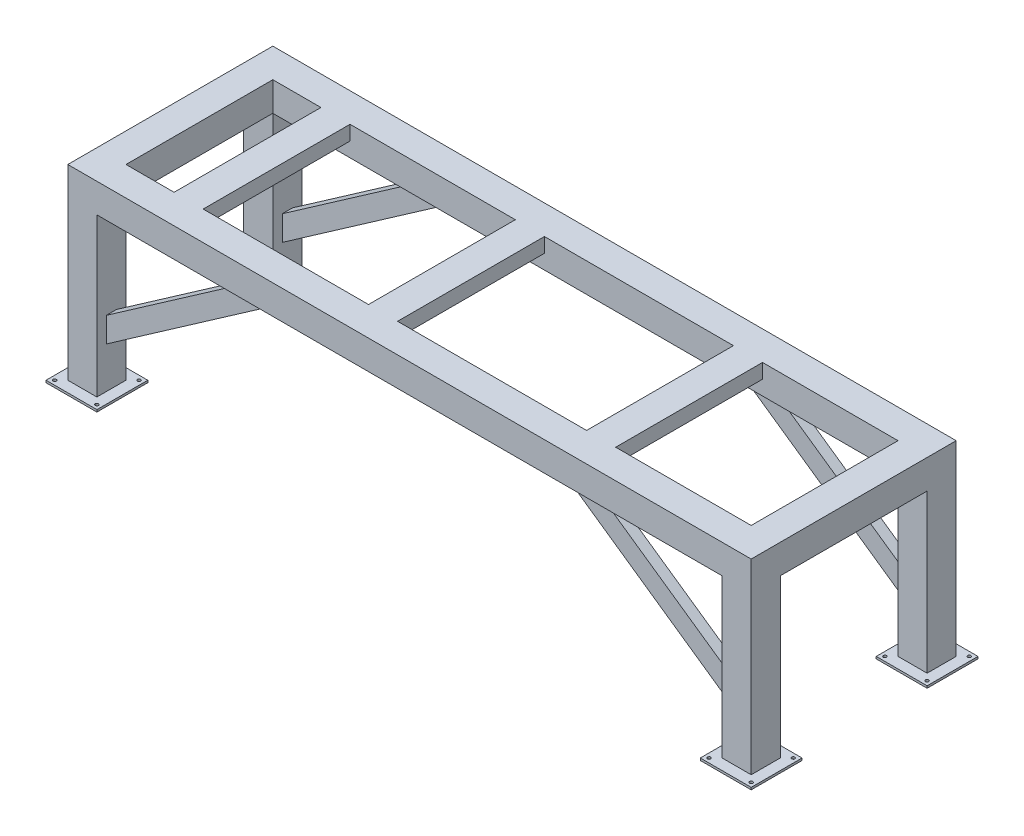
ISO-10303-21;
HEADER;
FILE_DESCRIPTION(('STEP AP214'),'2;1');
FILE_NAME('part.step','',(''),(''),'','','');
FILE_SCHEMA(('AUTOMOTIVE_DESIGN { 1 0 10303 214 1 1 1 1 }'));
ENDSEC;
DATA;
#1=APPLICATION_CONTEXT('core data for automotive mechanical design processes');
#2=APPLICATION_PROTOCOL_DEFINITION('international standard','automotive_design',2000,#1);
#3=PRODUCT_CONTEXT('',#1,'mechanical');
#4=PRODUCT('Part','Part','',(#3));
#5=PRODUCT_RELATED_PRODUCT_CATEGORY('part','',(#4));
#6=PRODUCT_DEFINITION_FORMATION('','',#4);
#7=PRODUCT_DEFINITION_CONTEXT('part definition',#1,'design');
#8=PRODUCT_DEFINITION('design','',#6,#7);
#9=PRODUCT_DEFINITION_SHAPE('','',#8);
#10=(LENGTH_UNIT() NAMED_UNIT(*) SI_UNIT(.MILLI.,.METRE.));
#11=(NAMED_UNIT(*) PLANE_ANGLE_UNIT() SI_UNIT($,.RADIAN.));
#12=(NAMED_UNIT(*) SI_UNIT($,.STERADIAN.) SOLID_ANGLE_UNIT());
#13=UNCERTAINTY_MEASURE_WITH_UNIT(LENGTH_MEASURE(1.E-05),#10,'distance_accuracy_value','');
#14=(GEOMETRIC_REPRESENTATION_CONTEXT(3) GLOBAL_UNCERTAINTY_ASSIGNED_CONTEXT((#13)) GLOBAL_UNIT_ASSIGNED_CONTEXT((#10,
#11,#12)) REPRESENTATION_CONTEXT('',''));
#15=CARTESIAN_POINT('',(0.,0.,0.));
#16=DIRECTION('',(0.,0.,1.));
#17=DIRECTION('',(1.,0.,0.));
#18=AXIS2_PLACEMENT_3D('',#15,#16,#17);
#19=CARTESIAN_POINT('',(-2150.,200.,505.));
#20=DIRECTION('',(0.,0.,-1.));
#21=DIRECTION('',(-1.,0.,0.));
#22=AXIS2_PLACEMENT_3D('',#19,#20,#21);
#23=PLANE('',#22);
#24=DIRECTION('',(1.,0.,0.));
#25=VECTOR('',#24,1.);
#26=CARTESIAN_POINT('',(-292.,100.,505.));
#27=LINE('',#26,#25);
#28=CARTESIAN_POINT('',(-292.,100.,505.));
#29=VERTEX_POINT('',#28);
#30=CARTESIAN_POINT('',(-282.,100.,505.));
#31=VERTEX_POINT('',#30);
#32=EDGE_CURVE('E712',#29,#31,#27,.T.);
#33=ORIENTED_EDGE('',*,*,#32,.T.);
#34=DIRECTION('',(0.,1.,0.));
#35=VECTOR('',#34,1.);
#36=CARTESIAN_POINT('',(-282.,100.,505.));
#37=LINE('',#36,#35);
#38=CARTESIAN_POINT('',(-282.,200.,505.));
#39=VERTEX_POINT('',#38);
#40=EDGE_CURVE('E698',#31,#39,#37,.T.);
#41=ORIENTED_EDGE('',*,*,#40,.T.);
#42=DIRECTION('',(1.,0.,0.));
#43=VECTOR('',#42,1.);
#44=CARTESIAN_POINT('',(-2150.,200.,505.));
#45=LINE('',#44,#43);
#46=CARTESIAN_POINT('',(1018.,200.,505.));
#47=VERTEX_POINT('',#46);
#48=EDGE_CURVE('E1456',#39,#47,#45,.T.);
#49=ORIENTED_EDGE('',*,*,#48,.T.);
#50=DIRECTION('',(0.,-1.,0.));
#51=VECTOR('',#50,1.);
#52=CARTESIAN_POINT('',(1018.,100.,505.));
#53=LINE('',#52,#51);
#54=CARTESIAN_POINT('',(1018.,100.,505.));
#55=VERTEX_POINT('',#54);
#56=EDGE_CURVE('E1393',#47,#55,#53,.T.);
#57=ORIENTED_EDGE('',*,*,#56,.T.);
#58=DIRECTION('',(1.,0.,0.));
#59=VECTOR('',#58,1.);
#60=CARTESIAN_POINT('',(1028.,100.,505.));
#61=LINE('',#60,#59);
#62=CARTESIAN_POINT('',(1028.,100.,505.));
#63=VERTEX_POINT('',#62);
#64=EDGE_CURVE('E1397',#55,#63,#61,.T.);
#65=ORIENTED_EDGE('',*,*,#64,.T.);
#66=DIRECTION('',(0.,1.,0.));
#67=VECTOR('',#66,1.);
#68=CARTESIAN_POINT('',(1028.,100.,505.));
#69=LINE('',#68,#67);
#70=CARTESIAN_POINT('',(1028.,190.,505.));
#71=VERTEX_POINT('',#70);
#72=EDGE_CURVE('E1400',#63,#71,#69,.T.);
#73=ORIENTED_EDGE('',*,*,#72,.T.);
#74=DIRECTION('',(1.,0.,0.));
#75=VECTOR('',#74,1.);
#76=CARTESIAN_POINT('',(1028.,190.,505.));
#77=LINE('',#76,#75);
#78=CARTESIAN_POINT('',(1208.,190.,505.));
#79=VERTEX_POINT('',#78);
#80=EDGE_CURVE('E1403',#71,#79,#77,.T.);
#81=ORIENTED_EDGE('',*,*,#80,.T.);
#82=DIRECTION('',(0.,-1.,0.));
#83=VECTOR('',#82,1.);
#84=CARTESIAN_POINT('',(1208.,100.,505.));
#85=LINE('',#84,#83);
#86=CARTESIAN_POINT('',(1208.,100.,505.));
#87=VERTEX_POINT('',#86);
#88=EDGE_CURVE('E1406',#79,#87,#85,.T.);
#89=ORIENTED_EDGE('',*,*,#88,.T.);
#90=DIRECTION('',(1.,0.,0.));
#91=VECTOR('',#90,1.);
#92=CARTESIAN_POINT('',(1208.,100.,505.));
#93=LINE('',#92,#91);
#94=CARTESIAN_POINT('',(1218.,100.,505.));
#95=VERTEX_POINT('',#94);
#96=EDGE_CURVE('E1409',#87,#95,#93,.T.);
#97=ORIENTED_EDGE('',*,*,#96,.T.);
#98=DIRECTION('',(0.,1.,0.));
#99=VECTOR('',#98,1.);
#100=CARTESIAN_POINT('',(1218.,100.,505.));
#101=LINE('',#100,#99);
#102=CARTESIAN_POINT('',(1218.,200.,505.));
#103=VERTEX_POINT('',#102);
#104=EDGE_CURVE('E1390',#95,#103,#101,.T.);
#105=ORIENTED_EDGE('',*,*,#104,.T.);
#106=CARTESIAN_POINT('',(2150.,200.,505.));
#107=VERTEX_POINT('',#106);
#108=EDGE_CURVE('E1450',#103,#107,#45,.T.);
#109=ORIENTED_EDGE('',*,*,#108,.T.);
#110=DIRECTION('',(0.,-1.,0.));
#111=VECTOR('',#110,1.);
#112=CARTESIAN_POINT('',(2150.,200.,505.));
#113=LINE('',#112,#111);
#114=CARTESIAN_POINT('',(2150.,0.,505.));
#115=VERTEX_POINT('',#114);
#116=EDGE_CURVE('E1480',#107,#115,#113,.T.);
#117=ORIENTED_EDGE('',*,*,#116,.T.);
#118=DIRECTION('',(1.,0.,0.));
#119=VECTOR('',#118,1.);
#120=CARTESIAN_POINT('',(-2150.,0.,505.));
#121=LINE('',#120,#119);
#122=CARTESIAN_POINT('',(-2150.,0.,505.));
#123=VERTEX_POINT('',#122);
#124=EDGE_CURVE('E1468',#123,#115,#121,.T.);
#125=ORIENTED_EDGE('',*,*,#124,.F.);
#126=DIRECTION('',(0.,-1.,0.));
#127=VECTOR('',#126,1.);
#128=CARTESIAN_POINT('',(-2150.,200.,505.));
#129=LINE('',#128,#127);
#130=CARTESIAN_POINT('',(-2150.,200.,505.));
#131=VERTEX_POINT('',#130);
#132=EDGE_CURVE('E1483',#131,#123,#129,.T.);
#133=ORIENTED_EDGE('',*,*,#132,.F.);
#134=CARTESIAN_POINT('',(-1819.,200.,505.));
#135=VERTEX_POINT('',#134);
#136=EDGE_CURVE('E1452',#131,#135,#45,.T.);
#137=ORIENTED_EDGE('',*,*,#136,.T.);
#138=DIRECTION('',(0.,-1.,0.));
#139=VECTOR('',#138,1.);
#140=CARTESIAN_POINT('',(-1819.,100.,505.));
#141=LINE('',#140,#139);
#142=CARTESIAN_POINT('',(-1819.,100.,505.));
#143=VERTEX_POINT('',#142);
#144=EDGE_CURVE('E1333',#135,#143,#141,.T.);
#145=ORIENTED_EDGE('',*,*,#144,.T.);
#146=DIRECTION('',(1.,0.,0.));
#147=VECTOR('',#146,1.);
#148=CARTESIAN_POINT('',(-1809.,100.,505.));
#149=LINE('',#148,#147);
#150=CARTESIAN_POINT('',(-1809.,100.,505.));
#151=VERTEX_POINT('',#150);
#152=EDGE_CURVE('E1336',#143,#151,#149,.T.);
#153=ORIENTED_EDGE('',*,*,#152,.T.);
#154=DIRECTION('',(0.,1.,0.));
#155=VECTOR('',#154,1.);
#156=CARTESIAN_POINT('',(-1809.,100.,505.));
#157=LINE('',#156,#155);
#158=CARTESIAN_POINT('',(-1809.,190.,505.));
#159=VERTEX_POINT('',#158);
#160=EDGE_CURVE('E1338',#151,#159,#157,.T.);
#161=ORIENTED_EDGE('',*,*,#160,.T.);
#162=DIRECTION('',(1.,0.,0.));
#163=VECTOR('',#162,1.);
#164=CARTESIAN_POINT('',(-1809.,190.,505.));
#165=LINE('',#164,#163);
#166=CARTESIAN_POINT('',(-1629.,190.,505.));
#167=VERTEX_POINT('',#166);
#168=EDGE_CURVE('E1340',#159,#167,#165,.T.);
#169=ORIENTED_EDGE('',*,*,#168,.T.);
#170=DIRECTION('',(0.,-1.,0.));
#171=VECTOR('',#170,1.);
#172=CARTESIAN_POINT('',(-1629.,100.,505.));
#173=LINE('',#172,#171);
#174=CARTESIAN_POINT('',(-1629.,100.,505.));
#175=VERTEX_POINT('',#174);
#176=EDGE_CURVE('E1342',#167,#175,#173,.T.);
#177=ORIENTED_EDGE('',*,*,#176,.T.);
#178=DIRECTION('',(1.,0.,0.));
#179=VECTOR('',#178,1.);
#180=CARTESIAN_POINT('',(-1629.,100.,505.));
#181=LINE('',#180,#179);
#182=CARTESIAN_POINT('',(-1619.,100.,505.));
#183=VERTEX_POINT('',#182);
#184=EDGE_CURVE('E1344',#175,#183,#181,.T.);
#185=ORIENTED_EDGE('',*,*,#184,.T.);
#186=DIRECTION('',(0.,1.,0.));
#187=VECTOR('',#186,1.);
#188=CARTESIAN_POINT('',(-1619.,100.,505.));
#189=LINE('',#188,#187);
#190=CARTESIAN_POINT('',(-1619.,200.,505.));
#191=VERTEX_POINT('',#190);
#192=EDGE_CURVE('E1330',#183,#191,#189,.T.);
#193=ORIENTED_EDGE('',*,*,#192,.T.);
#194=CARTESIAN_POINT('',(-482.,200.,505.));
#195=VERTEX_POINT('',#194);
#196=EDGE_CURVE('E1455',#191,#195,#45,.T.);
#197=ORIENTED_EDGE('',*,*,#196,.T.);
#198=DIRECTION('',(0.,-1.,0.));
#199=VECTOR('',#198,1.);
#200=CARTESIAN_POINT('',(-482.,100.,505.));
#201=LINE('',#200,#199);
#202=CARTESIAN_POINT('',(-482.,100.,505.));
#203=VERTEX_POINT('',#202);
#204=EDGE_CURVE('E701',#195,#203,#201,.T.);
#205=ORIENTED_EDGE('',*,*,#204,.T.);
#206=DIRECTION('',(1.,0.,0.));
#207=VECTOR('',#206,1.);
#208=CARTESIAN_POINT('',(-472.,100.,505.));
#209=LINE('',#208,#207);
#210=CARTESIAN_POINT('',(-472.,100.,505.));
#211=VERTEX_POINT('',#210);
#212=EDGE_CURVE('E704',#203,#211,#209,.T.);
#213=ORIENTED_EDGE('',*,*,#212,.T.);
#214=DIRECTION('',(0.,1.,0.));
#215=VECTOR('',#214,1.);
#216=CARTESIAN_POINT('',(-472.,100.,505.));
#217=LINE('',#216,#215);
#218=CARTESIAN_POINT('',(-472.,190.,505.));
#219=VERTEX_POINT('',#218);
#220=EDGE_CURVE('E706',#211,#219,#217,.T.);
#221=ORIENTED_EDGE('',*,*,#220,.T.);
#222=DIRECTION('',(1.,0.,0.));
#223=VECTOR('',#222,1.);
#224=CARTESIAN_POINT('',(-472.,190.,505.));
#225=LINE('',#224,#223);
#226=CARTESIAN_POINT('',(-292.,190.,505.));
#227=VERTEX_POINT('',#226);
#228=EDGE_CURVE('E708',#219,#227,#225,.T.);
#229=ORIENTED_EDGE('',*,*,#228,.T.);
#230=DIRECTION('',(0.,-1.,0.));
#231=VECTOR('',#230,1.);
#232=CARTESIAN_POINT('',(-292.,100.,505.));
#233=LINE('',#232,#231);
#234=EDGE_CURVE('E710',#227,#29,#233,.T.);
#235=ORIENTED_EDGE('',*,*,#234,.T.);
#236=EDGE_LOOP('',(#33,#41,#49,#57,#65,#73,#81,#89,#97,#105,#109,#117,#125,#133,#137,#145,#153,
#161,#169,#177,#185,#193,#197,#205,#213,#221,#229,#235));
#237=FACE_BOUND('',#236,.T.);
#238=ADVANCED_FACE('F34',(#237),#23,.T.);
#239=CARTESIAN_POINT('',(-2150.,200.,-505.));
#240=DIRECTION('',(0.,0.,1.));
#241=DIRECTION('',(1.,0.,0.));
#242=AXIS2_PLACEMENT_3D('',#239,#240,#241);
#243=PLANE('',#242);
#244=DIRECTION('',(-1.,0.,0.));
#245=VECTOR('',#244,1.);
#246=CARTESIAN_POINT('',(-2150.,200.,-505.));
#247=LINE('',#246,#245);
#248=CARTESIAN_POINT('',(1018.,200.,-505.));
#249=VERTEX_POINT('',#248);
#250=CARTESIAN_POINT('',(-282.,200.,-505.));
#251=VERTEX_POINT('',#250);
#252=EDGE_CURVE('E1464',#249,#251,#247,.T.);
#253=ORIENTED_EDGE('',*,*,#252,.T.);
#254=DIRECTION('',(0.,1.,0.));
#255=VECTOR('',#254,1.);
#256=CARTESIAN_POINT('',(-282.,100.,-505.));
#257=LINE('',#256,#255);
#258=CARTESIAN_POINT('',(-282.,100.,-505.));
#259=VERTEX_POINT('',#258);
#260=EDGE_CURVE('E697',#259,#251,#257,.T.);
#261=ORIENTED_EDGE('',*,*,#260,.F.);
#262=DIRECTION('',(1.,0.,0.));
#263=VECTOR('',#262,1.);
#264=CARTESIAN_POINT('',(-292.,100.,-505.));
#265=LINE('',#264,#263);
#266=CARTESIAN_POINT('',(-292.,100.,-505.));
#267=VERTEX_POINT('',#266);
#268=EDGE_CURVE('E702',#267,#259,#265,.T.);
#269=ORIENTED_EDGE('',*,*,#268,.F.);
#270=DIRECTION('',(0.,-1.,0.));
#271=VECTOR('',#270,1.);
#272=CARTESIAN_POINT('',(-292.,100.,-505.));
#273=LINE('',#272,#271);
#274=CARTESIAN_POINT('',(-292.,190.,-505.));
#275=VERTEX_POINT('',#274);
#276=EDGE_CURVE('E729',#275,#267,#273,.T.);
#277=ORIENTED_EDGE('',*,*,#276,.F.);
#278=DIRECTION('',(1.,0.,0.));
#279=VECTOR('',#278,1.);
#280=CARTESIAN_POINT('',(-472.,190.,-505.));
#281=LINE('',#280,#279);
#282=CARTESIAN_POINT('',(-472.,190.,-505.));
#283=VERTEX_POINT('',#282);
#284=EDGE_CURVE('E726',#283,#275,#281,.T.);
#285=ORIENTED_EDGE('',*,*,#284,.F.);
#286=DIRECTION('',(0.,1.,0.));
#287=VECTOR('',#286,1.);
#288=CARTESIAN_POINT('',(-472.,100.,-505.));
#289=LINE('',#288,#287);
#290=CARTESIAN_POINT('',(-472.,100.,-505.));
#291=VERTEX_POINT('',#290);
#292=EDGE_CURVE('E723',#291,#283,#289,.T.);
#293=ORIENTED_EDGE('',*,*,#292,.F.);
#294=DIRECTION('',(1.,0.,0.));
#295=VECTOR('',#294,1.);
#296=CARTESIAN_POINT('',(-472.,100.,-505.));
#297=LINE('',#296,#295);
#298=CARTESIAN_POINT('',(-482.,100.,-505.));
#299=VERTEX_POINT('',#298);
#300=EDGE_CURVE('E720',#299,#291,#297,.T.);
#301=ORIENTED_EDGE('',*,*,#300,.F.);
#302=DIRECTION('',(0.,-1.,0.));
#303=VECTOR('',#302,1.);
#304=CARTESIAN_POINT('',(-482.,100.,-505.));
#305=LINE('',#304,#303);
#306=CARTESIAN_POINT('',(-482.,200.,-505.));
#307=VERTEX_POINT('',#306);
#308=EDGE_CURVE('E717',#307,#299,#305,.T.);
#309=ORIENTED_EDGE('',*,*,#308,.F.);
#310=CARTESIAN_POINT('',(-1619.,200.,-505.));
#311=VERTEX_POINT('',#310);
#312=EDGE_CURVE('E1465',#307,#311,#247,.T.);
#313=ORIENTED_EDGE('',*,*,#312,.T.);
#314=DIRECTION('',(0.,1.,0.));
#315=VECTOR('',#314,1.);
#316=CARTESIAN_POINT('',(-1619.,100.,-505.));
#317=LINE('',#316,#315);
#318=CARTESIAN_POINT('',(-1619.,100.,-505.));
#319=VERTEX_POINT('',#318);
#320=EDGE_CURVE('E1324',#319,#311,#317,.T.);
#321=ORIENTED_EDGE('',*,*,#320,.F.);
#322=DIRECTION('',(1.,0.,0.));
#323=VECTOR('',#322,1.);
#324=CARTESIAN_POINT('',(-1629.,100.,-505.));
#325=LINE('',#324,#323);
#326=CARTESIAN_POINT('',(-1629.,100.,-505.));
#327=VERTEX_POINT('',#326);
#328=EDGE_CURVE('E1334',#327,#319,#325,.T.);
#329=ORIENTED_EDGE('',*,*,#328,.F.);
#330=DIRECTION('',(0.,-1.,0.));
#331=VECTOR('',#330,1.);
#332=CARTESIAN_POINT('',(-1629.,100.,-505.));
#333=LINE('',#332,#331);
#334=CARTESIAN_POINT('',(-1629.,190.,-505.));
#335=VERTEX_POINT('',#334);
#336=EDGE_CURVE('E1361',#335,#327,#333,.T.);
#337=ORIENTED_EDGE('',*,*,#336,.F.);
#338=DIRECTION('',(1.,0.,0.));
#339=VECTOR('',#338,1.);
#340=CARTESIAN_POINT('',(-1809.,190.,-505.));
#341=LINE('',#340,#339);
#342=CARTESIAN_POINT('',(-1809.,190.,-505.));
#343=VERTEX_POINT('',#342);
#344=EDGE_CURVE('E1358',#343,#335,#341,.T.);
#345=ORIENTED_EDGE('',*,*,#344,.F.);
#346=DIRECTION('',(0.,1.,0.));
#347=VECTOR('',#346,1.);
#348=CARTESIAN_POINT('',(-1809.,100.,-505.));
#349=LINE('',#348,#347);
#350=CARTESIAN_POINT('',(-1809.,100.,-505.));
#351=VERTEX_POINT('',#350);
#352=EDGE_CURVE('E1355',#351,#343,#349,.T.);
#353=ORIENTED_EDGE('',*,*,#352,.F.);
#354=DIRECTION('',(1.,0.,0.));
#355=VECTOR('',#354,1.);
#356=CARTESIAN_POINT('',(-1809.,100.,-505.));
#357=LINE('',#356,#355);
#358=CARTESIAN_POINT('',(-1819.,100.,-505.));
#359=VERTEX_POINT('',#358);
#360=EDGE_CURVE('E1352',#359,#351,#357,.T.);
#361=ORIENTED_EDGE('',*,*,#360,.F.);
#362=DIRECTION('',(0.,-1.,0.));
#363=VECTOR('',#362,1.);
#364=CARTESIAN_POINT('',(-1819.,100.,-505.));
#365=LINE('',#364,#363);
#366=CARTESIAN_POINT('',(-1819.,200.,-505.));
#367=VERTEX_POINT('',#366);
#368=EDGE_CURVE('E1349',#367,#359,#365,.T.);
#369=ORIENTED_EDGE('',*,*,#368,.F.);
#370=CARTESIAN_POINT('',(-2150.,200.,-505.));
#371=VERTEX_POINT('',#370);
#372=EDGE_CURVE('E1459',#367,#371,#247,.T.);
#373=ORIENTED_EDGE('',*,*,#372,.T.);
#374=DIRECTION('',(0.,-1.,0.));
#375=VECTOR('',#374,1.);
#376=CARTESIAN_POINT('',(-2150.,200.,-505.));
#377=LINE('',#376,#375);
#378=CARTESIAN_POINT('',(-2150.,0.,-505.));
#379=VERTEX_POINT('',#378);
#380=EDGE_CURVE('E1463',#371,#379,#377,.T.);
#381=ORIENTED_EDGE('',*,*,#380,.T.);
#382=DIRECTION('',(-1.,0.,0.));
#383=VECTOR('',#382,1.);
#384=CARTESIAN_POINT('',(-2150.,0.,-505.));
#385=LINE('',#384,#383);
#386=CARTESIAN_POINT('',(2150.,0.,-505.));
#387=VERTEX_POINT('',#386);
#388=EDGE_CURVE('E1451',#387,#379,#385,.T.);
#389=ORIENTED_EDGE('',*,*,#388,.F.);
#390=DIRECTION('',(0.,-1.,0.));
#391=VECTOR('',#390,1.);
#392=CARTESIAN_POINT('',(2150.,200.,-505.));
#393=LINE('',#392,#391);
#394=CARTESIAN_POINT('',(2150.,200.,-505.));
#395=VERTEX_POINT('',#394);
#396=EDGE_CURVE('E1477',#395,#387,#393,.T.);
#397=ORIENTED_EDGE('',*,*,#396,.F.);
#398=CARTESIAN_POINT('',(1218.,200.,-505.));
#399=VERTEX_POINT('',#398);
#400=EDGE_CURVE('E1460',#395,#399,#247,.T.);
#401=ORIENTED_EDGE('',*,*,#400,.T.);
#402=DIRECTION('',(0.,1.,0.));
#403=VECTOR('',#402,1.);
#404=CARTESIAN_POINT('',(1218.,100.,-505.));
#405=LINE('',#404,#403);
#406=CARTESIAN_POINT('',(1218.,100.,-505.));
#407=VERTEX_POINT('',#406);
#408=EDGE_CURVE('E1389',#407,#399,#405,.T.);
#409=ORIENTED_EDGE('',*,*,#408,.F.);
#410=DIRECTION('',(1.,0.,0.));
#411=VECTOR('',#410,1.);
#412=CARTESIAN_POINT('',(1208.,100.,-505.));
#413=LINE('',#412,#411);
#414=CARTESIAN_POINT('',(1208.,100.,-505.));
#415=VERTEX_POINT('',#414);
#416=EDGE_CURVE('E1394',#415,#407,#413,.T.);
#417=ORIENTED_EDGE('',*,*,#416,.F.);
#418=DIRECTION('',(0.,-1.,0.));
#419=VECTOR('',#418,1.);
#420=CARTESIAN_POINT('',(1208.,100.,-505.));
#421=LINE('',#420,#419);
#422=CARTESIAN_POINT('',(1208.,190.,-505.));
#423=VERTEX_POINT('',#422);
#424=EDGE_CURVE('E1423',#423,#415,#421,.T.);
#425=ORIENTED_EDGE('',*,*,#424,.F.);
#426=DIRECTION('',(1.,0.,0.));
#427=VECTOR('',#426,1.);
#428=CARTESIAN_POINT('',(1028.,190.,-505.));
#429=LINE('',#428,#427);
#430=CARTESIAN_POINT('',(1028.,190.,-505.));
#431=VERTEX_POINT('',#430);
#432=EDGE_CURVE('E1421',#431,#423,#429,.T.);
#433=ORIENTED_EDGE('',*,*,#432,.F.);
#434=DIRECTION('',(0.,1.,0.));
#435=VECTOR('',#434,1.);
#436=CARTESIAN_POINT('',(1028.,100.,-505.));
#437=LINE('',#436,#435);
#438=CARTESIAN_POINT('',(1028.,100.,-505.));
#439=VERTEX_POINT('',#438);
#440=EDGE_CURVE('E1419',#439,#431,#437,.T.);
#441=ORIENTED_EDGE('',*,*,#440,.F.);
#442=DIRECTION('',(1.,0.,0.));
#443=VECTOR('',#442,1.);
#444=CARTESIAN_POINT('',(1028.,100.,-505.));
#445=LINE('',#444,#443);
#446=CARTESIAN_POINT('',(1018.,100.,-505.));
#447=VERTEX_POINT('',#446);
#448=EDGE_CURVE('E1417',#447,#439,#445,.T.);
#449=ORIENTED_EDGE('',*,*,#448,.F.);
#450=DIRECTION('',(0.,-1.,0.));
#451=VECTOR('',#450,1.);
#452=CARTESIAN_POINT('',(1018.,100.,-505.));
#453=LINE('',#452,#451);
#454=EDGE_CURVE('E1415',#249,#447,#453,.T.);
#455=ORIENTED_EDGE('',*,*,#454,.F.);
#456=EDGE_LOOP('',(#253,#261,#269,#277,#285,#293,#301,#309,#313,#321,#329,#337,#345,#353,#361,
#369,#373,#381,#389,#397,#401,#409,#417,#425,#433,#441,#449,#455));
#457=FACE_BOUND('',#456,.T.);
#458=ADVANCED_FACE('F1540',(#457),#243,.T.);
#459=CARTESIAN_POINT('',(0.,0.,0.));
#460=DIRECTION('',(0.,-1.,0.));
#461=DIRECTION('',(0.,0.,-1.));
#462=AXIS2_PLACEMENT_3D('',#459,#460,#461);
#463=PLANE('',#462);
#464=DIRECTION('',(-1.,0.,0.));
#465=VECTOR('',#464,1.);
#466=CARTESIAN_POINT('',(-1000.,0.,640.));
#467=LINE('',#466,#465);
#468=CARTESIAN_POINT('',(-1000.,0.,640.));
#469=VERTEX_POINT('',#468);
#470=CARTESIAN_POINT('',(-1244.82011353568,0.,640.));
#471=VERTEX_POINT('',#470);
#472=EDGE_CURVE('E670',#469,#471,#467,.T.);
#473=ORIENTED_EDGE('',*,*,#472,.F.);
#474=DIRECTION('',(0.,0.,-1.));
#475=VECTOR('',#474,1.);
#476=CARTESIAN_POINT('',(-1000.,0.,640.));
#477=LINE('',#476,#475);
#478=CARTESIAN_POINT('',(-1000.,0.,570.));
#479=VERTEX_POINT('',#478);
#480=EDGE_CURVE('E681',#469,#479,#477,.T.);
#481=ORIENTED_EDGE('',*,*,#480,.T.);
#482=DIRECTION('',(-1.,0.,0.));
#483=VECTOR('',#482,1.);
#484=CARTESIAN_POINT('',(-1000.,0.,570.));
#485=LINE('',#484,#483);
#486=CARTESIAN_POINT('',(-1244.82011353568,0.,570.));
#487=VERTEX_POINT('',#486);
#488=EDGE_CURVE('E661',#479,#487,#485,.T.);
#489=ORIENTED_EDGE('',*,*,#488,.T.);
#490=DIRECTION('',(0.,0.,-1.));
#491=VECTOR('',#490,1.);
#492=CARTESIAN_POINT('',(-1244.82011353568,0.,640.));
#493=LINE('',#492,#491);
#494=EDGE_CURVE('E695',#471,#487,#493,.T.);
#495=ORIENTED_EDGE('',*,*,#494,.F.);
#496=EDGE_LOOP('',(#473,#481,#489,#495));
#497=FACE_BOUND('',#496,.T.);
#498=DIRECTION('',(1.,0.,0.));
#499=VECTOR('',#498,1.);
#500=CARTESIAN_POINT('',(1000.,0.,640.));
#501=LINE('',#500,#499);
#502=CARTESIAN_POINT('',(1000.,0.,640.));
#503=VERTEX_POINT('',#502);
#504=CARTESIAN_POINT('',(1244.82011353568,0.,640.));
#505=VERTEX_POINT('',#504);
#506=EDGE_CURVE('E758',#503,#505,#501,.T.);
#507=ORIENTED_EDGE('',*,*,#506,.T.);
#508=DIRECTION('',(0.,0.,-1.));
#509=VECTOR('',#508,1.);
#510=CARTESIAN_POINT('',(1244.82011353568,0.,640.));
#511=LINE('',#510,#509);
#512=CARTESIAN_POINT('',(1244.82011353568,0.,570.));
#513=VERTEX_POINT('',#512);
#514=EDGE_CURVE('E770',#505,#513,#511,.T.);
#515=ORIENTED_EDGE('',*,*,#514,.T.);
#516=DIRECTION('',(1.,0.,0.));
#517=VECTOR('',#516,1.);
#518=CARTESIAN_POINT('',(1000.,0.,570.));
#519=LINE('',#518,#517);
#520=CARTESIAN_POINT('',(1000.,0.,570.));
#521=VERTEX_POINT('',#520);
#522=EDGE_CURVE('E757',#521,#513,#519,.T.);
#523=ORIENTED_EDGE('',*,*,#522,.F.);
#524=DIRECTION('',(0.,0.,-1.));
#525=VECTOR('',#524,1.);
#526=CARTESIAN_POINT('',(1000.,0.,640.));
#527=LINE('',#526,#525);
#528=EDGE_CURVE('E786',#503,#521,#527,.T.);
#529=ORIENTED_EDGE('',*,*,#528,.F.);
#530=EDGE_LOOP('',(#507,#515,#523,#529));
#531=FACE_BOUND('',#530,.T.);
#532=DIRECTION('',(1.,0.,0.));
#533=VECTOR('',#532,1.);
#534=CARTESIAN_POINT('',(-2350.,0.,705.));
#535=LINE('',#534,#533);
#536=CARTESIAN_POINT('',(-2150.,0.,705.));
#537=VERTEX_POINT('',#536);
#538=CARTESIAN_POINT('',(2150.,0.,705.));
#539=VERTEX_POINT('',#538);
#540=EDGE_CURVE('E1491',#537,#539,#535,.T.);
#541=ORIENTED_EDGE('',*,*,#540,.F.);
#542=DIRECTION('',(0.,0.,1.));
#543=VECTOR('',#542,1.);
#544=CARTESIAN_POINT('',(-2150.,0.,505.));
#545=LINE('',#544,#543);
#546=EDGE_CURVE('E1014',#123,#537,#545,.T.);
#547=ORIENTED_EDGE('',*,*,#546,.F.);
#548=ORIENTED_EDGE('',*,*,#124,.T.);
#549=DIRECTION('',(0.,0.,-1.));
#550=VECTOR('',#549,1.);
#551=CARTESIAN_POINT('',(2150.,0.,505.));
#552=LINE('',#551,#550);
#553=EDGE_CURVE('E1126',#539,#115,#552,.T.);
#554=ORIENTED_EDGE('',*,*,#553,.F.);
#555=EDGE_LOOP('',(#541,#547,#548,#554));
#556=FACE_BOUND('',#555,.T.);
#557=ADVANCED_FACE('F1574',(#497,#531,#556),#463,.T.);
#558=DIRECTION('',(0.,0.,1.));
#559=VECTOR('',#558,1.);
#560=CARTESIAN_POINT('',(-2150.,0.,505.));
#561=LINE('',#560,#559);
#562=EDGE_CURVE('E1447',#379,#123,#561,.T.);
#563=ORIENTED_EDGE('',*,*,#562,.T.);
#564=DIRECTION('',(1.,0.,0.));
#565=VECTOR('',#564,1.);
#566=CARTESIAN_POINT('',(-2150.,0.,505.));
#567=LINE('',#566,#565);
#568=CARTESIAN_POINT('',(-2350.,0.,505.));
#569=VERTEX_POINT('',#568);
#570=EDGE_CURVE('E1019',#569,#123,#567,.T.);
#571=ORIENTED_EDGE('',*,*,#570,.F.);
#572=DIRECTION('',(0.,0.,1.));
#573=VECTOR('',#572,1.);
#574=CARTESIAN_POINT('',(-2350.,0.,705.));
#575=LINE('',#574,#573);
#576=CARTESIAN_POINT('',(-2350.,0.,-505.));
#577=VERTEX_POINT('',#576);
#578=EDGE_CURVE('E1502',#577,#569,#575,.T.);
#579=ORIENTED_EDGE('',*,*,#578,.F.);
#580=DIRECTION('',(-1.,0.,0.));
#581=VECTOR('',#580,1.);
#582=CARTESIAN_POINT('',(-2150.,0.,-505.));
#583=LINE('',#582,#581);
#584=EDGE_CURVE('E1075',#379,#577,#583,.T.);
#585=ORIENTED_EDGE('',*,*,#584,.F.);
#586=EDGE_LOOP('',(#563,#571,#579,#585));
#587=FACE_BOUND('',#586,.T.);
#588=ADVANCED_FACE('F1531',(#587),#463,.T.);
#589=DIRECTION('',(-1.,0.,0.));
#590=VECTOR('',#589,1.);
#591=CARTESIAN_POINT('',(-1000.,0.,-640.));
#592=LINE('',#591,#590);
#593=CARTESIAN_POINT('',(-1000.,0.,-640.));
#594=VERTEX_POINT('',#593);
#595=CARTESIAN_POINT('',(-1244.82011353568,0.,-640.));
#596=VERTEX_POINT('',#595);
#597=EDGE_CURVE('E641',#594,#596,#592,.T.);
#598=ORIENTED_EDGE('',*,*,#597,.T.);
#599=DIRECTION('',(0.,0.,1.));
#600=VECTOR('',#599,1.);
#601=CARTESIAN_POINT('',(-1244.82011353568,0.,-640.));
#602=LINE('',#601,#600);
#603=CARTESIAN_POINT('',(-1244.82011353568,0.,-570.));
#604=VERTEX_POINT('',#603);
#605=EDGE_CURVE('E2858',#596,#604,#602,.T.);
#606=ORIENTED_EDGE('',*,*,#605,.T.);
#607=DIRECTION('',(-1.,0.,0.));
#608=VECTOR('',#607,1.);
#609=CARTESIAN_POINT('',(-1000.,0.,-570.));
#610=LINE('',#609,#608);
#611=CARTESIAN_POINT('',(-1000.,0.,-570.));
#612=VERTEX_POINT('',#611);
#613=EDGE_CURVE('E660',#612,#604,#610,.T.);
#614=ORIENTED_EDGE('',*,*,#613,.F.);
#615=DIRECTION('',(0.,0.,1.));
#616=VECTOR('',#615,1.);
#617=CARTESIAN_POINT('',(-1000.,0.,-640.));
#618=LINE('',#617,#616);
#619=EDGE_CURVE('E654',#594,#612,#618,.T.);
#620=ORIENTED_EDGE('',*,*,#619,.F.);
#621=EDGE_LOOP('',(#598,#606,#614,#620));
#622=FACE_BOUND('',#621,.T.);
#623=DIRECTION('',(1.,0.,0.));
#624=VECTOR('',#623,1.);
#625=CARTESIAN_POINT('',(1000.,0.,-640.));
#626=LINE('',#625,#624);
#627=CARTESIAN_POINT('',(1000.,0.,-640.));
#628=VERTEX_POINT('',#627);
#629=CARTESIAN_POINT('',(1244.82011353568,0.,-640.));
#630=VERTEX_POINT('',#629);
#631=EDGE_CURVE('E790',#628,#630,#626,.T.);
#632=ORIENTED_EDGE('',*,*,#631,.F.);
#633=DIRECTION('',(0.,0.,1.));
#634=VECTOR('',#633,1.);
#635=CARTESIAN_POINT('',(1000.,0.,-640.));
#636=LINE('',#635,#634);
#637=CARTESIAN_POINT('',(1000.,0.,-570.));
#638=VERTEX_POINT('',#637);
#639=EDGE_CURVE('E802',#628,#638,#636,.T.);
#640=ORIENTED_EDGE('',*,*,#639,.T.);
#641=DIRECTION('',(1.,0.,0.));
#642=VECTOR('',#641,1.);
#643=CARTESIAN_POINT('',(1000.,0.,-570.));
#644=LINE('',#643,#642);
#645=CARTESIAN_POINT('',(1244.82011353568,0.,-570.));
#646=VERTEX_POINT('',#645);
#647=EDGE_CURVE('E789',#638,#646,#644,.T.);
#648=ORIENTED_EDGE('',*,*,#647,.T.);
#649=DIRECTION('',(0.,0.,1.));
#650=VECTOR('',#649,1.);
#651=CARTESIAN_POINT('',(1244.82011353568,0.,-640.));
#652=LINE('',#651,#650);
#653=EDGE_CURVE('E818',#630,#646,#652,.T.);
#654=ORIENTED_EDGE('',*,*,#653,.F.);
#655=EDGE_LOOP('',(#632,#640,#648,#654));
#656=FACE_BOUND('',#655,.T.);
#657=ORIENTED_EDGE('',*,*,#388,.T.);
#658=DIRECTION('',(0.,0.,1.));
#659=VECTOR('',#658,1.);
#660=CARTESIAN_POINT('',(-2150.,0.,-705.));
#661=LINE('',#660,#659);
#662=CARTESIAN_POINT('',(-2150.,0.,-705.));
#663=VERTEX_POINT('',#662);
#664=EDGE_CURVE('E1070',#663,#379,#661,.T.);
#665=ORIENTED_EDGE('',*,*,#664,.F.);
#666=DIRECTION('',(-1.,0.,0.));
#667=VECTOR('',#666,1.);
#668=CARTESIAN_POINT('',(-2350.,0.,-705.));
#669=LINE('',#668,#667);
#670=CARTESIAN_POINT('',(2150.,0.,-705.));
#671=VERTEX_POINT('',#670);
#672=EDGE_CURVE('E1499',#671,#663,#669,.T.);
#673=ORIENTED_EDGE('',*,*,#672,.F.);
#674=DIRECTION('',(0.,0.,-1.));
#675=VECTOR('',#674,1.);
#676=CARTESIAN_POINT('',(2150.,0.,-705.));
#677=LINE('',#676,#675);
#678=EDGE_CURVE('E1243',#387,#671,#677,.T.);
#679=ORIENTED_EDGE('',*,*,#678,.F.);
#680=EDGE_LOOP('',(#657,#665,#673,#679));
#681=FACE_BOUND('',#680,.T.);
#682=ADVANCED_FACE('F658',(#622,#656,#681),#463,.T.);
#683=DIRECTION('',(0.,0.,-1.));
#684=VECTOR('',#683,1.);
#685=CARTESIAN_POINT('',(2350.,0.,705.));
#686=LINE('',#685,#684);
#687=CARTESIAN_POINT('',(2350.,0.,505.));
#688=VERTEX_POINT('',#687);
#689=CARTESIAN_POINT('',(2350.,0.,-505.));
#690=VERTEX_POINT('',#689);
#691=EDGE_CURVE('E1486',#688,#690,#686,.T.);
#692=ORIENTED_EDGE('',*,*,#691,.F.);
#693=DIRECTION('',(1.,0.,0.));
#694=VECTOR('',#693,1.);
#695=CARTESIAN_POINT('',(2350.,0.,505.));
#696=LINE('',#695,#694);
#697=EDGE_CURVE('E1131',#115,#688,#696,.T.);
#698=ORIENTED_EDGE('',*,*,#697,.F.);
#699=DIRECTION('',(0.,0.,-1.));
#700=VECTOR('',#699,1.);
#701=CARTESIAN_POINT('',(2150.,0.,505.));
#702=LINE('',#701,#700);
#703=EDGE_CURVE('E1471',#115,#387,#702,.T.);
#704=ORIENTED_EDGE('',*,*,#703,.T.);
#705=DIRECTION('',(-1.,0.,0.));
#706=VECTOR('',#705,1.);
#707=CARTESIAN_POINT('',(2350.,0.,-505.));
#708=LINE('',#707,#706);
#709=EDGE_CURVE('E1238',#690,#387,#708,.T.);
#710=ORIENTED_EDGE('',*,*,#709,.F.);
#711=EDGE_LOOP('',(#692,#698,#704,#710));
#712=FACE_BOUND('',#711,.T.);
#713=ADVANCED_FACE('F1560',(#712),#463,.T.);
#714=CARTESIAN_POINT('',(0.,200.,0.));
#715=DIRECTION('',(0.,-1.,0.));
#716=DIRECTION('',(0.,0.,-1.));
#717=AXIS2_PLACEMENT_3D('',#714,#715,#716);
#718=PLANE('',#717);
#719=DIRECTION('',(0.,0.,-1.));
#720=VECTOR('',#719,1.);
#721=CARTESIAN_POINT('',(-482.,200.,505.));
#722=LINE('',#721,#720);
#723=EDGE_CURVE('E751',#195,#307,#722,.T.);
#724=ORIENTED_EDGE('',*,*,#723,.F.);
#725=ORIENTED_EDGE('',*,*,#196,.F.);
#726=DIRECTION('',(0.,0.,-1.));
#727=VECTOR('',#726,1.);
#728=CARTESIAN_POINT('',(-1619.,200.,505.));
#729=LINE('',#728,#727);
#730=EDGE_CURVE('E1386',#191,#311,#729,.T.);
#731=ORIENTED_EDGE('',*,*,#730,.T.);
#732=ORIENTED_EDGE('',*,*,#312,.F.);
#733=EDGE_LOOP('',(#724,#725,#731,#732));
#734=FACE_BOUND('',#733,.T.);
#735=DIRECTION('',(0.,0.,-1.));
#736=VECTOR('',#735,1.);
#737=CARTESIAN_POINT('',(-1819.,200.,505.));
#738=LINE('',#737,#736);
#739=EDGE_CURVE('E1383',#135,#367,#738,.T.);
#740=ORIENTED_EDGE('',*,*,#739,.F.);
#741=ORIENTED_EDGE('',*,*,#136,.F.);
#742=DIRECTION('',(0.,0.,1.));
#743=VECTOR('',#742,1.);
#744=CARTESIAN_POINT('',(-2150.,200.,505.));
#745=LINE('',#744,#743);
#746=EDGE_CURVE('E1448',#371,#131,#745,.T.);
#747=ORIENTED_EDGE('',*,*,#746,.F.);
#748=ORIENTED_EDGE('',*,*,#372,.F.);
#749=EDGE_LOOP('',(#740,#741,#747,#748));
#750=FACE_BOUND('',#749,.T.);
#751=DIRECTION('',(0.,0.,-1.));
#752=VECTOR('',#751,1.);
#753=CARTESIAN_POINT('',(1018.,200.,505.));
#754=LINE('',#753,#752);
#755=EDGE_CURVE('E1443',#47,#249,#754,.T.);
#756=ORIENTED_EDGE('',*,*,#755,.F.);
#757=ORIENTED_EDGE('',*,*,#48,.F.);
#758=DIRECTION('',(0.,0.,-1.));
#759=VECTOR('',#758,1.);
#760=CARTESIAN_POINT('',(-282.,200.,505.));
#761=LINE('',#760,#759);
#762=EDGE_CURVE('E754',#39,#251,#761,.T.);
#763=ORIENTED_EDGE('',*,*,#762,.T.);
#764=ORIENTED_EDGE('',*,*,#252,.F.);
#765=EDGE_LOOP('',(#756,#757,#763,#764));
#766=FACE_BOUND('',#765,.T.);
#767=DIRECTION('',(0.,0.,-1.));
#768=VECTOR('',#767,1.);
#769=CARTESIAN_POINT('',(2350.,200.,705.));
#770=LINE('',#769,#768);
#771=CARTESIAN_POINT('',(2350.,200.,705.));
#772=VERTEX_POINT('',#771);
#773=CARTESIAN_POINT('',(2350.,200.,-705.));
#774=VERTEX_POINT('',#773);
#775=EDGE_CURVE('E1487',#772,#774,#770,.T.);
#776=ORIENTED_EDGE('',*,*,#775,.T.);
#777=DIRECTION('',(-1.,0.,0.));
#778=VECTOR('',#777,1.);
#779=CARTESIAN_POINT('',(-2350.,200.,-705.));
#780=LINE('',#779,#778);
#781=CARTESIAN_POINT('',(-2350.,200.,-705.));
#782=VERTEX_POINT('',#781);
#783=EDGE_CURVE('E1490',#774,#782,#780,.T.);
#784=ORIENTED_EDGE('',*,*,#783,.T.);
#785=DIRECTION('',(0.,0.,1.));
#786=VECTOR('',#785,1.);
#787=CARTESIAN_POINT('',(-2350.,200.,705.));
#788=LINE('',#787,#786);
#789=CARTESIAN_POINT('',(-2350.,200.,705.));
#790=VERTEX_POINT('',#789);
#791=EDGE_CURVE('E1493',#782,#790,#788,.T.);
#792=ORIENTED_EDGE('',*,*,#791,.T.);
#793=DIRECTION('',(1.,0.,0.));
#794=VECTOR('',#793,1.);
#795=CARTESIAN_POINT('',(-2350.,200.,705.));
#796=LINE('',#795,#794);
#797=EDGE_CURVE('E1495',#790,#772,#796,.T.);
#798=ORIENTED_EDGE('',*,*,#797,.T.);
#799=EDGE_LOOP('',(#776,#784,#792,#798));
#800=FACE_BOUND('',#799,.T.);
#801=ORIENTED_EDGE('',*,*,#108,.F.);
#802=DIRECTION('',(0.,0.,-1.));
#803=VECTOR('',#802,1.);
#804=CARTESIAN_POINT('',(1218.,200.,505.));
#805=LINE('',#804,#803);
#806=EDGE_CURVE('E1445',#103,#399,#805,.T.);
#807=ORIENTED_EDGE('',*,*,#806,.T.);
#808=ORIENTED_EDGE('',*,*,#400,.F.);
#809=DIRECTION('',(0.,0.,-1.));
#810=VECTOR('',#809,1.);
#811=CARTESIAN_POINT('',(2150.,200.,505.));
#812=LINE('',#811,#810);
#813=EDGE_CURVE('E1454',#107,#395,#812,.T.);
#814=ORIENTED_EDGE('',*,*,#813,.F.);
#815=EDGE_LOOP('',(#801,#807,#808,#814));
#816=FACE_BOUND('',#815,.T.);
#817=ADVANCED_FACE('F1592',(#734,#750,#766,#800,#816),#718,.F.);
#818=CARTESIAN_POINT('',(2350.,200.,705.));
#819=DIRECTION('',(-1.,0.,0.));
#820=DIRECTION('',(0.,0.,1.));
#821=AXIS2_PLACEMENT_3D('',#818,#819,#820);
#822=PLANE('',#821);
#823=DIRECTION('',(0.,-1.,0.));
#824=VECTOR('',#823,1.);
#825=CARTESIAN_POINT('',(2350.,200.,705.));
#826=LINE('',#825,#824);
#827=CARTESIAN_POINT('',(2350.,-1085.,705.));
#828=VERTEX_POINT('',#827);
#829=EDGE_CURVE('E1497',#772,#828,#826,.T.);
#830=ORIENTED_EDGE('',*,*,#829,.T.);
#831=DIRECTION('',(0.,0.,1.));
#832=VECTOR('',#831,1.);
#833=CARTESIAN_POINT('',(2350.,-1085.,505.));
#834=LINE('',#833,#832);
#835=CARTESIAN_POINT('',(2350.,-1085.,505.));
#836=VERTEX_POINT('',#835);
#837=EDGE_CURVE('E1127',#836,#828,#834,.T.);
#838=ORIENTED_EDGE('',*,*,#837,.F.);
#839=DIRECTION('',(0.,1.,0.));
#840=VECTOR('',#839,1.);
#841=CARTESIAN_POINT('',(2350.,-1085.,505.));
#842=LINE('',#841,#840);
#843=EDGE_CURVE('E1140',#836,#688,#842,.T.);
#844=ORIENTED_EDGE('',*,*,#843,.T.);
#845=ORIENTED_EDGE('',*,*,#691,.T.);
#846=DIRECTION('',(0.,1.,0.));
#847=VECTOR('',#846,1.);
#848=CARTESIAN_POINT('',(2350.,-1085.,-505.));
#849=LINE('',#848,#847);
#850=CARTESIAN_POINT('',(2350.,-1085.,-505.));
#851=VERTEX_POINT('',#850);
#852=EDGE_CURVE('E1262',#851,#690,#849,.T.);
#853=ORIENTED_EDGE('',*,*,#852,.F.);
#854=DIRECTION('',(0.,0.,1.));
#855=VECTOR('',#854,1.);
#856=CARTESIAN_POINT('',(2350.,-1085.,-705.));
#857=LINE('',#856,#855);
#858=CARTESIAN_POINT('',(2350.,-1085.,-705.));
#859=VERTEX_POINT('',#858);
#860=EDGE_CURVE('E1239',#859,#851,#857,.T.);
#861=ORIENTED_EDGE('',*,*,#860,.F.);
#862=DIRECTION('',(0.,-1.,0.));
#863=VECTOR('',#862,1.);
#864=CARTESIAN_POINT('',(2350.,200.,-705.));
#865=LINE('',#864,#863);
#866=EDGE_CURVE('E11',#774,#859,#865,.T.);
#867=ORIENTED_EDGE('',*,*,#866,.F.);
#868=ORIENTED_EDGE('',*,*,#775,.F.);
#869=EDGE_LOOP('',(#830,#838,#844,#845,#853,#861,#867,#868));
#870=FACE_BOUND('',#869,.T.);
#871=ADVANCED_FACE('F36',(#870),#822,.F.);
#872=CARTESIAN_POINT('',(-2350.,200.,-705.));
#873=DIRECTION('',(0.,0.,1.));
#874=DIRECTION('',(1.,0.,0.));
#875=AXIS2_PLACEMENT_3D('',#872,#873,#874);
#876=PLANE('',#875);
#877=ORIENTED_EDGE('',*,*,#866,.T.);
#878=DIRECTION('',(1.,0.,0.));
#879=VECTOR('',#878,1.);
#880=CARTESIAN_POINT('',(2350.,-1085.,-705.));
#881=LINE('',#880,#879);
#882=CARTESIAN_POINT('',(2150.,-1085.,-705.));
#883=VERTEX_POINT('',#882);
#884=EDGE_CURVE('E1249',#883,#859,#881,.T.);
#885=ORIENTED_EDGE('',*,*,#884,.F.);
#886=DIRECTION('',(0.,1.,0.));
#887=VECTOR('',#886,1.);
#888=CARTESIAN_POINT('',(2150.,-1085.,-705.));
#889=LINE('',#888,#887);
#890=EDGE_CURVE('E1252',#883,#671,#889,.T.);
#891=ORIENTED_EDGE('',*,*,#890,.T.);
#892=ORIENTED_EDGE('',*,*,#672,.T.);
#893=DIRECTION('',(0.,1.,0.));
#894=VECTOR('',#893,1.);
#895=CARTESIAN_POINT('',(-2150.,-1085.,-705.));
#896=LINE('',#895,#894);
#897=CARTESIAN_POINT('',(-2150.,-1085.,-705.));
#898=VERTEX_POINT('',#897);
#899=EDGE_CURVE('E1084',#898,#663,#896,.T.);
#900=ORIENTED_EDGE('',*,*,#899,.F.);
#901=DIRECTION('',(1.,0.,0.));
#902=VECTOR('',#901,1.);
#903=CARTESIAN_POINT('',(-2150.,-1085.,-705.));
#904=LINE('',#903,#902);
#905=CARTESIAN_POINT('',(-2350.,-1085.,-705.));
#906=VERTEX_POINT('',#905);
#907=EDGE_CURVE('E1081',#906,#898,#904,.T.);
#908=ORIENTED_EDGE('',*,*,#907,.F.);
#909=DIRECTION('',(0.,-1.,0.));
#910=VECTOR('',#909,1.);
#911=CARTESIAN_POINT('',(-2350.,200.,-705.));
#912=LINE('',#911,#910);
#913=EDGE_CURVE('E43',#782,#906,#912,.T.);
#914=ORIENTED_EDGE('',*,*,#913,.F.);
#915=ORIENTED_EDGE('',*,*,#783,.F.);
#916=EDGE_LOOP('',(#877,#885,#891,#892,#900,#908,#914,#915));
#917=FACE_BOUND('',#916,.T.);
#918=ADVANCED_FACE('F1516',(#917),#876,.F.);
#919=CARTESIAN_POINT('',(-2350.,200.,705.));
#920=DIRECTION('',(1.,0.,0.));
#921=DIRECTION('',(0.,0.,-1.));
#922=AXIS2_PLACEMENT_3D('',#919,#920,#921);
#923=PLANE('',#922);
#924=ORIENTED_EDGE('',*,*,#913,.T.);
#925=DIRECTION('',(0.,0.,-1.));
#926=VECTOR('',#925,1.);
#927=CARTESIAN_POINT('',(-2350.,-1085.,-705.));
#928=LINE('',#927,#926);
#929=CARTESIAN_POINT('',(-2350.,-1085.,-505.));
#930=VERTEX_POINT('',#929);
#931=EDGE_CURVE('E1078',#930,#906,#928,.T.);
#932=ORIENTED_EDGE('',*,*,#931,.F.);
#933=DIRECTION('',(0.,1.,0.));
#934=VECTOR('',#933,1.);
#935=CARTESIAN_POINT('',(-2350.,-1085.,-505.));
#936=LINE('',#935,#934);
#937=EDGE_CURVE('E1090',#930,#577,#936,.T.);
#938=ORIENTED_EDGE('',*,*,#937,.T.);
#939=ORIENTED_EDGE('',*,*,#578,.T.);
#940=DIRECTION('',(0.,1.,0.));
#941=VECTOR('',#940,1.);
#942=CARTESIAN_POINT('',(-2350.,-1085.,505.));
#943=LINE('',#942,#941);
#944=CARTESIAN_POINT('',(-2350.,-1085.,505.));
#945=VERTEX_POINT('',#944);
#946=EDGE_CURVE('E1033',#945,#569,#943,.T.);
#947=ORIENTED_EDGE('',*,*,#946,.F.);
#948=DIRECTION('',(0.,0.,-1.));
#949=VECTOR('',#948,1.);
#950=CARTESIAN_POINT('',(-2350.,-1085.,505.));
#951=LINE('',#950,#949);
#952=CARTESIAN_POINT('',(-2350.,-1085.,705.));
#953=VERTEX_POINT('',#952);
#954=EDGE_CURVE('E1022',#953,#945,#951,.T.);
#955=ORIENTED_EDGE('',*,*,#954,.F.);
#956=DIRECTION('',(0.,-1.,0.));
#957=VECTOR('',#956,1.);
#958=CARTESIAN_POINT('',(-2350.,200.,705.));
#959=LINE('',#958,#957);
#960=EDGE_CURVE('E1507',#790,#953,#959,.T.);
#961=ORIENTED_EDGE('',*,*,#960,.F.);
#962=ORIENTED_EDGE('',*,*,#791,.F.);
#963=EDGE_LOOP('',(#924,#932,#938,#939,#947,#955,#961,#962));
#964=FACE_BOUND('',#963,.T.);
#965=ADVANCED_FACE('F1512',(#964),#923,.F.);
#966=CARTESIAN_POINT('',(-2350.,200.,705.));
#967=DIRECTION('',(0.,0.,-1.));
#968=DIRECTION('',(-1.,0.,0.));
#969=AXIS2_PLACEMENT_3D('',#966,#967,#968);
#970=PLANE('',#969);
#971=ORIENTED_EDGE('',*,*,#960,.T.);
#972=DIRECTION('',(-1.,0.,0.));
#973=VECTOR('',#972,1.);
#974=CARTESIAN_POINT('',(-2150.,-1085.,705.));
#975=LINE('',#974,#973);
#976=CARTESIAN_POINT('',(-2150.,-1085.,705.));
#977=VERTEX_POINT('',#976);
#978=EDGE_CURVE('E1018',#977,#953,#975,.T.);
#979=ORIENTED_EDGE('',*,*,#978,.F.);
#980=DIRECTION('',(0.,1.,0.));
#981=VECTOR('',#980,1.);
#982=CARTESIAN_POINT('',(-2150.,-1085.,705.));
#983=LINE('',#982,#981);
#984=EDGE_CURVE('E1035',#977,#537,#983,.T.);
#985=ORIENTED_EDGE('',*,*,#984,.T.);
#986=ORIENTED_EDGE('',*,*,#540,.T.);
#987=DIRECTION('',(0.,1.,0.));
#988=VECTOR('',#987,1.);
#989=CARTESIAN_POINT('',(2150.,-1085.,705.));
#990=LINE('',#989,#988);
#991=CARTESIAN_POINT('',(2150.,-1085.,705.));
#992=VERTEX_POINT('',#991);
#993=EDGE_CURVE('E1148',#992,#539,#990,.T.);
#994=ORIENTED_EDGE('',*,*,#993,.F.);
#995=DIRECTION('',(-1.,0.,0.));
#996=VECTOR('',#995,1.);
#997=CARTESIAN_POINT('',(2350.,-1085.,705.));
#998=LINE('',#997,#996);
#999=EDGE_CURVE('E1130',#828,#992,#998,.T.);
#1000=ORIENTED_EDGE('',*,*,#999,.F.);
#1001=ORIENTED_EDGE('',*,*,#829,.F.);
#1002=ORIENTED_EDGE('',*,*,#797,.F.);
#1003=EDGE_LOOP('',(#971,#979,#985,#986,#994,#1000,#1001,#1002));
#1004=FACE_BOUND('',#1003,.T.);
#1005=ADVANCED_FACE('F1580',(#1004),#970,.F.);
#1006=CARTESIAN_POINT('',(-2150.,200.,505.));
#1007=DIRECTION('',(1.,0.,0.));
#1008=DIRECTION('',(0.,0.,-1.));
#1009=AXIS2_PLACEMENT_3D('',#1006,#1007,#1008);
#1010=PLANE('',#1009);
#1011=ORIENTED_EDGE('',*,*,#562,.F.);
#1012=ORIENTED_EDGE('',*,*,#380,.F.);
#1013=ORIENTED_EDGE('',*,*,#746,.T.);
#1014=ORIENTED_EDGE('',*,*,#132,.T.);
#1015=EDGE_LOOP('',(#1011,#1012,#1013,#1014));
#1016=FACE_BOUND('',#1015,.T.);
#1017=ADVANCED_FACE('F1535',(#1016),#1010,.T.);
#1018=CARTESIAN_POINT('',(2150.,200.,505.));
#1019=DIRECTION('',(-1.,0.,0.));
#1020=DIRECTION('',(0.,0.,1.));
#1021=AXIS2_PLACEMENT_3D('',#1018,#1019,#1020);
#1022=PLANE('',#1021);
#1023=ORIENTED_EDGE('',*,*,#703,.F.);
#1024=ORIENTED_EDGE('',*,*,#116,.F.);
#1025=ORIENTED_EDGE('',*,*,#813,.T.);
#1026=ORIENTED_EDGE('',*,*,#396,.T.);
#1027=EDGE_LOOP('',(#1023,#1024,#1025,#1026));
#1028=FACE_BOUND('',#1027,.T.);
#1029=ADVANCED_FACE('F1569',(#1028),#1022,.T.);
#1030=CARTESIAN_POINT('',(1218.,100.,505.));
#1031=DIRECTION('',(-1.,0.,0.));
#1032=DIRECTION('',(0.,0.,1.));
#1033=AXIS2_PLACEMENT_3D('',#1030,#1031,#1032);
#1034=PLANE('',#1033);
#1035=ORIENTED_EDGE('',*,*,#408,.T.);
#1036=ORIENTED_EDGE('',*,*,#806,.F.);
#1037=ORIENTED_EDGE('',*,*,#104,.F.);
#1038=DIRECTION('',(0.,0.,-1.));
#1039=VECTOR('',#1038,1.);
#1040=CARTESIAN_POINT('',(1218.,100.,505.));
#1041=LINE('',#1040,#1039);
#1042=EDGE_CURVE('E1412',#95,#407,#1041,.T.);
#1043=ORIENTED_EDGE('',*,*,#1042,.T.);
#1044=EDGE_LOOP('',(#1035,#1036,#1037,#1043));
#1045=FACE_BOUND('',#1044,.T.);
#1046=ADVANCED_FACE('F2289',(#1045),#1034,.F.);
#1047=CARTESIAN_POINT('',(1018.,100.,505.));
#1048=DIRECTION('',(1.,0.,0.));
#1049=DIRECTION('',(0.,1.,0.));
#1050=AXIS2_PLACEMENT_3D('',#1047,#1048,#1049);
#1051=PLANE('',#1050);
#1052=ORIENTED_EDGE('',*,*,#454,.T.);
#1053=DIRECTION('',(0.,0.,-1.));
#1054=VECTOR('',#1053,1.);
#1055=CARTESIAN_POINT('',(1018.,100.,505.));
#1056=LINE('',#1055,#1054);
#1057=EDGE_CURVE('E1440',#55,#447,#1056,.T.);
#1058=ORIENTED_EDGE('',*,*,#1057,.F.);
#1059=ORIENTED_EDGE('',*,*,#56,.F.);
#1060=ORIENTED_EDGE('',*,*,#755,.T.);
#1061=EDGE_LOOP('',(#1052,#1058,#1059,#1060));
#1062=FACE_BOUND('',#1061,.T.);
#1063=ADVANCED_FACE('F2551',(#1062),#1051,.F.);
#1064=CARTESIAN_POINT('',(1028.,100.,505.));
#1065=DIRECTION('',(0.,1.,0.));
#1066=DIRECTION('',(0.,0.,1.));
#1067=AXIS2_PLACEMENT_3D('',#1064,#1065,#1066);
#1068=PLANE('',#1067);
#1069=ORIENTED_EDGE('',*,*,#448,.T.);
#1070=DIRECTION('',(0.,0.,-1.));
#1071=VECTOR('',#1070,1.);
#1072=CARTESIAN_POINT('',(1028.,100.,505.));
#1073=LINE('',#1072,#1071);
#1074=EDGE_CURVE('E1437',#63,#439,#1073,.T.);
#1075=ORIENTED_EDGE('',*,*,#1074,.F.);
#1076=ORIENTED_EDGE('',*,*,#64,.F.);
#1077=ORIENTED_EDGE('',*,*,#1057,.T.);
#1078=EDGE_LOOP('',(#1069,#1075,#1076,#1077));
#1079=FACE_BOUND('',#1078,.T.);
#1080=ADVANCED_FACE('F2542',(#1079),#1068,.F.);
#1081=CARTESIAN_POINT('',(1028.,100.,505.));
#1082=DIRECTION('',(-1.,0.,0.));
#1083=DIRECTION('',(0.,0.,1.));
#1084=AXIS2_PLACEMENT_3D('',#1081,#1082,#1083);
#1085=PLANE('',#1084);
#1086=ORIENTED_EDGE('',*,*,#440,.T.);
#1087=DIRECTION('',(0.,0.,-1.));
#1088=VECTOR('',#1087,1.);
#1089=CARTESIAN_POINT('',(1028.,190.,505.));
#1090=LINE('',#1089,#1088);
#1091=EDGE_CURVE('E1434',#71,#431,#1090,.T.);
#1092=ORIENTED_EDGE('',*,*,#1091,.F.);
#1093=ORIENTED_EDGE('',*,*,#72,.F.);
#1094=ORIENTED_EDGE('',*,*,#1074,.T.);
#1095=EDGE_LOOP('',(#1086,#1092,#1093,#1094));
#1096=FACE_BOUND('',#1095,.T.);
#1097=ADVANCED_FACE('F2533',(#1096),#1085,.F.);
#1098=CARTESIAN_POINT('',(1028.,190.,505.));
#1099=DIRECTION('',(0.,1.,0.));
#1100=DIRECTION('',(0.,0.,1.));
#1101=AXIS2_PLACEMENT_3D('',#1098,#1099,#1100);
#1102=PLANE('',#1101);
#1103=ORIENTED_EDGE('',*,*,#432,.T.);
#1104=DIRECTION('',(0.,0.,-1.));
#1105=VECTOR('',#1104,1.);
#1106=CARTESIAN_POINT('',(1208.,190.,505.));
#1107=LINE('',#1106,#1105);
#1108=EDGE_CURVE('E1431',#79,#423,#1107,.T.);
#1109=ORIENTED_EDGE('',*,*,#1108,.F.);
#1110=ORIENTED_EDGE('',*,*,#80,.F.);
#1111=ORIENTED_EDGE('',*,*,#1091,.T.);
#1112=EDGE_LOOP('',(#1103,#1109,#1110,#1111));
#1113=FACE_BOUND('',#1112,.T.);
#1114=ADVANCED_FACE('F2524',(#1113),#1102,.F.);
#1115=CARTESIAN_POINT('',(1208.,100.,505.));
#1116=DIRECTION('',(1.,0.,0.));
#1117=DIRECTION('',(0.,0.,-1.));
#1118=AXIS2_PLACEMENT_3D('',#1115,#1116,#1117);
#1119=PLANE('',#1118);
#1120=ORIENTED_EDGE('',*,*,#424,.T.);
#1121=DIRECTION('',(0.,0.,-1.));
#1122=VECTOR('',#1121,1.);
#1123=CARTESIAN_POINT('',(1208.,100.,505.));
#1124=LINE('',#1123,#1122);
#1125=EDGE_CURVE('E1429',#87,#415,#1124,.T.);
#1126=ORIENTED_EDGE('',*,*,#1125,.F.);
#1127=ORIENTED_EDGE('',*,*,#88,.F.);
#1128=ORIENTED_EDGE('',*,*,#1108,.T.);
#1129=EDGE_LOOP('',(#1120,#1126,#1127,#1128));
#1130=FACE_BOUND('',#1129,.T.);
#1131=ADVANCED_FACE('F2515',(#1130),#1119,.F.);
#1132=CARTESIAN_POINT('',(1208.,100.,505.));
#1133=DIRECTION('',(0.,1.,0.));
#1134=DIRECTION('',(0.,0.,1.));
#1135=AXIS2_PLACEMENT_3D('',#1132,#1133,#1134);
#1136=PLANE('',#1135);
#1137=ORIENTED_EDGE('',*,*,#416,.T.);
#1138=ORIENTED_EDGE('',*,*,#1042,.F.);
#1139=ORIENTED_EDGE('',*,*,#96,.F.);
#1140=ORIENTED_EDGE('',*,*,#1125,.T.);
#1141=EDGE_LOOP('',(#1137,#1138,#1139,#1140));
#1142=FACE_BOUND('',#1141,.T.);
#1143=ADVANCED_FACE('F2497',(#1142),#1136,.F.);
#1144=CARTESIAN_POINT('',(-1619.,100.,505.));
#1145=DIRECTION('',(-1.,0.,0.));
#1146=DIRECTION('',(0.,0.,1.));
#1147=AXIS2_PLACEMENT_3D('',#1144,#1145,#1146);
#1148=PLANE('',#1147);
#1149=ORIENTED_EDGE('',*,*,#320,.T.);
#1150=ORIENTED_EDGE('',*,*,#730,.F.);
#1151=ORIENTED_EDGE('',*,*,#192,.F.);
#1152=DIRECTION('',(0.,0.,-1.));
#1153=VECTOR('',#1152,1.);
#1154=CARTESIAN_POINT('',(-1619.,100.,505.));
#1155=LINE('',#1154,#1153);
#1156=EDGE_CURVE('E1346',#183,#319,#1155,.T.);
#1157=ORIENTED_EDGE('',*,*,#1156,.T.);
#1158=EDGE_LOOP('',(#1149,#1150,#1151,#1157));
#1159=FACE_BOUND('',#1158,.T.);
#1160=ADVANCED_FACE('F2488',(#1159),#1148,.F.);
#1161=CARTESIAN_POINT('',(-1819.,100.,505.));
#1162=DIRECTION('',(1.,0.,0.));
#1163=DIRECTION('',(0.,1.,0.));
#1164=AXIS2_PLACEMENT_3D('',#1161,#1162,#1163);
#1165=PLANE('',#1164);
#1166=ORIENTED_EDGE('',*,*,#368,.T.);
#1167=DIRECTION('',(0.,0.,-1.));
#1168=VECTOR('',#1167,1.);
#1169=CARTESIAN_POINT('',(-1819.,100.,505.));
#1170=LINE('',#1169,#1168);
#1171=EDGE_CURVE('E1380',#143,#359,#1170,.T.);
#1172=ORIENTED_EDGE('',*,*,#1171,.F.);
#1173=ORIENTED_EDGE('',*,*,#144,.F.);
#1174=ORIENTED_EDGE('',*,*,#739,.T.);
#1175=EDGE_LOOP('',(#1166,#1172,#1173,#1174));
#1176=FACE_BOUND('',#1175,.T.);
#1177=ADVANCED_FACE('F2479',(#1176),#1165,.F.);
#1178=CARTESIAN_POINT('',(-1809.,100.,505.));
#1179=DIRECTION('',(0.,1.,0.));
#1180=DIRECTION('',(0.,0.,1.));
#1181=AXIS2_PLACEMENT_3D('',#1178,#1179,#1180);
#1182=PLANE('',#1181);
#1183=ORIENTED_EDGE('',*,*,#360,.T.);
#1184=DIRECTION('',(0.,0.,-1.));
#1185=VECTOR('',#1184,1.);
#1186=CARTESIAN_POINT('',(-1809.,100.,505.));
#1187=LINE('',#1186,#1185);
#1188=EDGE_CURVE('E1377',#151,#351,#1187,.T.);
#1189=ORIENTED_EDGE('',*,*,#1188,.F.);
#1190=ORIENTED_EDGE('',*,*,#152,.F.);
#1191=ORIENTED_EDGE('',*,*,#1171,.T.);
#1192=EDGE_LOOP('',(#1183,#1189,#1190,#1191));
#1193=FACE_BOUND('',#1192,.T.);
#1194=ADVANCED_FACE('F2470',(#1193),#1182,.F.);
#1195=CARTESIAN_POINT('',(-1809.,100.,505.));
#1196=DIRECTION('',(-1.,0.,0.));
#1197=DIRECTION('',(0.,0.,1.));
#1198=AXIS2_PLACEMENT_3D('',#1195,#1196,#1197);
#1199=PLANE('',#1198);
#1200=ORIENTED_EDGE('',*,*,#352,.T.);
#1201=DIRECTION('',(0.,0.,-1.));
#1202=VECTOR('',#1201,1.);
#1203=CARTESIAN_POINT('',(-1809.,190.,505.));
#1204=LINE('',#1203,#1202);
#1205=EDGE_CURVE('E1374',#159,#343,#1204,.T.);
#1206=ORIENTED_EDGE('',*,*,#1205,.F.);
#1207=ORIENTED_EDGE('',*,*,#160,.F.);
#1208=ORIENTED_EDGE('',*,*,#1188,.T.);
#1209=EDGE_LOOP('',(#1200,#1206,#1207,#1208));
#1210=FACE_BOUND('',#1209,.T.);
#1211=ADVANCED_FACE('F2461',(#1210),#1199,.F.);
#1212=CARTESIAN_POINT('',(-1809.,190.,505.));
#1213=DIRECTION('',(0.,1.,0.));
#1214=DIRECTION('',(0.,0.,1.));
#1215=AXIS2_PLACEMENT_3D('',#1212,#1213,#1214);
#1216=PLANE('',#1215);
#1217=ORIENTED_EDGE('',*,*,#344,.T.);
#1218=DIRECTION('',(0.,0.,-1.));
#1219=VECTOR('',#1218,1.);
#1220=CARTESIAN_POINT('',(-1629.,190.,505.));
#1221=LINE('',#1220,#1219);
#1222=EDGE_CURVE('E1371',#167,#335,#1221,.T.);
#1223=ORIENTED_EDGE('',*,*,#1222,.F.);
#1224=ORIENTED_EDGE('',*,*,#168,.F.);
#1225=ORIENTED_EDGE('',*,*,#1205,.T.);
#1226=EDGE_LOOP('',(#1217,#1223,#1224,#1225));
#1227=FACE_BOUND('',#1226,.T.);
#1228=ADVANCED_FACE('F2452',(#1227),#1216,.F.);
#1229=CARTESIAN_POINT('',(-1629.,100.,505.));
#1230=DIRECTION('',(1.,0.,0.));
#1231=DIRECTION('',(0.,0.,-1.));
#1232=AXIS2_PLACEMENT_3D('',#1229,#1230,#1231);
#1233=PLANE('',#1232);
#1234=ORIENTED_EDGE('',*,*,#336,.T.);
#1235=DIRECTION('',(0.,0.,-1.));
#1236=VECTOR('',#1235,1.);
#1237=CARTESIAN_POINT('',(-1629.,100.,505.));
#1238=LINE('',#1237,#1236);
#1239=EDGE_CURVE('E1368',#175,#327,#1238,.T.);
#1240=ORIENTED_EDGE('',*,*,#1239,.F.);
#1241=ORIENTED_EDGE('',*,*,#176,.F.);
#1242=ORIENTED_EDGE('',*,*,#1222,.T.);
#1243=EDGE_LOOP('',(#1234,#1240,#1241,#1242));
#1244=FACE_BOUND('',#1243,.T.);
#1245=ADVANCED_FACE('F2443',(#1244),#1233,.F.);
#1246=CARTESIAN_POINT('',(-1629.,100.,505.));
#1247=DIRECTION('',(0.,1.,0.));
#1248=DIRECTION('',(0.,0.,1.));
#1249=AXIS2_PLACEMENT_3D('',#1246,#1247,#1248);
#1250=PLANE('',#1249);
#1251=ORIENTED_EDGE('',*,*,#328,.T.);
#1252=ORIENTED_EDGE('',*,*,#1156,.F.);
#1253=ORIENTED_EDGE('',*,*,#184,.F.);
#1254=ORIENTED_EDGE('',*,*,#1239,.T.);
#1255=EDGE_LOOP('',(#1251,#1252,#1253,#1254));
#1256=FACE_BOUND('',#1255,.T.);
#1257=ADVANCED_FACE('F2438',(#1256),#1250,.F.);
#1258=CARTESIAN_POINT('',(2350.,-1085.,-505.));
#1259=DIRECTION('',(0.,0.,-1.));
#1260=DIRECTION('',(-1.,0.,0.));
#1261=AXIS2_PLACEMENT_3D('',#1258,#1259,#1260);
#1262=PLANE('',#1261);
#1263=ORIENTED_EDGE('',*,*,#709,.T.);
#1264=DIRECTION('',(0.,1.,0.));
#1265=VECTOR('',#1264,1.);
#1266=CARTESIAN_POINT('',(2150.,-1085.,-505.));
#1267=LINE('',#1266,#1265);
#1268=CARTESIAN_POINT('',(2150.,-1085.,-505.));
#1269=VERTEX_POINT('',#1268);
#1270=EDGE_CURVE('E1259',#1269,#387,#1267,.T.);
#1271=ORIENTED_EDGE('',*,*,#1270,.F.);
#1272=DIRECTION('',(-1.,0.,0.));
#1273=VECTOR('',#1272,1.);
#1274=CARTESIAN_POINT('',(2350.,-1085.,-505.));
#1275=LINE('',#1274,#1273);
#1276=EDGE_CURVE('E1242',#851,#1269,#1275,.T.);
#1277=ORIENTED_EDGE('',*,*,#1276,.F.);
#1278=ORIENTED_EDGE('',*,*,#852,.T.);
#1279=EDGE_LOOP('',(#1263,#1271,#1277,#1278));
#1280=FACE_BOUND('',#1279,.T.);
#1281=ADVANCED_FACE('F1547',(#1280),#1262,.F.);
#1282=CARTESIAN_POINT('',(2150.,-1085.,-705.));
#1283=DIRECTION('',(1.,0.,0.));
#1284=DIRECTION('',(0.,0.,-1.));
#1285=AXIS2_PLACEMENT_3D('',#1282,#1283,#1284);
#1286=PLANE('',#1285);
#1287=DIRECTION('',(0.,0.,1.));
#1288=VECTOR('',#1287,1.);
#1289=CARTESIAN_POINT('',(2150.,-801.631328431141,-640.));
#1290=LINE('',#1289,#1288);
#1291=CARTESIAN_POINT('',(2150.,-801.631328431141,-640.));
#1292=VERTEX_POINT('',#1291);
#1293=CARTESIAN_POINT('',(2150.,-801.631328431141,-570.));
#1294=VERTEX_POINT('',#1293);
#1295=EDGE_CURVE('E813',#1292,#1294,#1290,.T.);
#1296=ORIENTED_EDGE('',*,*,#1295,.F.);
#1297=DIRECTION('',(0.,-1.,0.));
#1298=VECTOR('',#1297,1.);
#1299=CARTESIAN_POINT('',(2150.,-630.974395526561,-640.));
#1300=LINE('',#1299,#1298);
#1301=CARTESIAN_POINT('',(2150.,-630.974395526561,-640.));
#1302=VERTEX_POINT('',#1301);
#1303=EDGE_CURVE('E797',#1302,#1292,#1300,.T.);
#1304=ORIENTED_EDGE('',*,*,#1303,.F.);
#1305=DIRECTION('',(0.,0.,1.));
#1306=VECTOR('',#1305,1.);
#1307=CARTESIAN_POINT('',(2150.,-630.974395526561,-640.));
#1308=LINE('',#1307,#1306);
#1309=CARTESIAN_POINT('',(2150.,-630.974395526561,-570.));
#1310=VERTEX_POINT('',#1309);
#1311=EDGE_CURVE('E816',#1302,#1310,#1308,.T.);
#1312=ORIENTED_EDGE('',*,*,#1311,.T.);
#1313=DIRECTION('',(0.,-1.,0.));
#1314=VECTOR('',#1313,1.);
#1315=CARTESIAN_POINT('',(2150.,-630.974395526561,-570.));
#1316=LINE('',#1315,#1314);
#1317=EDGE_CURVE('E808',#1310,#1294,#1316,.T.);
#1318=ORIENTED_EDGE('',*,*,#1317,.T.);
#1319=EDGE_LOOP('',(#1296,#1304,#1312,#1318));
#1320=FACE_BOUND('',#1319,.T.);
#1321=ORIENTED_EDGE('',*,*,#678,.T.);
#1322=ORIENTED_EDGE('',*,*,#890,.F.);
#1323=DIRECTION('',(0.,0.,-1.));
#1324=VECTOR('',#1323,1.);
#1325=CARTESIAN_POINT('',(2150.,-1085.,-705.));
#1326=LINE('',#1325,#1324);
#1327=EDGE_CURVE('E1246',#1269,#883,#1326,.T.);
#1328=ORIENTED_EDGE('',*,*,#1327,.F.);
#1329=ORIENTED_EDGE('',*,*,#1270,.T.);
#1330=EDGE_LOOP('',(#1321,#1322,#1328,#1329));
#1331=FACE_BOUND('',#1330,.T.);
#1332=ADVANCED_FACE('F1552',(#1320,#1331),#1286,.F.);
#1333=CARTESIAN_POINT('',(0.,-1085.,0.));
#1334=DIRECTION('',(0.,-1.,0.));
#1335=DIRECTION('',(0.,0.,-1.));
#1336=AXIS2_PLACEMENT_3D('',#1333,#1334,#1335);
#1337=PLANE('',#1336);
#1338=CARTESIAN_POINT('',(2105.,-1085.,-750.));
#1339=DIRECTION('',(0.,-1.,0.));
#1340=DIRECTION('',(0.,0.,-1.));
#1341=AXIS2_PLACEMENT_3D('',#1338,#1339,#1340);
#1342=CIRCLE('',#1341,11.0000000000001);
#1343=CARTESIAN_POINT('',(2105.,-1085.,-761.));
#1344=VERTEX_POINT('',#1343);
#1345=EDGE_CURVE('E1151',#1344,#1344,#1342,.T.);
#1346=ORIENTED_EDGE('',*,*,#1345,.T.);
#1347=EDGE_LOOP('',(#1346));
#1348=FACE_BOUND('',#1347,.T.);
#1349=CARTESIAN_POINT('',(2395.,-1085.,-750.));
#1350=DIRECTION('',(0.,-1.,0.));
#1351=DIRECTION('',(0.,0.,-1.));
#1352=AXIS2_PLACEMENT_3D('',#1349,#1350,#1351);
#1353=CIRCLE('',#1352,11.0000000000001);
#1354=CARTESIAN_POINT('',(2395.,-1085.,-761.));
#1355=VERTEX_POINT('',#1354);
#1356=EDGE_CURVE('E1155',#1355,#1355,#1353,.T.);
#1357=ORIENTED_EDGE('',*,*,#1356,.T.);
#1358=EDGE_LOOP('',(#1357));
#1359=FACE_BOUND('',#1358,.T.);
#1360=CARTESIAN_POINT('',(2395.,-1085.,-460.));
#1361=DIRECTION('',(0.,-1.,0.));
#1362=DIRECTION('',(0.,0.,-1.));
#1363=AXIS2_PLACEMENT_3D('',#1360,#1361,#1362);
#1364=CIRCLE('',#1363,11.0000000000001);
#1365=CARTESIAN_POINT('',(2395.,-1085.,-471.));
#1366=VERTEX_POINT('',#1365);
#1367=EDGE_CURVE('E1161',#1366,#1366,#1364,.T.);
#1368=ORIENTED_EDGE('',*,*,#1367,.T.);
#1369=EDGE_LOOP('',(#1368));
#1370=FACE_BOUND('',#1369,.T.);
#1371=CARTESIAN_POINT('',(2105.,-1085.,-460.));
#1372=DIRECTION('',(0.,-1.,0.));
#1373=DIRECTION('',(0.,0.,-1.));
#1374=AXIS2_PLACEMENT_3D('',#1371,#1372,#1373);
#1375=CIRCLE('',#1374,11.0000000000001);
#1376=CARTESIAN_POINT('',(2105.,-1085.,-471.));
#1377=VERTEX_POINT('',#1376);
#1378=EDGE_CURVE('E1167',#1377,#1377,#1375,.T.);
#1379=ORIENTED_EDGE('',*,*,#1378,.T.);
#1380=EDGE_LOOP('',(#1379));
#1381=FACE_BOUND('',#1380,.T.);
#1382=DIRECTION('',(0.,0.,-1.));
#1383=VECTOR('',#1382,1.);
#1384=CARTESIAN_POINT('',(2075.,-1085.,-780.));
#1385=LINE('',#1384,#1383);
#1386=CARTESIAN_POINT('',(2075.,-1085.,-430.));
#1387=VERTEX_POINT('',#1386);
#1388=CARTESIAN_POINT('',(2075.,-1085.,-780.));
#1389=VERTEX_POINT('',#1388);
#1390=EDGE_CURVE('E1173',#1387,#1389,#1385,.T.);
#1391=ORIENTED_EDGE('',*,*,#1390,.F.);
#1392=DIRECTION('',(-1.,0.,0.));
#1393=VECTOR('',#1392,1.);
#1394=CARTESIAN_POINT('',(2425.,-1085.,-430.));
#1395=LINE('',#1394,#1393);
#1396=CARTESIAN_POINT('',(2425.,-1085.,-430.));
#1397=VERTEX_POINT('',#1396);
#1398=EDGE_CURVE('E1180',#1397,#1387,#1395,.T.);
#1399=ORIENTED_EDGE('',*,*,#1398,.F.);
#1400=DIRECTION('',(0.,0.,1.));
#1401=VECTOR('',#1400,1.);
#1402=CARTESIAN_POINT('',(2425.,-1085.,-780.));
#1403=LINE('',#1402,#1401);
#1404=CARTESIAN_POINT('',(2425.,-1085.,-780.));
#1405=VERTEX_POINT('',#1404);
#1406=EDGE_CURVE('E1191',#1405,#1397,#1403,.T.);
#1407=ORIENTED_EDGE('',*,*,#1406,.F.);
#1408=DIRECTION('',(1.,0.,0.));
#1409=VECTOR('',#1408,1.);
#1410=CARTESIAN_POINT('',(2425.,-1085.,-780.));
#1411=LINE('',#1410,#1409);
#1412=EDGE_CURVE('E1189',#1389,#1405,#1411,.T.);
#1413=ORIENTED_EDGE('',*,*,#1412,.F.);
#1414=EDGE_LOOP('',(#1391,#1399,#1407,#1413));
#1415=FACE_BOUND('',#1414,.T.);
#1416=ORIENTED_EDGE('',*,*,#884,.T.);
#1417=ORIENTED_EDGE('',*,*,#860,.T.);
#1418=ORIENTED_EDGE('',*,*,#1276,.T.);
#1419=ORIENTED_EDGE('',*,*,#1327,.T.);
#1420=EDGE_LOOP('',(#1416,#1417,#1418,#1419));
#1421=FACE_BOUND('',#1420,.T.);
#1422=ADVANCED_FACE('F1554',(#1348,#1359,#1370,#1381,#1415,#1421),#1337,.F.);
#1423=CARTESIAN_POINT('',(0.,-1100.,0.));
#1424=DIRECTION('',(0.,-1.,0.));
#1425=DIRECTION('',(0.,0.,-1.));
#1426=AXIS2_PLACEMENT_3D('',#1423,#1424,#1425);
#1427=PLANE('',#1426);
#1428=CARTESIAN_POINT('',(2395.,-1100.,-750.));
#1429=DIRECTION('',(0.,-1.,0.));
#1430=DIRECTION('',(0.,0.,-1.));
#1431=AXIS2_PLACEMENT_3D('',#1428,#1429,#1430);
#1432=CIRCLE('',#1431,11.0000000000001);
#1433=CARTESIAN_POINT('',(2395.,-1100.,-761.));
#1434=VERTEX_POINT('',#1433);
#1435=EDGE_CURVE('E1158',#1434,#1434,#1432,.T.);
#1436=ORIENTED_EDGE('',*,*,#1435,.F.);
#1437=EDGE_LOOP('',(#1436));
#1438=FACE_BOUND('',#1437,.T.);
#1439=CARTESIAN_POINT('',(2105.,-1100.,-460.));
#1440=DIRECTION('',(0.,-1.,0.));
#1441=DIRECTION('',(0.,0.,-1.));
#1442=AXIS2_PLACEMENT_3D('',#1439,#1440,#1441);
#1443=CIRCLE('',#1442,11.0000000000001);
#1444=CARTESIAN_POINT('',(2105.,-1100.,-471.));
#1445=VERTEX_POINT('',#1444);
#1446=EDGE_CURVE('E1170',#1445,#1445,#1443,.T.);
#1447=ORIENTED_EDGE('',*,*,#1446,.F.);
#1448=EDGE_LOOP('',(#1447));
#1449=FACE_BOUND('',#1448,.T.);
#1450=DIRECTION('',(0.,0.,-1.));
#1451=VECTOR('',#1450,1.);
#1452=CARTESIAN_POINT('',(2075.,-1100.,-780.));
#1453=LINE('',#1452,#1451);
#1454=CARTESIAN_POINT('',(2075.,-1100.,-430.));
#1455=VERTEX_POINT('',#1454);
#1456=CARTESIAN_POINT('',(2075.,-1100.,-780.));
#1457=VERTEX_POINT('',#1456);
#1458=EDGE_CURVE('E1176',#1455,#1457,#1453,.T.);
#1459=ORIENTED_EDGE('',*,*,#1458,.T.);
#1460=DIRECTION('',(1.,0.,0.));
#1461=VECTOR('',#1460,1.);
#1462=CARTESIAN_POINT('',(2425.,-1100.,-780.));
#1463=LINE('',#1462,#1461);
#1464=CARTESIAN_POINT('',(2425.,-1100.,-780.));
#1465=VERTEX_POINT('',#1464);
#1466=EDGE_CURVE('E1179',#1457,#1465,#1463,.T.);
#1467=ORIENTED_EDGE('',*,*,#1466,.T.);
#1468=DIRECTION('',(0.,0.,1.));
#1469=VECTOR('',#1468,1.);
#1470=CARTESIAN_POINT('',(2425.,-1100.,-780.));
#1471=LINE('',#1470,#1469);
#1472=CARTESIAN_POINT('',(2425.,-1100.,-430.));
#1473=VERTEX_POINT('',#1472);
#1474=EDGE_CURVE('E1182',#1465,#1473,#1471,.T.);
#1475=ORIENTED_EDGE('',*,*,#1474,.T.);
#1476=DIRECTION('',(-1.,0.,0.));
#1477=VECTOR('',#1476,1.);
#1478=CARTESIAN_POINT('',(2425.,-1100.,-430.));
#1479=LINE('',#1478,#1477);
#1480=EDGE_CURVE('E1184',#1473,#1455,#1479,.T.);
#1481=ORIENTED_EDGE('',*,*,#1480,.T.);
#1482=EDGE_LOOP('',(#1459,#1467,#1475,#1481));
#1483=FACE_BOUND('',#1482,.T.);
#1484=CARTESIAN_POINT('',(2395.,-1100.,-460.));
#1485=DIRECTION('',(0.,-1.,0.));
#1486=DIRECTION('',(0.,0.,-1.));
#1487=AXIS2_PLACEMENT_3D('',#1484,#1485,#1486);
#1488=CIRCLE('',#1487,11.0000000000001);
#1489=CARTESIAN_POINT('',(2395.,-1100.,-471.));
#1490=VERTEX_POINT('',#1489);
#1491=EDGE_CURVE('E1164',#1490,#1490,#1488,.T.);
#1492=ORIENTED_EDGE('',*,*,#1491,.F.);
#1493=EDGE_LOOP('',(#1492));
#1494=FACE_BOUND('',#1493,.T.);
#1495=CARTESIAN_POINT('',(2105.,-1100.,-750.));
#1496=DIRECTION('',(0.,-1.,0.));
#1497=DIRECTION('',(0.,0.,-1.));
#1498=AXIS2_PLACEMENT_3D('',#1495,#1496,#1497);
#1499=CIRCLE('',#1498,11.0000000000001);
#1500=CARTESIAN_POINT('',(2105.,-1100.,-761.));
#1501=VERTEX_POINT('',#1500);
#1502=EDGE_CURVE('E1152',#1501,#1501,#1499,.T.);
#1503=ORIENTED_EDGE('',*,*,#1502,.F.);
#1504=EDGE_LOOP('',(#1503));
#1505=FACE_BOUND('',#1504,.T.);
#1506=ADVANCED_FACE('F2591',(#1438,#1449,#1483,#1494,#1505),#1427,.T.);
#1507=CARTESIAN_POINT('',(2075.,-1100.,-780.));
#1508=DIRECTION('',(1.,0.,0.));
#1509=DIRECTION('',(0.,0.,-1.));
#1510=AXIS2_PLACEMENT_3D('',#1507,#1508,#1509);
#1511=PLANE('',#1510);
#1512=ORIENTED_EDGE('',*,*,#1390,.T.);
#1513=DIRECTION('',(0.,1.,0.));
#1514=VECTOR('',#1513,1.);
#1515=CARTESIAN_POINT('',(2075.,-1100.,-780.));
#1516=LINE('',#1515,#1514);
#1517=EDGE_CURVE('E1202',#1457,#1389,#1516,.T.);
#1518=ORIENTED_EDGE('',*,*,#1517,.F.);
#1519=ORIENTED_EDGE('',*,*,#1458,.F.);
#1520=DIRECTION('',(0.,1.,0.));
#1521=VECTOR('',#1520,1.);
#1522=CARTESIAN_POINT('',(2075.,-1100.,-430.));
#1523=LINE('',#1522,#1521);
#1524=EDGE_CURVE('E1186',#1455,#1387,#1523,.T.);
#1525=ORIENTED_EDGE('',*,*,#1524,.T.);
#1526=EDGE_LOOP('',(#1512,#1518,#1519,#1525));
#1527=FACE_BOUND('',#1526,.T.);
#1528=ADVANCED_FACE('F2603',(#1527),#1511,.F.);
#1529=CARTESIAN_POINT('',(2425.,-1100.,-780.));
#1530=DIRECTION('',(0.,0.,1.));
#1531=DIRECTION('',(1.,0.,0.));
#1532=AXIS2_PLACEMENT_3D('',#1529,#1530,#1531);
#1533=PLANE('',#1532);
#1534=ORIENTED_EDGE('',*,*,#1412,.T.);
#1535=DIRECTION('',(0.,1.,0.));
#1536=VECTOR('',#1535,1.);
#1537=CARTESIAN_POINT('',(2425.,-1100.,-780.));
#1538=LINE('',#1537,#1536);
#1539=EDGE_CURVE('E1199',#1465,#1405,#1538,.T.);
#1540=ORIENTED_EDGE('',*,*,#1539,.F.);
#1541=ORIENTED_EDGE('',*,*,#1466,.F.);
#1542=ORIENTED_EDGE('',*,*,#1517,.T.);
#1543=EDGE_LOOP('',(#1534,#1540,#1541,#1542));
#1544=FACE_BOUND('',#1543,.T.);
#1545=ADVANCED_FACE('F2613',(#1544),#1533,.F.);
#1546=CARTESIAN_POINT('',(2425.,-1100.,-780.));
#1547=DIRECTION('',(-1.,0.,0.));
#1548=DIRECTION('',(0.,0.,1.));
#1549=AXIS2_PLACEMENT_3D('',#1546,#1547,#1548);
#1550=PLANE('',#1549);
#1551=ORIENTED_EDGE('',*,*,#1406,.T.);
#1552=DIRECTION('',(0.,1.,0.));
#1553=VECTOR('',#1552,1.);
#1554=CARTESIAN_POINT('',(2425.,-1100.,-430.));
#1555=LINE('',#1554,#1553);
#1556=EDGE_CURVE('E1196',#1473,#1397,#1555,.T.);
#1557=ORIENTED_EDGE('',*,*,#1556,.F.);
#1558=ORIENTED_EDGE('',*,*,#1474,.F.);
#1559=ORIENTED_EDGE('',*,*,#1539,.T.);
#1560=EDGE_LOOP('',(#1551,#1557,#1558,#1559));
#1561=FACE_BOUND('',#1560,.T.);
#1562=ADVANCED_FACE('F2623',(#1561),#1550,.F.);
#1563=CARTESIAN_POINT('',(2425.,-1100.,-430.));
#1564=DIRECTION('',(0.,0.,-1.));
#1565=DIRECTION('',(-1.,0.,0.));
#1566=AXIS2_PLACEMENT_3D('',#1563,#1564,#1565);
#1567=PLANE('',#1566);
#1568=ORIENTED_EDGE('',*,*,#1398,.T.);
#1569=ORIENTED_EDGE('',*,*,#1524,.F.);
#1570=ORIENTED_EDGE('',*,*,#1480,.F.);
#1571=ORIENTED_EDGE('',*,*,#1556,.T.);
#1572=EDGE_LOOP('',(#1568,#1569,#1570,#1571));
#1573=FACE_BOUND('',#1572,.T.);
#1574=ADVANCED_FACE('F2633',(#1573),#1567,.F.);
#1575=CARTESIAN_POINT('',(2105.,-1100.,-460.));
#1576=DIRECTION('',(0.,1.,0.));
#1577=DIRECTION('',(0.,0.,1.));
#1578=AXIS2_PLACEMENT_3D('',#1575,#1576,#1577);
#1579=CYLINDRICAL_SURFACE('',#1578,11.0000000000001);
#1580=ORIENTED_EDGE('',*,*,#1446,.T.);
#1581=EDGE_LOOP('',(#1580));
#1582=FACE_BOUND('',#1581,.T.);
#1583=ORIENTED_EDGE('',*,*,#1378,.F.);
#1584=EDGE_LOOP('',(#1583));
#1585=FACE_BOUND('',#1584,.T.);
#1586=ADVANCED_FACE('F2643',(#1582,#1585),#1579,.F.);
#1587=CARTESIAN_POINT('',(2395.,-1100.,-460.));
#1588=DIRECTION('',(0.,1.,0.));
#1589=DIRECTION('',(0.,0.,1.));
#1590=AXIS2_PLACEMENT_3D('',#1587,#1588,#1589);
#1591=CYLINDRICAL_SURFACE('',#1590,11.0000000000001);
#1592=ORIENTED_EDGE('',*,*,#1491,.T.);
#1593=EDGE_LOOP('',(#1592));
#1594=FACE_BOUND('',#1593,.T.);
#1595=ORIENTED_EDGE('',*,*,#1367,.F.);
#1596=EDGE_LOOP('',(#1595));
#1597=FACE_BOUND('',#1596,.T.);
#1598=ADVANCED_FACE('F2653',(#1594,#1597),#1591,.F.);
#1599=CARTESIAN_POINT('',(2395.,-1100.,-750.));
#1600=DIRECTION('',(0.,1.,0.));
#1601=DIRECTION('',(0.,0.,1.));
#1602=AXIS2_PLACEMENT_3D('',#1599,#1600,#1601);
#1603=CYLINDRICAL_SURFACE('',#1602,11.0000000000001);
#1604=ORIENTED_EDGE('',*,*,#1435,.T.);
#1605=EDGE_LOOP('',(#1604));
#1606=FACE_BOUND('',#1605,.T.);
#1607=ORIENTED_EDGE('',*,*,#1356,.F.);
#1608=EDGE_LOOP('',(#1607));
#1609=FACE_BOUND('',#1608,.T.);
#1610=ADVANCED_FACE('F1610',(#1606,#1609),#1603,.F.);
#1611=CARTESIAN_POINT('',(2105.,-1100.,-750.));
#1612=DIRECTION('',(0.,1.,0.));
#1613=DIRECTION('',(0.,0.,1.));
#1614=AXIS2_PLACEMENT_3D('',#1611,#1612,#1613);
#1615=CYLINDRICAL_SURFACE('',#1614,11.0000000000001);
#1616=ORIENTED_EDGE('',*,*,#1502,.T.);
#1617=EDGE_LOOP('',(#1616));
#1618=FACE_BOUND('',#1617,.T.);
#1619=ORIENTED_EDGE('',*,*,#1345,.F.);
#1620=EDGE_LOOP('',(#1619));
#1621=FACE_BOUND('',#1620,.T.);
#1622=ADVANCED_FACE('F1602',(#1618,#1621),#1615,.F.);
#1623=CARTESIAN_POINT('',(2150.,-1085.,505.));
#1624=DIRECTION('',(1.,0.,0.));
#1625=DIRECTION('',(0.,0.,-1.));
#1626=AXIS2_PLACEMENT_3D('',#1623,#1624,#1625);
#1627=PLANE('',#1626);
#1628=DIRECTION('',(0.,0.,-1.));
#1629=VECTOR('',#1628,1.);
#1630=CARTESIAN_POINT('',(2150.,-630.974395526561,640.));
#1631=LINE('',#1630,#1629);
#1632=CARTESIAN_POINT('',(2150.,-630.974395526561,640.));
#1633=VERTEX_POINT('',#1632);
#1634=CARTESIAN_POINT('',(2150.,-630.974395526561,570.));
#1635=VERTEX_POINT('',#1634);
#1636=EDGE_CURVE('E781',#1633,#1635,#1631,.T.);
#1637=ORIENTED_EDGE('',*,*,#1636,.F.);
#1638=DIRECTION('',(0.,-1.,0.));
#1639=VECTOR('',#1638,1.);
#1640=CARTESIAN_POINT('',(2150.,-630.974395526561,640.));
#1641=LINE('',#1640,#1639);
#1642=CARTESIAN_POINT('',(2150.,-801.631328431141,640.));
#1643=VERTEX_POINT('',#1642);
#1644=EDGE_CURVE('E765',#1633,#1643,#1641,.T.);
#1645=ORIENTED_EDGE('',*,*,#1644,.T.);
#1646=DIRECTION('',(0.,0.,-1.));
#1647=VECTOR('',#1646,1.);
#1648=CARTESIAN_POINT('',(2150.,-801.631328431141,640.));
#1649=LINE('',#1648,#1647);
#1650=CARTESIAN_POINT('',(2150.,-801.631328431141,570.));
#1651=VERTEX_POINT('',#1650);
#1652=EDGE_CURVE('E784',#1643,#1651,#1649,.T.);
#1653=ORIENTED_EDGE('',*,*,#1652,.T.);
#1654=DIRECTION('',(0.,-1.,0.));
#1655=VECTOR('',#1654,1.);
#1656=CARTESIAN_POINT('',(2150.,-630.974395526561,570.));
#1657=LINE('',#1656,#1655);
#1658=EDGE_CURVE('E774',#1635,#1651,#1657,.T.);
#1659=ORIENTED_EDGE('',*,*,#1658,.F.);
#1660=EDGE_LOOP('',(#1637,#1645,#1653,#1659));
#1661=FACE_BOUND('',#1660,.T.);
#1662=ORIENTED_EDGE('',*,*,#553,.T.);
#1663=DIRECTION('',(0.,1.,0.));
#1664=VECTOR('',#1663,1.);
#1665=CARTESIAN_POINT('',(2150.,-1085.,505.));
#1666=LINE('',#1665,#1664);
#1667=CARTESIAN_POINT('',(2150.,-1085.,505.));
#1668=VERTEX_POINT('',#1667);
#1669=EDGE_CURVE('E1145',#1668,#115,#1666,.T.);
#1670=ORIENTED_EDGE('',*,*,#1669,.F.);
#1671=DIRECTION('',(0.,0.,-1.));
#1672=VECTOR('',#1671,1.);
#1673=CARTESIAN_POINT('',(2150.,-1085.,505.));
#1674=LINE('',#1673,#1672);
#1675=EDGE_CURVE('E1134',#992,#1668,#1674,.T.);
#1676=ORIENTED_EDGE('',*,*,#1675,.F.);
#1677=ORIENTED_EDGE('',*,*,#993,.T.);
#1678=EDGE_LOOP('',(#1662,#1670,#1676,#1677));
#1679=FACE_BOUND('',#1678,.T.);
#1680=ADVANCED_FACE('F1600',(#1661,#1679),#1627,.F.);
#1681=CARTESIAN_POINT('',(2350.,-1085.,505.));
#1682=DIRECTION('',(0.,0.,1.));
#1683=DIRECTION('',(1.,0.,0.));
#1684=AXIS2_PLACEMENT_3D('',#1681,#1682,#1683);
#1685=PLANE('',#1684);
#1686=ORIENTED_EDGE('',*,*,#697,.T.);
#1687=ORIENTED_EDGE('',*,*,#843,.F.);
#1688=DIRECTION('',(1.,0.,0.));
#1689=VECTOR('',#1688,1.);
#1690=CARTESIAN_POINT('',(2350.,-1085.,505.));
#1691=LINE('',#1690,#1689);
#1692=EDGE_CURVE('E1137',#1668,#836,#1691,.T.);
#1693=ORIENTED_EDGE('',*,*,#1692,.F.);
#1694=ORIENTED_EDGE('',*,*,#1669,.T.);
#1695=EDGE_LOOP('',(#1686,#1687,#1693,#1694));
#1696=FACE_BOUND('',#1695,.T.);
#1697=ADVANCED_FACE('F1598',(#1696),#1685,.F.);
#1698=CARTESIAN_POINT('',(-2150.,-1085.,-705.));
#1699=DIRECTION('',(-1.,0.,0.));
#1700=DIRECTION('',(0.,0.,1.));
#1701=AXIS2_PLACEMENT_3D('',#1698,#1699,#1700);
#1702=PLANE('',#1701);
#1703=DIRECTION('',(0.,0.,1.));
#1704=VECTOR('',#1703,1.);
#1705=CARTESIAN_POINT('',(-2150.,-630.974395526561,-640.));
#1706=LINE('',#1705,#1704);
#1707=CARTESIAN_POINT('',(-2150.,-630.974395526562,-640.));
#1708=VERTEX_POINT('',#1707);
#1709=CARTESIAN_POINT('',(-2150.,-630.974395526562,-570.));
#1710=VERTEX_POINT('',#1709);
#1711=EDGE_CURVE('E666',#1708,#1710,#1706,.T.);
#1712=ORIENTED_EDGE('',*,*,#1711,.F.);
#1713=DIRECTION('',(0.,-1.,0.));
#1714=VECTOR('',#1713,1.);
#1715=CARTESIAN_POINT('',(-2150.,-630.974395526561,-640.));
#1716=LINE('',#1715,#1714);
#1717=CARTESIAN_POINT('',(-2150.,-801.631328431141,-640.));
#1718=VERTEX_POINT('',#1717);
#1719=EDGE_CURVE('E58',#1708,#1718,#1716,.T.);
#1720=ORIENTED_EDGE('',*,*,#1719,.T.);
#1721=DIRECTION('',(0.,0.,1.));
#1722=VECTOR('',#1721,1.);
#1723=CARTESIAN_POINT('',(-2150.,-801.631328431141,-640.));
#1724=LINE('',#1723,#1722);
#1725=CARTESIAN_POINT('',(-2150.,-801.631328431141,-570.));
#1726=VERTEX_POINT('',#1725);
#1727=EDGE_CURVE('E656',#1718,#1726,#1724,.T.);
#1728=ORIENTED_EDGE('',*,*,#1727,.T.);
#1729=DIRECTION('',(0.,-1.,0.));
#1730=VECTOR('',#1729,1.);
#1731=CARTESIAN_POINT('',(-2150.,-630.974395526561,-570.));
#1732=LINE('',#1731,#1730);
#1733=EDGE_CURVE('E2854',#1710,#1726,#1732,.T.);
#1734=ORIENTED_EDGE('',*,*,#1733,.F.);
#1735=EDGE_LOOP('',(#1712,#1720,#1728,#1734));
#1736=FACE_BOUND('',#1735,.T.);
#1737=ORIENTED_EDGE('',*,*,#664,.T.);
#1738=DIRECTION('',(0.,1.,0.));
#1739=VECTOR('',#1738,1.);
#1740=CARTESIAN_POINT('',(-2150.,-1085.,-505.));
#1741=LINE('',#1740,#1739);
#1742=CARTESIAN_POINT('',(-2150.,-1085.,-505.));
#1743=VERTEX_POINT('',#1742);
#1744=EDGE_CURVE('E1092',#1743,#379,#1741,.T.);
#1745=ORIENTED_EDGE('',*,*,#1744,.F.);
#1746=DIRECTION('',(0.,0.,1.));
#1747=VECTOR('',#1746,1.);
#1748=CARTESIAN_POINT('',(-2150.,-1085.,-705.));
#1749=LINE('',#1748,#1747);
#1750=EDGE_CURVE('E1071',#898,#1743,#1749,.T.);
#1751=ORIENTED_EDGE('',*,*,#1750,.F.);
#1752=ORIENTED_EDGE('',*,*,#899,.T.);
#1753=EDGE_LOOP('',(#1737,#1745,#1751,#1752));
#1754=FACE_BOUND('',#1753,.T.);
#1755=ADVANCED_FACE('F1524',(#1736,#1754),#1702,.F.);
#1756=CARTESIAN_POINT('',(-2150.,-1085.,-505.));
#1757=DIRECTION('',(0.,0.,-1.));
#1758=DIRECTION('',(-1.,0.,0.));
#1759=AXIS2_PLACEMENT_3D('',#1756,#1757,#1758);
#1760=PLANE('',#1759);
#1761=ORIENTED_EDGE('',*,*,#584,.T.);
#1762=ORIENTED_EDGE('',*,*,#937,.F.);
#1763=DIRECTION('',(-1.,0.,0.));
#1764=VECTOR('',#1763,1.);
#1765=CARTESIAN_POINT('',(-2150.,-1085.,-505.));
#1766=LINE('',#1765,#1764);
#1767=EDGE_CURVE('E1074',#1743,#930,#1766,.T.);
#1768=ORIENTED_EDGE('',*,*,#1767,.F.);
#1769=ORIENTED_EDGE('',*,*,#1744,.T.);
#1770=EDGE_LOOP('',(#1761,#1762,#1768,#1769));
#1771=FACE_BOUND('',#1770,.T.);
#1772=ADVANCED_FACE('F1522',(#1771),#1760,.F.);
#1773=CARTESIAN_POINT('',(-2150.,-1085.,505.));
#1774=DIRECTION('',(-1.,0.,0.));
#1775=DIRECTION('',(0.,0.,1.));
#1776=AXIS2_PLACEMENT_3D('',#1773,#1774,#1775);
#1777=PLANE('',#1776);
#1778=DIRECTION('',(0.,0.,-1.));
#1779=VECTOR('',#1778,1.);
#1780=CARTESIAN_POINT('',(-2150.,-801.631328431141,640.));
#1781=LINE('',#1780,#1779);
#1782=CARTESIAN_POINT('',(-2150.,-801.631328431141,640.));
#1783=VERTEX_POINT('',#1782);
#1784=CARTESIAN_POINT('',(-2150.,-801.631328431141,570.));
#1785=VERTEX_POINT('',#1784);
#1786=EDGE_CURVE('E690',#1783,#1785,#1781,.T.);
#1787=ORIENTED_EDGE('',*,*,#1786,.F.);
#1788=DIRECTION('',(0.,-1.,0.));
#1789=VECTOR('',#1788,1.);
#1790=CARTESIAN_POINT('',(-2150.,-630.974395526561,640.));
#1791=LINE('',#1790,#1789);
#1792=CARTESIAN_POINT('',(-2150.,-630.974395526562,640.));
#1793=VERTEX_POINT('',#1792);
#1794=EDGE_CURVE('E677',#1793,#1783,#1791,.T.);
#1795=ORIENTED_EDGE('',*,*,#1794,.F.);
#1796=DIRECTION('',(0.,0.,-1.));
#1797=VECTOR('',#1796,1.);
#1798=CARTESIAN_POINT('',(-2150.,-630.974395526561,640.));
#1799=LINE('',#1798,#1797);
#1800=CARTESIAN_POINT('',(-2150.,-630.974395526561,570.));
#1801=VERTEX_POINT('',#1800);
#1802=EDGE_CURVE('E693',#1793,#1801,#1799,.T.);
#1803=ORIENTED_EDGE('',*,*,#1802,.T.);
#1804=DIRECTION('',(0.,-1.,0.));
#1805=VECTOR('',#1804,1.);
#1806=CARTESIAN_POINT('',(-2150.,-630.974395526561,570.));
#1807=LINE('',#1806,#1805);
#1808=EDGE_CURVE('E685',#1801,#1785,#1807,.T.);
#1809=ORIENTED_EDGE('',*,*,#1808,.T.);
#1810=EDGE_LOOP('',(#1787,#1795,#1803,#1809));
#1811=FACE_BOUND('',#1810,.T.);
#1812=ORIENTED_EDGE('',*,*,#546,.T.);
#1813=ORIENTED_EDGE('',*,*,#984,.F.);
#1814=DIRECTION('',(0.,0.,1.));
#1815=VECTOR('',#1814,1.);
#1816=CARTESIAN_POINT('',(-2150.,-1085.,505.));
#1817=LINE('',#1816,#1815);
#1818=CARTESIAN_POINT('',(-2150.,-1085.,505.));
#1819=VERTEX_POINT('',#1818);
#1820=EDGE_CURVE('E1015',#1819,#977,#1817,.T.);
#1821=ORIENTED_EDGE('',*,*,#1820,.F.);
#1822=DIRECTION('',(0.,1.,0.));
#1823=VECTOR('',#1822,1.);
#1824=CARTESIAN_POINT('',(-2150.,-1085.,505.));
#1825=LINE('',#1824,#1823);
#1826=EDGE_CURVE('E1028',#1819,#123,#1825,.T.);
#1827=ORIENTED_EDGE('',*,*,#1826,.T.);
#1828=EDGE_LOOP('',(#1812,#1813,#1821,#1827));
#1829=FACE_BOUND('',#1828,.T.);
#1830=ADVANCED_FACE('F1577',(#1811,#1829),#1777,.F.);
#1831=CARTESIAN_POINT('',(-2150.,-1085.,505.));
#1832=DIRECTION('',(0.,0.,1.));
#1833=DIRECTION('',(1.,0.,0.));
#1834=AXIS2_PLACEMENT_3D('',#1831,#1832,#1833);
#1835=PLANE('',#1834);
#1836=ORIENTED_EDGE('',*,*,#570,.T.);
#1837=ORIENTED_EDGE('',*,*,#1826,.F.);
#1838=DIRECTION('',(1.,0.,0.));
#1839=VECTOR('',#1838,1.);
#1840=CARTESIAN_POINT('',(-2150.,-1085.,505.));
#1841=LINE('',#1840,#1839);
#1842=EDGE_CURVE('E1025',#945,#1819,#1841,.T.);
#1843=ORIENTED_EDGE('',*,*,#1842,.F.);
#1844=ORIENTED_EDGE('',*,*,#946,.T.);
#1845=EDGE_LOOP('',(#1836,#1837,#1843,#1844));
#1846=FACE_BOUND('',#1845,.T.);
#1847=ADVANCED_FACE('F1587',(#1846),#1835,.F.);
#1848=CARTESIAN_POINT('',(0.,-1085.,1210.));
#1849=DIRECTION('',(0.,-1.,0.));
#1850=DIRECTION('',(0.,0.,-1.));
#1851=AXIS2_PLACEMENT_3D('',#1848,#1849,#1850);
#1852=PLANE('',#1851);
#1853=CARTESIAN_POINT('',(2105.,-1085.,460.));
#1854=DIRECTION('',(0.,-1.,0.));
#1855=DIRECTION('',(0.,0.,-1.));
#1856=AXIS2_PLACEMENT_3D('',#1853,#1854,#1855);
#1857=CIRCLE('',#1856,11.0000000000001);
#1858=CARTESIAN_POINT('',(2105.,-1085.,449.));
#1859=VERTEX_POINT('',#1858);
#1860=EDGE_CURVE('E928',#1859,#1859,#1857,.T.);
#1861=ORIENTED_EDGE('',*,*,#1860,.T.);
#1862=EDGE_LOOP('',(#1861));
#1863=FACE_BOUND('',#1862,.T.);
#1864=CARTESIAN_POINT('',(2395.,-1085.,460.));
#1865=DIRECTION('',(0.,-1.,0.));
#1866=DIRECTION('',(0.,0.,-1.));
#1867=AXIS2_PLACEMENT_3D('',#1864,#1865,#1866);
#1868=CIRCLE('',#1867,11.0000000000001);
#1869=CARTESIAN_POINT('',(2395.,-1085.,449.));
#1870=VERTEX_POINT('',#1869);
#1871=EDGE_CURVE('E932',#1870,#1870,#1868,.T.);
#1872=ORIENTED_EDGE('',*,*,#1871,.T.);
#1873=EDGE_LOOP('',(#1872));
#1874=FACE_BOUND('',#1873,.T.);
#1875=CARTESIAN_POINT('',(2395.,-1085.,750.));
#1876=DIRECTION('',(0.,-1.,0.));
#1877=DIRECTION('',(0.,0.,-1.));
#1878=AXIS2_PLACEMENT_3D('',#1875,#1876,#1877);
#1879=CIRCLE('',#1878,11.0000000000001);
#1880=CARTESIAN_POINT('',(2395.,-1085.,739.));
#1881=VERTEX_POINT('',#1880);
#1882=EDGE_CURVE('E938',#1881,#1881,#1879,.T.);
#1883=ORIENTED_EDGE('',*,*,#1882,.T.);
#1884=EDGE_LOOP('',(#1883));
#1885=FACE_BOUND('',#1884,.T.);
#1886=CARTESIAN_POINT('',(2105.,-1085.,750.));
#1887=DIRECTION('',(0.,-1.,0.));
#1888=DIRECTION('',(0.,0.,-1.));
#1889=AXIS2_PLACEMENT_3D('',#1886,#1887,#1888);
#1890=CIRCLE('',#1889,11.0000000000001);
#1891=CARTESIAN_POINT('',(2105.,-1085.,739.));
#1892=VERTEX_POINT('',#1891);
#1893=EDGE_CURVE('E944',#1892,#1892,#1890,.T.);
#1894=ORIENTED_EDGE('',*,*,#1893,.T.);
#1895=EDGE_LOOP('',(#1894));
#1896=FACE_BOUND('',#1895,.T.);
#1897=DIRECTION('',(0.,0.,-1.));
#1898=VECTOR('',#1897,1.);
#1899=CARTESIAN_POINT('',(2075.,-1085.,430.));
#1900=LINE('',#1899,#1898);
#1901=CARTESIAN_POINT('',(2075.,-1085.,780.));
#1902=VERTEX_POINT('',#1901);
#1903=CARTESIAN_POINT('',(2075.,-1085.,430.));
#1904=VERTEX_POINT('',#1903);
#1905=EDGE_CURVE('E950',#1902,#1904,#1900,.T.);
#1906=ORIENTED_EDGE('',*,*,#1905,.F.);
#1907=DIRECTION('',(-1.,0.,0.));
#1908=VECTOR('',#1907,1.);
#1909=CARTESIAN_POINT('',(2425.,-1085.,780.));
#1910=LINE('',#1909,#1908);
#1911=CARTESIAN_POINT('',(2425.,-1085.,780.));
#1912=VERTEX_POINT('',#1911);
#1913=EDGE_CURVE('E957',#1912,#1902,#1910,.T.);
#1914=ORIENTED_EDGE('',*,*,#1913,.F.);
#1915=DIRECTION('',(0.,0.,1.));
#1916=VECTOR('',#1915,1.);
#1917=CARTESIAN_POINT('',(2425.,-1085.,430.));
#1918=LINE('',#1917,#1916);
#1919=CARTESIAN_POINT('',(2425.,-1085.,430.));
#1920=VERTEX_POINT('',#1919);
#1921=EDGE_CURVE('E968',#1920,#1912,#1918,.T.);
#1922=ORIENTED_EDGE('',*,*,#1921,.F.);
#1923=DIRECTION('',(1.,0.,0.));
#1924=VECTOR('',#1923,1.);
#1925=CARTESIAN_POINT('',(2425.,-1085.,430.));
#1926=LINE('',#1925,#1924);
#1927=EDGE_CURVE('E966',#1904,#1920,#1926,.T.);
#1928=ORIENTED_EDGE('',*,*,#1927,.F.);
#1929=EDGE_LOOP('',(#1906,#1914,#1922,#1928));
#1930=FACE_BOUND('',#1929,.T.);
#1931=ORIENTED_EDGE('',*,*,#1692,.T.);
#1932=ORIENTED_EDGE('',*,*,#837,.T.);
#1933=ORIENTED_EDGE('',*,*,#999,.T.);
#1934=ORIENTED_EDGE('',*,*,#1675,.T.);
#1935=EDGE_LOOP('',(#1931,#1932,#1933,#1934));
#1936=FACE_BOUND('',#1935,.T.);
#1937=ADVANCED_FACE('F1596',(#1863,#1874,#1885,#1896,#1930,#1936),#1852,.F.);
#1938=CARTESIAN_POINT('',(0.,-1100.,1210.));
#1939=DIRECTION('',(0.,-1.,0.));
#1940=DIRECTION('',(0.,0.,-1.));
#1941=AXIS2_PLACEMENT_3D('',#1938,#1939,#1940);
#1942=PLANE('',#1941);
#1943=CARTESIAN_POINT('',(2395.,-1100.,460.));
#1944=DIRECTION('',(0.,-1.,0.));
#1945=DIRECTION('',(0.,0.,-1.));
#1946=AXIS2_PLACEMENT_3D('',#1943,#1944,#1945);
#1947=CIRCLE('',#1946,11.0000000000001);
#1948=CARTESIAN_POINT('',(2395.,-1100.,449.));
#1949=VERTEX_POINT('',#1948);
#1950=EDGE_CURVE('E935',#1949,#1949,#1947,.T.);
#1951=ORIENTED_EDGE('',*,*,#1950,.F.);
#1952=EDGE_LOOP('',(#1951));
#1953=FACE_BOUND('',#1952,.T.);
#1954=CARTESIAN_POINT('',(2105.,-1100.,750.));
#1955=DIRECTION('',(0.,-1.,0.));
#1956=DIRECTION('',(0.,0.,-1.));
#1957=AXIS2_PLACEMENT_3D('',#1954,#1955,#1956);
#1958=CIRCLE('',#1957,11.0000000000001);
#1959=CARTESIAN_POINT('',(2105.,-1100.,739.));
#1960=VERTEX_POINT('',#1959);
#1961=EDGE_CURVE('E947',#1960,#1960,#1958,.T.);
#1962=ORIENTED_EDGE('',*,*,#1961,.F.);
#1963=EDGE_LOOP('',(#1962));
#1964=FACE_BOUND('',#1963,.T.);
#1965=DIRECTION('',(0.,0.,-1.));
#1966=VECTOR('',#1965,1.);
#1967=CARTESIAN_POINT('',(2075.,-1100.,430.));
#1968=LINE('',#1967,#1966);
#1969=CARTESIAN_POINT('',(2075.,-1100.,780.));
#1970=VERTEX_POINT('',#1969);
#1971=CARTESIAN_POINT('',(2075.,-1100.,430.));
#1972=VERTEX_POINT('',#1971);
#1973=EDGE_CURVE('E953',#1970,#1972,#1968,.T.);
#1974=ORIENTED_EDGE('',*,*,#1973,.T.);
#1975=DIRECTION('',(1.,0.,0.));
#1976=VECTOR('',#1975,1.);
#1977=CARTESIAN_POINT('',(2425.,-1100.,430.));
#1978=LINE('',#1977,#1976);
#1979=CARTESIAN_POINT('',(2425.,-1100.,430.));
#1980=VERTEX_POINT('',#1979);
#1981=EDGE_CURVE('E956',#1972,#1980,#1978,.T.);
#1982=ORIENTED_EDGE('',*,*,#1981,.T.);
#1983=DIRECTION('',(0.,0.,1.));
#1984=VECTOR('',#1983,1.);
#1985=CARTESIAN_POINT('',(2425.,-1100.,430.));
#1986=LINE('',#1985,#1984);
#1987=CARTESIAN_POINT('',(2425.,-1100.,780.));
#1988=VERTEX_POINT('',#1987);
#1989=EDGE_CURVE('E959',#1980,#1988,#1986,.T.);
#1990=ORIENTED_EDGE('',*,*,#1989,.T.);
#1991=DIRECTION('',(-1.,0.,0.));
#1992=VECTOR('',#1991,1.);
#1993=CARTESIAN_POINT('',(2425.,-1100.,780.));
#1994=LINE('',#1993,#1992);
#1995=EDGE_CURVE('E961',#1988,#1970,#1994,.T.);
#1996=ORIENTED_EDGE('',*,*,#1995,.T.);
#1997=EDGE_LOOP('',(#1974,#1982,#1990,#1996));
#1998=FACE_BOUND('',#1997,.T.);
#1999=CARTESIAN_POINT('',(2395.,-1100.,750.));
#2000=DIRECTION('',(0.,-1.,0.));
#2001=DIRECTION('',(0.,0.,-1.));
#2002=AXIS2_PLACEMENT_3D('',#1999,#2000,#2001);
#2003=CIRCLE('',#2002,11.0000000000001);
#2004=CARTESIAN_POINT('',(2395.,-1100.,739.));
#2005=VERTEX_POINT('',#2004);
#2006=EDGE_CURVE('E941',#2005,#2005,#2003,.T.);
#2007=ORIENTED_EDGE('',*,*,#2006,.F.);
#2008=EDGE_LOOP('',(#2007));
#2009=FACE_BOUND('',#2008,.T.);
#2010=CARTESIAN_POINT('',(2105.,-1100.,460.));
#2011=DIRECTION('',(0.,-1.,0.));
#2012=DIRECTION('',(0.,0.,-1.));
#2013=AXIS2_PLACEMENT_3D('',#2010,#2011,#2012);
#2014=CIRCLE('',#2013,11.0000000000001);
#2015=CARTESIAN_POINT('',(2105.,-1100.,449.));
#2016=VERTEX_POINT('',#2015);
#2017=EDGE_CURVE('E929',#2016,#2016,#2014,.T.);
#2018=ORIENTED_EDGE('',*,*,#2017,.F.);
#2019=EDGE_LOOP('',(#2018));
#2020=FACE_BOUND('',#2019,.T.);
#2021=ADVANCED_FACE('F2242',(#1953,#1964,#1998,#2009,#2020),#1942,.T.);
#2022=CARTESIAN_POINT('',(2075.,-1100.,430.));
#2023=DIRECTION('',(1.,0.,0.));
#2024=DIRECTION('',(0.,0.,-1.));
#2025=AXIS2_PLACEMENT_3D('',#2022,#2023,#2024);
#2026=PLANE('',#2025);
#2027=ORIENTED_EDGE('',*,*,#1905,.T.);
#2028=DIRECTION('',(0.,1.,0.));
#2029=VECTOR('',#2028,1.);
#2030=CARTESIAN_POINT('',(2075.,-1100.,430.));
#2031=LINE('',#2030,#2029);
#2032=EDGE_CURVE('E979',#1972,#1904,#2031,.T.);
#2033=ORIENTED_EDGE('',*,*,#2032,.F.);
#2034=ORIENTED_EDGE('',*,*,#1973,.F.);
#2035=DIRECTION('',(0.,1.,0.));
#2036=VECTOR('',#2035,1.);
#2037=CARTESIAN_POINT('',(2075.,-1100.,780.));
#2038=LINE('',#2037,#2036);
#2039=EDGE_CURVE('E963',#1970,#1902,#2038,.T.);
#2040=ORIENTED_EDGE('',*,*,#2039,.T.);
#2041=EDGE_LOOP('',(#2027,#2033,#2034,#2040));
#2042=FACE_BOUND('',#2041,.T.);
#2043=ADVANCED_FACE('F2232',(#2042),#2026,.F.);
#2044=CARTESIAN_POINT('',(2425.,-1100.,430.));
#2045=DIRECTION('',(0.,0.,1.));
#2046=DIRECTION('',(1.,0.,0.));
#2047=AXIS2_PLACEMENT_3D('',#2044,#2045,#2046);
#2048=PLANE('',#2047);
#2049=ORIENTED_EDGE('',*,*,#1927,.T.);
#2050=DIRECTION('',(0.,1.,0.));
#2051=VECTOR('',#2050,1.);
#2052=CARTESIAN_POINT('',(2425.,-1100.,430.));
#2053=LINE('',#2052,#2051);
#2054=EDGE_CURVE('E976',#1980,#1920,#2053,.T.);
#2055=ORIENTED_EDGE('',*,*,#2054,.F.);
#2056=ORIENTED_EDGE('',*,*,#1981,.F.);
#2057=ORIENTED_EDGE('',*,*,#2032,.T.);
#2058=EDGE_LOOP('',(#2049,#2055,#2056,#2057));
#2059=FACE_BOUND('',#2058,.T.);
#2060=ADVANCED_FACE('F2222',(#2059),#2048,.F.);
#2061=CARTESIAN_POINT('',(2425.,-1100.,430.));
#2062=DIRECTION('',(-1.,0.,0.));
#2063=DIRECTION('',(0.,0.,1.));
#2064=AXIS2_PLACEMENT_3D('',#2061,#2062,#2063);
#2065=PLANE('',#2064);
#2066=ORIENTED_EDGE('',*,*,#1921,.T.);
#2067=DIRECTION('',(0.,1.,0.));
#2068=VECTOR('',#2067,1.);
#2069=CARTESIAN_POINT('',(2425.,-1100.,780.));
#2070=LINE('',#2069,#2068);
#2071=EDGE_CURVE('E973',#1988,#1912,#2070,.T.);
#2072=ORIENTED_EDGE('',*,*,#2071,.F.);
#2073=ORIENTED_EDGE('',*,*,#1989,.F.);
#2074=ORIENTED_EDGE('',*,*,#2054,.T.);
#2075=EDGE_LOOP('',(#2066,#2072,#2073,#2074));
#2076=FACE_BOUND('',#2075,.T.);
#2077=ADVANCED_FACE('F2212',(#2076),#2065,.F.);
#2078=CARTESIAN_POINT('',(2425.,-1100.,780.));
#2079=DIRECTION('',(0.,0.,-1.));
#2080=DIRECTION('',(-1.,0.,0.));
#2081=AXIS2_PLACEMENT_3D('',#2078,#2079,#2080);
#2082=PLANE('',#2081);
#2083=ORIENTED_EDGE('',*,*,#1913,.T.);
#2084=ORIENTED_EDGE('',*,*,#2039,.F.);
#2085=ORIENTED_EDGE('',*,*,#1995,.F.);
#2086=ORIENTED_EDGE('',*,*,#2071,.T.);
#2087=EDGE_LOOP('',(#2083,#2084,#2085,#2086));
#2088=FACE_BOUND('',#2087,.T.);
#2089=ADVANCED_FACE('F2202',(#2088),#2082,.F.);
#2090=CARTESIAN_POINT('',(2105.,-1100.,750.));
#2091=DIRECTION('',(0.,1.,0.));
#2092=DIRECTION('',(0.,0.,1.));
#2093=AXIS2_PLACEMENT_3D('',#2090,#2091,#2092);
#2094=CYLINDRICAL_SURFACE('',#2093,11.0000000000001);
#2095=ORIENTED_EDGE('',*,*,#1961,.T.);
#2096=EDGE_LOOP('',(#2095));
#2097=FACE_BOUND('',#2096,.T.);
#2098=ORIENTED_EDGE('',*,*,#1893,.F.);
#2099=EDGE_LOOP('',(#2098));
#2100=FACE_BOUND('',#2099,.T.);
#2101=ADVANCED_FACE('F2192',(#2097,#2100),#2094,.F.);
#2102=CARTESIAN_POINT('',(2395.,-1100.,750.));
#2103=DIRECTION('',(0.,1.,0.));
#2104=DIRECTION('',(0.,0.,1.));
#2105=AXIS2_PLACEMENT_3D('',#2102,#2103,#2104);
#2106=CYLINDRICAL_SURFACE('',#2105,11.0000000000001);
#2107=ORIENTED_EDGE('',*,*,#2006,.T.);
#2108=EDGE_LOOP('',(#2107));
#2109=FACE_BOUND('',#2108,.T.);
#2110=ORIENTED_EDGE('',*,*,#1882,.F.);
#2111=EDGE_LOOP('',(#2110));
#2112=FACE_BOUND('',#2111,.T.);
#2113=ADVANCED_FACE('F2182',(#2109,#2112),#2106,.F.);
#2114=CARTESIAN_POINT('',(2395.,-1100.,460.));
#2115=DIRECTION('',(0.,1.,0.));
#2116=DIRECTION('',(0.,0.,1.));
#2117=AXIS2_PLACEMENT_3D('',#2114,#2115,#2116);
#2118=CYLINDRICAL_SURFACE('',#2117,11.0000000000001);
#2119=ORIENTED_EDGE('',*,*,#1950,.T.);
#2120=EDGE_LOOP('',(#2119));
#2121=FACE_BOUND('',#2120,.T.);
#2122=ORIENTED_EDGE('',*,*,#1871,.F.);
#2123=EDGE_LOOP('',(#2122));
#2124=FACE_BOUND('',#2123,.T.);
#2125=ADVANCED_FACE('F2172',(#2121,#2124),#2118,.F.);
#2126=CARTESIAN_POINT('',(2105.,-1100.,460.));
#2127=DIRECTION('',(0.,1.,0.));
#2128=DIRECTION('',(0.,0.,1.));
#2129=AXIS2_PLACEMENT_3D('',#2126,#2127,#2128);
#2130=CYLINDRICAL_SURFACE('',#2129,11.0000000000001);
#2131=ORIENTED_EDGE('',*,*,#2017,.T.);
#2132=EDGE_LOOP('',(#2131));
#2133=FACE_BOUND('',#2132,.T.);
#2134=ORIENTED_EDGE('',*,*,#1860,.F.);
#2135=EDGE_LOOP('',(#2134));
#2136=FACE_BOUND('',#2135,.T.);
#2137=ADVANCED_FACE('F2163',(#2133,#2136),#2130,.F.);
#2138=CARTESIAN_POINT('',(-4500.,-1085.,0.));
#2139=DIRECTION('',(0.,-1.,0.));
#2140=DIRECTION('',(0.,0.,-1.));
#2141=AXIS2_PLACEMENT_3D('',#2138,#2139,#2140);
#2142=PLANE('',#2141);
#2143=CARTESIAN_POINT('',(-2395.,-1085.,-750.));
#2144=DIRECTION('',(0.,-1.,0.));
#2145=DIRECTION('',(0.,0.,-1.));
#2146=AXIS2_PLACEMENT_3D('',#2143,#2144,#2145);
#2147=CIRCLE('',#2146,11.0000000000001);
#2148=CARTESIAN_POINT('',(-2395.,-1085.,-761.));
#2149=VERTEX_POINT('',#2148);
#2150=EDGE_CURVE('E874',#2149,#2149,#2147,.T.);
#2151=ORIENTED_EDGE('',*,*,#2150,.T.);
#2152=EDGE_LOOP('',(#2151));
#2153=FACE_BOUND('',#2152,.T.);
#2154=CARTESIAN_POINT('',(-2105.,-1085.,-750.));
#2155=DIRECTION('',(0.,-1.,0.));
#2156=DIRECTION('',(0.,0.,-1.));
#2157=AXIS2_PLACEMENT_3D('',#2154,#2155,#2156);
#2158=CIRCLE('',#2157,11.0000000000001);
#2159=CARTESIAN_POINT('',(-2105.,-1085.,-761.));
#2160=VERTEX_POINT('',#2159);
#2161=EDGE_CURVE('E878',#2160,#2160,#2158,.T.);
#2162=ORIENTED_EDGE('',*,*,#2161,.T.);
#2163=EDGE_LOOP('',(#2162));
#2164=FACE_BOUND('',#2163,.T.);
#2165=CARTESIAN_POINT('',(-2105.,-1085.,-460.));
#2166=DIRECTION('',(0.,-1.,0.));
#2167=DIRECTION('',(0.,0.,-1.));
#2168=AXIS2_PLACEMENT_3D('',#2165,#2166,#2167);
#2169=CIRCLE('',#2168,11.0000000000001);
#2170=CARTESIAN_POINT('',(-2105.,-1085.,-471.));
#2171=VERTEX_POINT('',#2170);
#2172=EDGE_CURVE('E884',#2171,#2171,#2169,.T.);
#2173=ORIENTED_EDGE('',*,*,#2172,.T.);
#2174=EDGE_LOOP('',(#2173));
#2175=FACE_BOUND('',#2174,.T.);
#2176=CARTESIAN_POINT('',(-2395.,-1085.,-460.));
#2177=DIRECTION('',(0.,-1.,0.));
#2178=DIRECTION('',(0.,0.,-1.));
#2179=AXIS2_PLACEMENT_3D('',#2176,#2177,#2178);
#2180=CIRCLE('',#2179,11.0000000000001);
#2181=CARTESIAN_POINT('',(-2395.,-1085.,-471.));
#2182=VERTEX_POINT('',#2181);
#2183=EDGE_CURVE('E890',#2182,#2182,#2180,.T.);
#2184=ORIENTED_EDGE('',*,*,#2183,.T.);
#2185=EDGE_LOOP('',(#2184));
#2186=FACE_BOUND('',#2185,.T.);
#2187=DIRECTION('',(0.,0.,-1.));
#2188=VECTOR('',#2187,1.);
#2189=CARTESIAN_POINT('',(-2425.,-1085.,-780.));
#2190=LINE('',#2189,#2188);
#2191=CARTESIAN_POINT('',(-2425.,-1085.,-430.));
#2192=VERTEX_POINT('',#2191);
#2193=CARTESIAN_POINT('',(-2425.,-1085.,-780.));
#2194=VERTEX_POINT('',#2193);
#2195=EDGE_CURVE('E896',#2192,#2194,#2190,.T.);
#2196=ORIENTED_EDGE('',*,*,#2195,.F.);
#2197=DIRECTION('',(-1.,0.,0.));
#2198=VECTOR('',#2197,1.);
#2199=CARTESIAN_POINT('',(-2075.,-1085.,-430.));
#2200=LINE('',#2199,#2198);
#2201=CARTESIAN_POINT('',(-2075.,-1085.,-430.));
#2202=VERTEX_POINT('',#2201);
#2203=EDGE_CURVE('E903',#2202,#2192,#2200,.T.);
#2204=ORIENTED_EDGE('',*,*,#2203,.F.);
#2205=DIRECTION('',(0.,0.,1.));
#2206=VECTOR('',#2205,1.);
#2207=CARTESIAN_POINT('',(-2075.,-1085.,-780.));
#2208=LINE('',#2207,#2206);
#2209=CARTESIAN_POINT('',(-2075.,-1085.,-780.));
#2210=VERTEX_POINT('',#2209);
#2211=EDGE_CURVE('E914',#2210,#2202,#2208,.T.);
#2212=ORIENTED_EDGE('',*,*,#2211,.F.);
#2213=DIRECTION('',(1.,0.,0.));
#2214=VECTOR('',#2213,1.);
#2215=CARTESIAN_POINT('',(-2075.,-1085.,-780.));
#2216=LINE('',#2215,#2214);
#2217=EDGE_CURVE('E912',#2194,#2210,#2216,.T.);
#2218=ORIENTED_EDGE('',*,*,#2217,.F.);
#2219=EDGE_LOOP('',(#2196,#2204,#2212,#2218));
#2220=FACE_BOUND('',#2219,.T.);
#2221=ORIENTED_EDGE('',*,*,#931,.T.);
#2222=ORIENTED_EDGE('',*,*,#907,.T.);
#2223=ORIENTED_EDGE('',*,*,#1750,.T.);
#2224=ORIENTED_EDGE('',*,*,#1767,.T.);
#2225=EDGE_LOOP('',(#2221,#2222,#2223,#2224));
#2226=FACE_BOUND('',#2225,.T.);
#2227=ADVANCED_FACE('F1519',(#2153,#2164,#2175,#2186,#2220,#2226),#2142,.F.);
#2228=CARTESIAN_POINT('',(-4500.,-1100.,0.));
#2229=DIRECTION('',(0.,-1.,0.));
#2230=DIRECTION('',(0.,0.,-1.));
#2231=AXIS2_PLACEMENT_3D('',#2228,#2229,#2230);
#2232=PLANE('',#2231);
#2233=CARTESIAN_POINT('',(-2105.,-1100.,-750.));
#2234=DIRECTION('',(0.,-1.,0.));
#2235=DIRECTION('',(0.,0.,-1.));
#2236=AXIS2_PLACEMENT_3D('',#2233,#2234,#2235);
#2237=CIRCLE('',#2236,11.0000000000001);
#2238=CARTESIAN_POINT('',(-2105.,-1100.,-761.));
#2239=VERTEX_POINT('',#2238);
#2240=EDGE_CURVE('E881',#2239,#2239,#2237,.T.);
#2241=ORIENTED_EDGE('',*,*,#2240,.F.);
#2242=EDGE_LOOP('',(#2241));
#2243=FACE_BOUND('',#2242,.T.);
#2244=CARTESIAN_POINT('',(-2395.,-1100.,-460.));
#2245=DIRECTION('',(0.,-1.,0.));
#2246=DIRECTION('',(0.,0.,-1.));
#2247=AXIS2_PLACEMENT_3D('',#2244,#2245,#2246);
#2248=CIRCLE('',#2247,11.0000000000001);
#2249=CARTESIAN_POINT('',(-2395.,-1100.,-471.));
#2250=VERTEX_POINT('',#2249);
#2251=EDGE_CURVE('E893',#2250,#2250,#2248,.T.);
#2252=ORIENTED_EDGE('',*,*,#2251,.F.);
#2253=EDGE_LOOP('',(#2252));
#2254=FACE_BOUND('',#2253,.T.);
#2255=DIRECTION('',(0.,0.,-1.));
#2256=VECTOR('',#2255,1.);
#2257=CARTESIAN_POINT('',(-2425.,-1100.,-780.));
#2258=LINE('',#2257,#2256);
#2259=CARTESIAN_POINT('',(-2425.,-1100.,-430.));
#2260=VERTEX_POINT('',#2259);
#2261=CARTESIAN_POINT('',(-2425.,-1100.,-780.));
#2262=VERTEX_POINT('',#2261);
#2263=EDGE_CURVE('E899',#2260,#2262,#2258,.T.);
#2264=ORIENTED_EDGE('',*,*,#2263,.T.);
#2265=DIRECTION('',(1.,0.,0.));
#2266=VECTOR('',#2265,1.);
#2267=CARTESIAN_POINT('',(-2075.,-1100.,-780.));
#2268=LINE('',#2267,#2266);
#2269=CARTESIAN_POINT('',(-2075.,-1100.,-780.));
#2270=VERTEX_POINT('',#2269);
#2271=EDGE_CURVE('E902',#2262,#2270,#2268,.T.);
#2272=ORIENTED_EDGE('',*,*,#2271,.T.);
#2273=DIRECTION('',(0.,0.,1.));
#2274=VECTOR('',#2273,1.);
#2275=CARTESIAN_POINT('',(-2075.,-1100.,-780.));
#2276=LINE('',#2275,#2274);
#2277=CARTESIAN_POINT('',(-2075.,-1100.,-430.));
#2278=VERTEX_POINT('',#2277);
#2279=EDGE_CURVE('E905',#2270,#2278,#2276,.T.);
#2280=ORIENTED_EDGE('',*,*,#2279,.T.);
#2281=DIRECTION('',(-1.,0.,0.));
#2282=VECTOR('',#2281,1.);
#2283=CARTESIAN_POINT('',(-2075.,-1100.,-430.));
#2284=LINE('',#2283,#2282);
#2285=EDGE_CURVE('E907',#2278,#2260,#2284,.T.);
#2286=ORIENTED_EDGE('',*,*,#2285,.T.);
#2287=EDGE_LOOP('',(#2264,#2272,#2280,#2286));
#2288=FACE_BOUND('',#2287,.T.);
#2289=CARTESIAN_POINT('',(-2105.,-1100.,-460.));
#2290=DIRECTION('',(0.,-1.,0.));
#2291=DIRECTION('',(0.,0.,-1.));
#2292=AXIS2_PLACEMENT_3D('',#2289,#2290,#2291);
#2293=CIRCLE('',#2292,11.0000000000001);
#2294=CARTESIAN_POINT('',(-2105.,-1100.,-471.));
#2295=VERTEX_POINT('',#2294);
#2296=EDGE_CURVE('E887',#2295,#2295,#2293,.T.);
#2297=ORIENTED_EDGE('',*,*,#2296,.F.);
#2298=EDGE_LOOP('',(#2297));
#2299=FACE_BOUND('',#2298,.T.);
#2300=CARTESIAN_POINT('',(-2395.,-1100.,-750.));
#2301=DIRECTION('',(0.,-1.,0.));
#2302=DIRECTION('',(0.,0.,-1.));
#2303=AXIS2_PLACEMENT_3D('',#2300,#2301,#2302);
#2304=CIRCLE('',#2303,11.0000000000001);
#2305=CARTESIAN_POINT('',(-2395.,-1100.,-761.));
#2306=VERTEX_POINT('',#2305);
#2307=EDGE_CURVE('E875',#2306,#2306,#2304,.T.);
#2308=ORIENTED_EDGE('',*,*,#2307,.F.);
#2309=EDGE_LOOP('',(#2308));
#2310=FACE_BOUND('',#2309,.T.);
#2311=ADVANCED_FACE('F2144',(#2243,#2254,#2288,#2299,#2310),#2232,.T.);
#2312=CARTESIAN_POINT('',(-2425.,-1100.,-780.));
#2313=DIRECTION('',(1.,0.,0.));
#2314=DIRECTION('',(0.,0.,-1.));
#2315=AXIS2_PLACEMENT_3D('',#2312,#2313,#2314);
#2316=PLANE('',#2315);
#2317=ORIENTED_EDGE('',*,*,#2195,.T.);
#2318=DIRECTION('',(0.,1.,0.));
#2319=VECTOR('',#2318,1.);
#2320=CARTESIAN_POINT('',(-2425.,-1100.,-780.));
#2321=LINE('',#2320,#2319);
#2322=EDGE_CURVE('E925',#2262,#2194,#2321,.T.);
#2323=ORIENTED_EDGE('',*,*,#2322,.F.);
#2324=ORIENTED_EDGE('',*,*,#2263,.F.);
#2325=DIRECTION('',(0.,1.,0.));
#2326=VECTOR('',#2325,1.);
#2327=CARTESIAN_POINT('',(-2425.,-1100.,-430.));
#2328=LINE('',#2327,#2326);
#2329=EDGE_CURVE('E909',#2260,#2192,#2328,.T.);
#2330=ORIENTED_EDGE('',*,*,#2329,.T.);
#2331=EDGE_LOOP('',(#2317,#2323,#2324,#2330));
#2332=FACE_BOUND('',#2331,.T.);
#2333=ADVANCED_FACE('F2134',(#2332),#2316,.F.);
#2334=CARTESIAN_POINT('',(-2075.,-1100.,-780.));
#2335=DIRECTION('',(0.,0.,1.));
#2336=DIRECTION('',(1.,0.,0.));
#2337=AXIS2_PLACEMENT_3D('',#2334,#2335,#2336);
#2338=PLANE('',#2337);
#2339=ORIENTED_EDGE('',*,*,#2217,.T.);
#2340=DIRECTION('',(0.,1.,0.));
#2341=VECTOR('',#2340,1.);
#2342=CARTESIAN_POINT('',(-2075.,-1100.,-780.));
#2343=LINE('',#2342,#2341);
#2344=EDGE_CURVE('E922',#2270,#2210,#2343,.T.);
#2345=ORIENTED_EDGE('',*,*,#2344,.F.);
#2346=ORIENTED_EDGE('',*,*,#2271,.F.);
#2347=ORIENTED_EDGE('',*,*,#2322,.T.);
#2348=EDGE_LOOP('',(#2339,#2345,#2346,#2347));
#2349=FACE_BOUND('',#2348,.T.);
#2350=ADVANCED_FACE('F2124',(#2349),#2338,.F.);
#2351=CARTESIAN_POINT('',(-2075.,-1100.,-780.));
#2352=DIRECTION('',(-1.,0.,0.));
#2353=DIRECTION('',(0.,0.,1.));
#2354=AXIS2_PLACEMENT_3D('',#2351,#2352,#2353);
#2355=PLANE('',#2354);
#2356=ORIENTED_EDGE('',*,*,#2211,.T.);
#2357=DIRECTION('',(0.,1.,0.));
#2358=VECTOR('',#2357,1.);
#2359=CARTESIAN_POINT('',(-2075.,-1100.,-430.));
#2360=LINE('',#2359,#2358);
#2361=EDGE_CURVE('E919',#2278,#2202,#2360,.T.);
#2362=ORIENTED_EDGE('',*,*,#2361,.F.);
#2363=ORIENTED_EDGE('',*,*,#2279,.F.);
#2364=ORIENTED_EDGE('',*,*,#2344,.T.);
#2365=EDGE_LOOP('',(#2356,#2362,#2363,#2364));
#2366=FACE_BOUND('',#2365,.T.);
#2367=ADVANCED_FACE('F2114',(#2366),#2355,.F.);
#2368=CARTESIAN_POINT('',(-2075.,-1100.,-430.));
#2369=DIRECTION('',(0.,0.,-1.));
#2370=DIRECTION('',(-1.,0.,0.));
#2371=AXIS2_PLACEMENT_3D('',#2368,#2369,#2370);
#2372=PLANE('',#2371);
#2373=ORIENTED_EDGE('',*,*,#2203,.T.);
#2374=ORIENTED_EDGE('',*,*,#2329,.F.);
#2375=ORIENTED_EDGE('',*,*,#2285,.F.);
#2376=ORIENTED_EDGE('',*,*,#2361,.T.);
#2377=EDGE_LOOP('',(#2373,#2374,#2375,#2376));
#2378=FACE_BOUND('',#2377,.T.);
#2379=ADVANCED_FACE('F2104',(#2378),#2372,.F.);
#2380=CARTESIAN_POINT('',(-2395.,-1100.,-460.));
#2381=DIRECTION('',(0.,1.,0.));
#2382=DIRECTION('',(0.,0.,1.));
#2383=AXIS2_PLACEMENT_3D('',#2380,#2381,#2382);
#2384=CYLINDRICAL_SURFACE('',#2383,11.0000000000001);
#2385=ORIENTED_EDGE('',*,*,#2251,.T.);
#2386=EDGE_LOOP('',(#2385));
#2387=FACE_BOUND('',#2386,.T.);
#2388=ORIENTED_EDGE('',*,*,#2183,.F.);
#2389=EDGE_LOOP('',(#2388));
#2390=FACE_BOUND('',#2389,.T.);
#2391=ADVANCED_FACE('F2094',(#2387,#2390),#2384,.F.);
#2392=CARTESIAN_POINT('',(-2105.,-1100.,-460.));
#2393=DIRECTION('',(0.,1.,0.));
#2394=DIRECTION('',(0.,0.,1.));
#2395=AXIS2_PLACEMENT_3D('',#2392,#2393,#2394);
#2396=CYLINDRICAL_SURFACE('',#2395,11.0000000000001);
#2397=ORIENTED_EDGE('',*,*,#2296,.T.);
#2398=EDGE_LOOP('',(#2397));
#2399=FACE_BOUND('',#2398,.T.);
#2400=ORIENTED_EDGE('',*,*,#2172,.F.);
#2401=EDGE_LOOP('',(#2400));
#2402=FACE_BOUND('',#2401,.T.);
#2403=ADVANCED_FACE('F2084',(#2399,#2402),#2396,.F.);
#2404=CARTESIAN_POINT('',(-2105.,-1100.,-750.));
#2405=DIRECTION('',(0.,1.,0.));
#2406=DIRECTION('',(0.,0.,1.));
#2407=AXIS2_PLACEMENT_3D('',#2404,#2405,#2406);
#2408=CYLINDRICAL_SURFACE('',#2407,11.0000000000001);
#2409=ORIENTED_EDGE('',*,*,#2240,.T.);
#2410=EDGE_LOOP('',(#2409));
#2411=FACE_BOUND('',#2410,.T.);
#2412=ORIENTED_EDGE('',*,*,#2161,.F.);
#2413=EDGE_LOOP('',(#2412));
#2414=FACE_BOUND('',#2413,.T.);
#2415=ADVANCED_FACE('F2074',(#2411,#2414),#2408,.F.);
#2416=CARTESIAN_POINT('',(-2395.,-1100.,-750.));
#2417=DIRECTION('',(0.,1.,0.));
#2418=DIRECTION('',(0.,0.,1.));
#2419=AXIS2_PLACEMENT_3D('',#2416,#2417,#2418);
#2420=CYLINDRICAL_SURFACE('',#2419,11.0000000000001);
#2421=ORIENTED_EDGE('',*,*,#2307,.T.);
#2422=EDGE_LOOP('',(#2421));
#2423=FACE_BOUND('',#2422,.T.);
#2424=ORIENTED_EDGE('',*,*,#2150,.F.);
#2425=EDGE_LOOP('',(#2424));
#2426=FACE_BOUND('',#2425,.T.);
#2427=ADVANCED_FACE('F2065',(#2423,#2426),#2420,.F.);
#2428=CARTESIAN_POINT('',(-4500.,-1085.,1210.));
#2429=DIRECTION('',(0.,-1.,0.));
#2430=DIRECTION('',(0.,0.,-1.));
#2431=AXIS2_PLACEMENT_3D('',#2428,#2429,#2430);
#2432=PLANE('',#2431);
#2433=CARTESIAN_POINT('',(-2395.,-1085.,460.));
#2434=DIRECTION('',(0.,-1.,0.));
#2435=DIRECTION('',(0.,0.,-1.));
#2436=AXIS2_PLACEMENT_3D('',#2433,#2434,#2435);
#2437=CIRCLE('',#2436,11.0000000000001);
#2438=CARTESIAN_POINT('',(-2395.,-1085.,449.));
#2439=VERTEX_POINT('',#2438);
#2440=EDGE_CURVE('E820',#2439,#2439,#2437,.T.);
#2441=ORIENTED_EDGE('',*,*,#2440,.T.);
#2442=EDGE_LOOP('',(#2441));
#2443=FACE_BOUND('',#2442,.T.);
#2444=CARTESIAN_POINT('',(-2105.,-1085.,460.));
#2445=DIRECTION('',(0.,-1.,0.));
#2446=DIRECTION('',(0.,0.,-1.));
#2447=AXIS2_PLACEMENT_3D('',#2444,#2445,#2446);
#2448=CIRCLE('',#2447,11.0000000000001);
#2449=CARTESIAN_POINT('',(-2105.,-1085.,449.));
#2450=VERTEX_POINT('',#2449);
#2451=EDGE_CURVE('E824',#2450,#2450,#2448,.T.);
#2452=ORIENTED_EDGE('',*,*,#2451,.T.);
#2453=EDGE_LOOP('',(#2452));
#2454=FACE_BOUND('',#2453,.T.);
#2455=CARTESIAN_POINT('',(-2105.,-1085.,750.));
#2456=DIRECTION('',(0.,-1.,0.));
#2457=DIRECTION('',(0.,0.,-1.));
#2458=AXIS2_PLACEMENT_3D('',#2455,#2456,#2457);
#2459=CIRCLE('',#2458,11.0000000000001);
#2460=CARTESIAN_POINT('',(-2105.,-1085.,739.));
#2461=VERTEX_POINT('',#2460);
#2462=EDGE_CURVE('E830',#2461,#2461,#2459,.T.);
#2463=ORIENTED_EDGE('',*,*,#2462,.T.);
#2464=EDGE_LOOP('',(#2463));
#2465=FACE_BOUND('',#2464,.T.);
#2466=CARTESIAN_POINT('',(-2395.,-1085.,750.));
#2467=DIRECTION('',(0.,-1.,0.));
#2468=DIRECTION('',(0.,0.,-1.));
#2469=AXIS2_PLACEMENT_3D('',#2466,#2467,#2468);
#2470=CIRCLE('',#2469,11.0000000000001);
#2471=CARTESIAN_POINT('',(-2395.,-1085.,739.));
#2472=VERTEX_POINT('',#2471);
#2473=EDGE_CURVE('E836',#2472,#2472,#2470,.T.);
#2474=ORIENTED_EDGE('',*,*,#2473,.T.);
#2475=EDGE_LOOP('',(#2474));
#2476=FACE_BOUND('',#2475,.T.);
#2477=DIRECTION('',(0.,0.,-1.));
#2478=VECTOR('',#2477,1.);
#2479=CARTESIAN_POINT('',(-2425.,-1085.,430.));
#2480=LINE('',#2479,#2478);
#2481=CARTESIAN_POINT('',(-2425.,-1085.,780.));
#2482=VERTEX_POINT('',#2481);
#2483=CARTESIAN_POINT('',(-2425.,-1085.,430.));
#2484=VERTEX_POINT('',#2483);
#2485=EDGE_CURVE('E842',#2482,#2484,#2480,.T.);
#2486=ORIENTED_EDGE('',*,*,#2485,.F.);
#2487=DIRECTION('',(-1.,0.,0.));
#2488=VECTOR('',#2487,1.);
#2489=CARTESIAN_POINT('',(-2075.,-1085.,780.));
#2490=LINE('',#2489,#2488);
#2491=CARTESIAN_POINT('',(-2075.,-1085.,780.));
#2492=VERTEX_POINT('',#2491);
#2493=EDGE_CURVE('E849',#2492,#2482,#2490,.T.);
#2494=ORIENTED_EDGE('',*,*,#2493,.F.);
#2495=DIRECTION('',(0.,0.,1.));
#2496=VECTOR('',#2495,1.);
#2497=CARTESIAN_POINT('',(-2075.,-1085.,430.));
#2498=LINE('',#2497,#2496);
#2499=CARTESIAN_POINT('',(-2075.,-1085.,430.));
#2500=VERTEX_POINT('',#2499);
#2501=EDGE_CURVE('E860',#2500,#2492,#2498,.T.);
#2502=ORIENTED_EDGE('',*,*,#2501,.F.);
#2503=DIRECTION('',(1.,0.,0.));
#2504=VECTOR('',#2503,1.);
#2505=CARTESIAN_POINT('',(-2075.,-1085.,430.));
#2506=LINE('',#2505,#2504);
#2507=EDGE_CURVE('E858',#2484,#2500,#2506,.T.);
#2508=ORIENTED_EDGE('',*,*,#2507,.F.);
#2509=EDGE_LOOP('',(#2486,#2494,#2502,#2508));
#2510=FACE_BOUND('',#2509,.T.);
#2511=ORIENTED_EDGE('',*,*,#978,.T.);
#2512=ORIENTED_EDGE('',*,*,#954,.T.);
#2513=ORIENTED_EDGE('',*,*,#1842,.T.);
#2514=ORIENTED_EDGE('',*,*,#1820,.T.);
#2515=EDGE_LOOP('',(#2511,#2512,#2513,#2514));
#2516=FACE_BOUND('',#2515,.T.);
#2517=ADVANCED_FACE('F1584',(#2443,#2454,#2465,#2476,#2510,#2516),#2432,.F.);
#2518=CARTESIAN_POINT('',(-4500.,-1100.,1210.));
#2519=DIRECTION('',(0.,-1.,0.));
#2520=DIRECTION('',(0.,0.,-1.));
#2521=AXIS2_PLACEMENT_3D('',#2518,#2519,#2520);
#2522=PLANE('',#2521);
#2523=CARTESIAN_POINT('',(-2105.,-1100.,460.));
#2524=DIRECTION('',(0.,-1.,0.));
#2525=DIRECTION('',(0.,0.,-1.));
#2526=AXIS2_PLACEMENT_3D('',#2523,#2524,#2525);
#2527=CIRCLE('',#2526,11.0000000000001);
#2528=CARTESIAN_POINT('',(-2105.,-1100.,449.));
#2529=VERTEX_POINT('',#2528);
#2530=EDGE_CURVE('E827',#2529,#2529,#2527,.T.);
#2531=ORIENTED_EDGE('',*,*,#2530,.F.);
#2532=EDGE_LOOP('',(#2531));
#2533=FACE_BOUND('',#2532,.T.);
#2534=CARTESIAN_POINT('',(-2395.,-1100.,750.));
#2535=DIRECTION('',(0.,-1.,0.));
#2536=DIRECTION('',(0.,0.,-1.));
#2537=AXIS2_PLACEMENT_3D('',#2534,#2535,#2536);
#2538=CIRCLE('',#2537,11.0000000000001);
#2539=CARTESIAN_POINT('',(-2395.,-1100.,739.));
#2540=VERTEX_POINT('',#2539);
#2541=EDGE_CURVE('E839',#2540,#2540,#2538,.T.);
#2542=ORIENTED_EDGE('',*,*,#2541,.F.);
#2543=EDGE_LOOP('',(#2542));
#2544=FACE_BOUND('',#2543,.T.);
#2545=DIRECTION('',(0.,0.,-1.));
#2546=VECTOR('',#2545,1.);
#2547=CARTESIAN_POINT('',(-2425.,-1100.,430.));
#2548=LINE('',#2547,#2546);
#2549=CARTESIAN_POINT('',(-2425.,-1100.,780.));
#2550=VERTEX_POINT('',#2549);
#2551=CARTESIAN_POINT('',(-2425.,-1100.,430.));
#2552=VERTEX_POINT('',#2551);
#2553=EDGE_CURVE('E845',#2550,#2552,#2548,.T.);
#2554=ORIENTED_EDGE('',*,*,#2553,.T.);
#2555=DIRECTION('',(1.,0.,0.));
#2556=VECTOR('',#2555,1.);
#2557=CARTESIAN_POINT('',(-2075.,-1100.,430.));
#2558=LINE('',#2557,#2556);
#2559=CARTESIAN_POINT('',(-2075.,-1100.,430.));
#2560=VERTEX_POINT('',#2559);
#2561=EDGE_CURVE('E848',#2552,#2560,#2558,.T.);
#2562=ORIENTED_EDGE('',*,*,#2561,.T.);
#2563=DIRECTION('',(0.,0.,1.));
#2564=VECTOR('',#2563,1.);
#2565=CARTESIAN_POINT('',(-2075.,-1100.,430.));
#2566=LINE('',#2565,#2564);
#2567=CARTESIAN_POINT('',(-2075.,-1100.,780.));
#2568=VERTEX_POINT('',#2567);
#2569=EDGE_CURVE('E851',#2560,#2568,#2566,.T.);
#2570=ORIENTED_EDGE('',*,*,#2569,.T.);
#2571=DIRECTION('',(-1.,0.,0.));
#2572=VECTOR('',#2571,1.);
#2573=CARTESIAN_POINT('',(-2075.,-1100.,780.));
#2574=LINE('',#2573,#2572);
#2575=EDGE_CURVE('E853',#2568,#2550,#2574,.T.);
#2576=ORIENTED_EDGE('',*,*,#2575,.T.);
#2577=EDGE_LOOP('',(#2554,#2562,#2570,#2576));
#2578=FACE_BOUND('',#2577,.T.);
#2579=CARTESIAN_POINT('',(-2105.,-1100.,750.));
#2580=DIRECTION('',(0.,-1.,0.));
#2581=DIRECTION('',(0.,0.,-1.));
#2582=AXIS2_PLACEMENT_3D('',#2579,#2580,#2581);
#2583=CIRCLE('',#2582,11.0000000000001);
#2584=CARTESIAN_POINT('',(-2105.,-1100.,739.));
#2585=VERTEX_POINT('',#2584);
#2586=EDGE_CURVE('E833',#2585,#2585,#2583,.T.);
#2587=ORIENTED_EDGE('',*,*,#2586,.F.);
#2588=EDGE_LOOP('',(#2587));
#2589=FACE_BOUND('',#2588,.T.);
#2590=CARTESIAN_POINT('',(-2395.,-1100.,460.));
#2591=DIRECTION('',(0.,-1.,0.));
#2592=DIRECTION('',(0.,0.,-1.));
#2593=AXIS2_PLACEMENT_3D('',#2590,#2591,#2592);
#2594=CIRCLE('',#2593,11.0000000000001);
#2595=CARTESIAN_POINT('',(-2395.,-1100.,449.));
#2596=VERTEX_POINT('',#2595);
#2597=EDGE_CURVE('E821',#2596,#2596,#2594,.T.);
#2598=ORIENTED_EDGE('',*,*,#2597,.F.);
#2599=EDGE_LOOP('',(#2598));
#2600=FACE_BOUND('',#2599,.T.);
#2601=ADVANCED_FACE('F2046',(#2533,#2544,#2578,#2589,#2600),#2522,.T.);
#2602=CARTESIAN_POINT('',(-2425.,-1100.,430.));
#2603=DIRECTION('',(1.,0.,0.));
#2604=DIRECTION('',(0.,0.,-1.));
#2605=AXIS2_PLACEMENT_3D('',#2602,#2603,#2604);
#2606=PLANE('',#2605);
#2607=ORIENTED_EDGE('',*,*,#2485,.T.);
#2608=DIRECTION('',(0.,1.,0.));
#2609=VECTOR('',#2608,1.);
#2610=CARTESIAN_POINT('',(-2425.,-1100.,430.));
#2611=LINE('',#2610,#2609);
#2612=EDGE_CURVE('E871',#2552,#2484,#2611,.T.);
#2613=ORIENTED_EDGE('',*,*,#2612,.F.);
#2614=ORIENTED_EDGE('',*,*,#2553,.F.);
#2615=DIRECTION('',(0.,1.,0.));
#2616=VECTOR('',#2615,1.);
#2617=CARTESIAN_POINT('',(-2425.,-1100.,780.));
#2618=LINE('',#2617,#2616);
#2619=EDGE_CURVE('E855',#2550,#2482,#2618,.T.);
#2620=ORIENTED_EDGE('',*,*,#2619,.T.);
#2621=EDGE_LOOP('',(#2607,#2613,#2614,#2620));
#2622=FACE_BOUND('',#2621,.T.);
#2623=ADVANCED_FACE('F2036',(#2622),#2606,.F.);
#2624=CARTESIAN_POINT('',(-2075.,-1100.,430.));
#2625=DIRECTION('',(0.,0.,1.));
#2626=DIRECTION('',(1.,0.,0.));
#2627=AXIS2_PLACEMENT_3D('',#2624,#2625,#2626);
#2628=PLANE('',#2627);
#2629=ORIENTED_EDGE('',*,*,#2507,.T.);
#2630=DIRECTION('',(0.,1.,0.));
#2631=VECTOR('',#2630,1.);
#2632=CARTESIAN_POINT('',(-2075.,-1100.,430.));
#2633=LINE('',#2632,#2631);
#2634=EDGE_CURVE('E868',#2560,#2500,#2633,.T.);
#2635=ORIENTED_EDGE('',*,*,#2634,.F.);
#2636=ORIENTED_EDGE('',*,*,#2561,.F.);
#2637=ORIENTED_EDGE('',*,*,#2612,.T.);
#2638=EDGE_LOOP('',(#2629,#2635,#2636,#2637));
#2639=FACE_BOUND('',#2638,.T.);
#2640=ADVANCED_FACE('F2026',(#2639),#2628,.F.);
#2641=CARTESIAN_POINT('',(-2075.,-1100.,430.));
#2642=DIRECTION('',(-1.,0.,0.));
#2643=DIRECTION('',(0.,0.,1.));
#2644=AXIS2_PLACEMENT_3D('',#2641,#2642,#2643);
#2645=PLANE('',#2644);
#2646=ORIENTED_EDGE('',*,*,#2501,.T.);
#2647=DIRECTION('',(0.,1.,0.));
#2648=VECTOR('',#2647,1.);
#2649=CARTESIAN_POINT('',(-2075.,-1100.,780.));
#2650=LINE('',#2649,#2648);
#2651=EDGE_CURVE('E865',#2568,#2492,#2650,.T.);
#2652=ORIENTED_EDGE('',*,*,#2651,.F.);
#2653=ORIENTED_EDGE('',*,*,#2569,.F.);
#2654=ORIENTED_EDGE('',*,*,#2634,.T.);
#2655=EDGE_LOOP('',(#2646,#2652,#2653,#2654));
#2656=FACE_BOUND('',#2655,.T.);
#2657=ADVANCED_FACE('F2016',(#2656),#2645,.F.);
#2658=CARTESIAN_POINT('',(-2075.,-1100.,780.));
#2659=DIRECTION('',(0.,0.,-1.));
#2660=DIRECTION('',(-1.,0.,0.));
#2661=AXIS2_PLACEMENT_3D('',#2658,#2659,#2660);
#2662=PLANE('',#2661);
#2663=ORIENTED_EDGE('',*,*,#2493,.T.);
#2664=ORIENTED_EDGE('',*,*,#2619,.F.);
#2665=ORIENTED_EDGE('',*,*,#2575,.F.);
#2666=ORIENTED_EDGE('',*,*,#2651,.T.);
#2667=EDGE_LOOP('',(#2663,#2664,#2665,#2666));
#2668=FACE_BOUND('',#2667,.T.);
#2669=ADVANCED_FACE('F2006',(#2668),#2662,.F.);
#2670=CARTESIAN_POINT('',(-2395.,-1100.,750.));
#2671=DIRECTION('',(0.,1.,0.));
#2672=DIRECTION('',(0.,0.,1.));
#2673=AXIS2_PLACEMENT_3D('',#2670,#2671,#2672);
#2674=CYLINDRICAL_SURFACE('',#2673,11.0000000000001);
#2675=ORIENTED_EDGE('',*,*,#2541,.T.);
#2676=EDGE_LOOP('',(#2675));
#2677=FACE_BOUND('',#2676,.T.);
#2678=ORIENTED_EDGE('',*,*,#2473,.F.);
#2679=EDGE_LOOP('',(#2678));
#2680=FACE_BOUND('',#2679,.T.);
#2681=ADVANCED_FACE('F1996',(#2677,#2680),#2674,.F.);
#2682=CARTESIAN_POINT('',(-2105.,-1100.,750.));
#2683=DIRECTION('',(0.,1.,0.));
#2684=DIRECTION('',(0.,0.,1.));
#2685=AXIS2_PLACEMENT_3D('',#2682,#2683,#2684);
#2686=CYLINDRICAL_SURFACE('',#2685,11.0000000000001);
#2687=ORIENTED_EDGE('',*,*,#2586,.T.);
#2688=EDGE_LOOP('',(#2687));
#2689=FACE_BOUND('',#2688,.T.);
#2690=ORIENTED_EDGE('',*,*,#2462,.F.);
#2691=EDGE_LOOP('',(#2690));
#2692=FACE_BOUND('',#2691,.T.);
#2693=ADVANCED_FACE('F1986',(#2689,#2692),#2686,.F.);
#2694=CARTESIAN_POINT('',(-2105.,-1100.,460.));
#2695=DIRECTION('',(0.,1.,0.));
#2696=DIRECTION('',(0.,0.,1.));
#2697=AXIS2_PLACEMENT_3D('',#2694,#2695,#2696);
#2698=CYLINDRICAL_SURFACE('',#2697,11.0000000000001);
#2699=ORIENTED_EDGE('',*,*,#2530,.T.);
#2700=EDGE_LOOP('',(#2699));
#2701=FACE_BOUND('',#2700,.T.);
#2702=ORIENTED_EDGE('',*,*,#2451,.F.);
#2703=EDGE_LOOP('',(#2702));
#2704=FACE_BOUND('',#2703,.T.);
#2705=ADVANCED_FACE('F1976',(#2701,#2704),#2698,.F.);
#2706=CARTESIAN_POINT('',(-2395.,-1100.,460.));
#2707=DIRECTION('',(0.,1.,0.));
#2708=DIRECTION('',(0.,0.,1.));
#2709=AXIS2_PLACEMENT_3D('',#2706,#2707,#2708);
#2710=CYLINDRICAL_SURFACE('',#2709,11.0000000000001);
#2711=ORIENTED_EDGE('',*,*,#2597,.T.);
#2712=EDGE_LOOP('',(#2711));
#2713=FACE_BOUND('',#2712,.T.);
#2714=ORIENTED_EDGE('',*,*,#2440,.F.);
#2715=EDGE_LOOP('',(#2714));
#2716=FACE_BOUND('',#2715,.T.);
#2717=ADVANCED_FACE('F1770',(#2713,#2716),#2710,.F.);
#2718=CARTESIAN_POINT('',(1244.82011353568,0.,-640.));
#2719=DIRECTION('',(-0.571848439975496,-0.820359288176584,0.));
#2720=DIRECTION('',(0.820359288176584,-0.571848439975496,0.));
#2721=AXIS2_PLACEMENT_3D('',#2718,#2719,#2720);
#2722=PLANE('',#2721);
#2723=DIRECTION('',(0.820359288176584,-0.571848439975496,0.));
#2724=VECTOR('',#2723,1.);
#2725=CARTESIAN_POINT('',(1244.82011353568,0.,-570.));
#2726=LINE('',#2725,#2724);
#2727=EDGE_CURVE('E805',#646,#1310,#2726,.T.);
#2728=ORIENTED_EDGE('',*,*,#2727,.T.);
#2729=ORIENTED_EDGE('',*,*,#1311,.F.);
#2730=DIRECTION('',(0.820359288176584,-0.571848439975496,0.));
#2731=VECTOR('',#2730,1.);
#2732=CARTESIAN_POINT('',(1244.82011353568,0.,-640.));
#2733=LINE('',#2732,#2731);
#2734=EDGE_CURVE('E793',#630,#1302,#2733,.T.);
#2735=ORIENTED_EDGE('',*,*,#2734,.F.);
#2736=ORIENTED_EDGE('',*,*,#653,.T.);
#2737=EDGE_LOOP('',(#2728,#2729,#2735,#2736));
#2738=FACE_BOUND('',#2737,.T.);
#2739=ADVANCED_FACE('F1760',(#2738),#2722,.F.);
#2740=CARTESIAN_POINT('',(2150.,-801.631328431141,-640.));
#2741=DIRECTION('',(0.571848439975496,0.820359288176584,0.));
#2742=DIRECTION('',(-0.820359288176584,0.571848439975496,0.));
#2743=AXIS2_PLACEMENT_3D('',#2740,#2741,#2742);
#2744=PLANE('',#2743);
#2745=DIRECTION('',(-0.820359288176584,0.571848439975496,0.));
#2746=VECTOR('',#2745,1.);
#2747=CARTESIAN_POINT('',(2150.,-801.631328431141,-570.));
#2748=LINE('',#2747,#2746);
#2749=EDGE_CURVE('E794',#1294,#638,#2748,.T.);
#2750=ORIENTED_EDGE('',*,*,#2749,.T.);
#2751=ORIENTED_EDGE('',*,*,#639,.F.);
#2752=DIRECTION('',(-0.820359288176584,0.571848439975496,0.));
#2753=VECTOR('',#2752,1.);
#2754=CARTESIAN_POINT('',(2150.,-801.631328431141,-640.));
#2755=LINE('',#2754,#2753);
#2756=EDGE_CURVE('E800',#1292,#628,#2755,.T.);
#2757=ORIENTED_EDGE('',*,*,#2756,.F.);
#2758=ORIENTED_EDGE('',*,*,#1295,.T.);
#2759=EDGE_LOOP('',(#2750,#2751,#2757,#2758));
#2760=FACE_BOUND('',#2759,.T.);
#2761=ADVANCED_FACE('F1750',(#2760),#2744,.F.);
#2762=CARTESIAN_POINT('',(0.,0.,-640.));
#2763=DIRECTION('',(0.,0.,-1.));
#2764=DIRECTION('',(-1.,0.,0.));
#2765=AXIS2_PLACEMENT_3D('',#2762,#2763,#2764);
#2766=PLANE('',#2765);
#2767=ORIENTED_EDGE('',*,*,#631,.T.);
#2768=ORIENTED_EDGE('',*,*,#2734,.T.);
#2769=ORIENTED_EDGE('',*,*,#1303,.T.);
#2770=ORIENTED_EDGE('',*,*,#2756,.T.);
#2771=EDGE_LOOP('',(#2767,#2768,#2769,#2770));
#2772=FACE_BOUND('',#2771,.T.);
#2773=ADVANCED_FACE('F1740',(#2772),#2766,.T.);
#2774=CARTESIAN_POINT('',(0.,0.,-570.));
#2775=DIRECTION('',(0.,0.,-1.));
#2776=DIRECTION('',(-1.,0.,0.));
#2777=AXIS2_PLACEMENT_3D('',#2774,#2775,#2776);
#2778=PLANE('',#2777);
#2779=ORIENTED_EDGE('',*,*,#647,.F.);
#2780=ORIENTED_EDGE('',*,*,#2749,.F.);
#2781=ORIENTED_EDGE('',*,*,#1317,.F.);
#2782=ORIENTED_EDGE('',*,*,#2727,.F.);
#2783=EDGE_LOOP('',(#2779,#2780,#2781,#2782));
#2784=FACE_BOUND('',#2783,.T.);
#2785=ADVANCED_FACE('F1723',(#2784),#2778,.F.);
#2786=CARTESIAN_POINT('',(2150.,-801.631328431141,640.));
#2787=DIRECTION('',(-0.571848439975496,-0.820359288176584,0.));
#2788=DIRECTION('',(0.820359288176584,-0.571848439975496,0.));
#2789=AXIS2_PLACEMENT_3D('',#2786,#2787,#2788);
#2790=PLANE('',#2789);
#2791=DIRECTION('',(-0.820359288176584,0.571848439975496,0.));
#2792=VECTOR('',#2791,1.);
#2793=CARTESIAN_POINT('',(2150.,-801.631328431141,570.));
#2794=LINE('',#2793,#2792);
#2795=EDGE_CURVE('E772',#1651,#521,#2794,.T.);
#2796=ORIENTED_EDGE('',*,*,#2795,.F.);
#2797=ORIENTED_EDGE('',*,*,#1652,.F.);
#2798=DIRECTION('',(-0.820359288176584,0.571848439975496,0.));
#2799=VECTOR('',#2798,1.);
#2800=CARTESIAN_POINT('',(2150.,-801.631328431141,640.));
#2801=LINE('',#2800,#2799);
#2802=EDGE_CURVE('E761',#1643,#503,#2801,.T.);
#2803=ORIENTED_EDGE('',*,*,#2802,.T.);
#2804=ORIENTED_EDGE('',*,*,#528,.T.);
#2805=EDGE_LOOP('',(#2796,#2797,#2803,#2804));
#2806=FACE_BOUND('',#2805,.T.);
#2807=ADVANCED_FACE('F1714',(#2806),#2790,.T.);
#2808=CARTESIAN_POINT('',(1244.82011353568,0.,640.));
#2809=DIRECTION('',(0.571848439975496,0.820359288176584,0.));
#2810=DIRECTION('',(-0.820359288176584,0.571848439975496,0.));
#2811=AXIS2_PLACEMENT_3D('',#2808,#2809,#2810);
#2812=PLANE('',#2811);
#2813=DIRECTION('',(0.820359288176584,-0.571848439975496,0.));
#2814=VECTOR('',#2813,1.);
#2815=CARTESIAN_POINT('',(1244.82011353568,0.,570.));
#2816=LINE('',#2815,#2814);
#2817=EDGE_CURVE('E762',#513,#1635,#2816,.T.);
#2818=ORIENTED_EDGE('',*,*,#2817,.F.);
#2819=ORIENTED_EDGE('',*,*,#514,.F.);
#2820=DIRECTION('',(0.820359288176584,-0.571848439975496,0.));
#2821=VECTOR('',#2820,1.);
#2822=CARTESIAN_POINT('',(1244.82011353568,0.,640.));
#2823=LINE('',#2822,#2821);
#2824=EDGE_CURVE('E767',#505,#1633,#2823,.T.);
#2825=ORIENTED_EDGE('',*,*,#2824,.T.);
#2826=ORIENTED_EDGE('',*,*,#1636,.T.);
#2827=EDGE_LOOP('',(#2818,#2819,#2825,#2826));
#2828=FACE_BOUND('',#2827,.T.);
#2829=ADVANCED_FACE('F1704',(#2828),#2812,.T.);
#2830=CARTESIAN_POINT('',(0.,0.,640.));
#2831=DIRECTION('',(0.,0.,1.));
#2832=DIRECTION('',(-1.,0.,0.));
#2833=AXIS2_PLACEMENT_3D('',#2830,#2831,#2832);
#2834=PLANE('',#2833);
#2835=ORIENTED_EDGE('',*,*,#506,.F.);
#2836=ORIENTED_EDGE('',*,*,#2802,.F.);
#2837=ORIENTED_EDGE('',*,*,#1644,.F.);
#2838=ORIENTED_EDGE('',*,*,#2824,.F.);
#2839=EDGE_LOOP('',(#2835,#2836,#2837,#2838));
#2840=FACE_BOUND('',#2839,.T.);
#2841=ADVANCED_FACE('F1693',(#2840),#2834,.T.);
#2842=CARTESIAN_POINT('',(0.,0.,570.));
#2843=DIRECTION('',(0.,0.,1.));
#2844=DIRECTION('',(-1.,0.,0.));
#2845=AXIS2_PLACEMENT_3D('',#2842,#2843,#2844);
#2846=PLANE('',#2845);
#2847=ORIENTED_EDGE('',*,*,#522,.T.);
#2848=ORIENTED_EDGE('',*,*,#2817,.T.);
#2849=ORIENTED_EDGE('',*,*,#1658,.T.);
#2850=ORIENTED_EDGE('',*,*,#2795,.T.);
#2851=EDGE_LOOP('',(#2847,#2848,#2849,#2850));
#2852=FACE_BOUND('',#2851,.T.);
#2853=ADVANCED_FACE('F1688',(#2852),#2846,.F.);
#2854=CARTESIAN_POINT('',(-282.,100.,505.));
#2855=DIRECTION('',(-1.,0.,0.));
#2856=DIRECTION('',(0.,0.,1.));
#2857=AXIS2_PLACEMENT_3D('',#2854,#2855,#2856);
#2858=PLANE('',#2857);
#2859=ORIENTED_EDGE('',*,*,#260,.T.);
#2860=ORIENTED_EDGE('',*,*,#762,.F.);
#2861=ORIENTED_EDGE('',*,*,#40,.F.);
#2862=DIRECTION('',(0.,0.,-1.));
#2863=VECTOR('',#2862,1.);
#2864=CARTESIAN_POINT('',(-282.,100.,505.));
#2865=LINE('',#2864,#2863);
#2866=EDGE_CURVE('E714',#31,#259,#2865,.T.);
#2867=ORIENTED_EDGE('',*,*,#2866,.T.);
#2868=EDGE_LOOP('',(#2859,#2860,#2861,#2867));
#2869=FACE_BOUND('',#2868,.T.);
#2870=ADVANCED_FACE('F1692',(#2869),#2858,.F.);
#2871=CARTESIAN_POINT('',(-482.,100.,505.));
#2872=DIRECTION('',(1.,0.,0.));
#2873=DIRECTION('',(0.,1.,0.));
#2874=AXIS2_PLACEMENT_3D('',#2871,#2872,#2873);
#2875=PLANE('',#2874);
#2876=ORIENTED_EDGE('',*,*,#308,.T.);
#2877=DIRECTION('',(0.,0.,-1.));
#2878=VECTOR('',#2877,1.);
#2879=CARTESIAN_POINT('',(-482.,100.,505.));
#2880=LINE('',#2879,#2878);
#2881=EDGE_CURVE('E748',#203,#299,#2880,.T.);
#2882=ORIENTED_EDGE('',*,*,#2881,.F.);
#2883=ORIENTED_EDGE('',*,*,#204,.F.);
#2884=ORIENTED_EDGE('',*,*,#723,.T.);
#2885=EDGE_LOOP('',(#2876,#2882,#2883,#2884));
#2886=FACE_BOUND('',#2885,.T.);
#2887=ADVANCED_FACE('F2792',(#2886),#2875,.F.);
#2888=CARTESIAN_POINT('',(-472.,100.,505.));
#2889=DIRECTION('',(0.,1.,0.));
#2890=DIRECTION('',(0.,0.,1.));
#2891=AXIS2_PLACEMENT_3D('',#2888,#2889,#2890);
#2892=PLANE('',#2891);
#2893=ORIENTED_EDGE('',*,*,#300,.T.);
#2894=DIRECTION('',(0.,0.,-1.));
#2895=VECTOR('',#2894,1.);
#2896=CARTESIAN_POINT('',(-472.,100.,505.));
#2897=LINE('',#2896,#2895);
#2898=EDGE_CURVE('E745',#211,#291,#2897,.T.);
#2899=ORIENTED_EDGE('',*,*,#2898,.F.);
#2900=ORIENTED_EDGE('',*,*,#212,.F.);
#2901=ORIENTED_EDGE('',*,*,#2881,.T.);
#2902=EDGE_LOOP('',(#2893,#2899,#2900,#2901));
#2903=FACE_BOUND('',#2902,.T.);
#2904=ADVANCED_FACE('F2796',(#2903),#2892,.F.);
#2905=CARTESIAN_POINT('',(-472.,100.,505.));
#2906=DIRECTION('',(-1.,0.,0.));
#2907=DIRECTION('',(0.,0.,1.));
#2908=AXIS2_PLACEMENT_3D('',#2905,#2906,#2907);
#2909=PLANE('',#2908);
#2910=ORIENTED_EDGE('',*,*,#292,.T.);
#2911=DIRECTION('',(0.,0.,-1.));
#2912=VECTOR('',#2911,1.);
#2913=CARTESIAN_POINT('',(-472.,190.,505.));
#2914=LINE('',#2913,#2912);
#2915=EDGE_CURVE('E742',#219,#283,#2914,.T.);
#2916=ORIENTED_EDGE('',*,*,#2915,.F.);
#2917=ORIENTED_EDGE('',*,*,#220,.F.);
#2918=ORIENTED_EDGE('',*,*,#2898,.T.);
#2919=EDGE_LOOP('',(#2910,#2916,#2917,#2918));
#2920=FACE_BOUND('',#2919,.T.);
#2921=ADVANCED_FACE('F2802',(#2920),#2909,.F.);
#2922=CARTESIAN_POINT('',(-472.,190.,505.));
#2923=DIRECTION('',(0.,1.,0.));
#2924=DIRECTION('',(0.,0.,1.));
#2925=AXIS2_PLACEMENT_3D('',#2922,#2923,#2924);
#2926=PLANE('',#2925);
#2927=ORIENTED_EDGE('',*,*,#284,.T.);
#2928=DIRECTION('',(0.,0.,-1.));
#2929=VECTOR('',#2928,1.);
#2930=CARTESIAN_POINT('',(-292.,190.,505.));
#2931=LINE('',#2930,#2929);
#2932=EDGE_CURVE('E739',#227,#275,#2931,.T.);
#2933=ORIENTED_EDGE('',*,*,#2932,.F.);
#2934=ORIENTED_EDGE('',*,*,#228,.F.);
#2935=ORIENTED_EDGE('',*,*,#2915,.T.);
#2936=EDGE_LOOP('',(#2927,#2933,#2934,#2935));
#2937=FACE_BOUND('',#2936,.T.);
#2938=ADVANCED_FACE('F2804',(#2937),#2926,.F.);
#2939=CARTESIAN_POINT('',(-292.,100.,505.));
#2940=DIRECTION('',(1.,0.,0.));
#2941=DIRECTION('',(0.,0.,-1.));
#2942=AXIS2_PLACEMENT_3D('',#2939,#2940,#2941);
#2943=PLANE('',#2942);
#2944=ORIENTED_EDGE('',*,*,#276,.T.);
#2945=DIRECTION('',(0.,0.,-1.));
#2946=VECTOR('',#2945,1.);
#2947=CARTESIAN_POINT('',(-292.,100.,505.));
#2948=LINE('',#2947,#2946);
#2949=EDGE_CURVE('E736',#29,#267,#2948,.T.);
#2950=ORIENTED_EDGE('',*,*,#2949,.F.);
#2951=ORIENTED_EDGE('',*,*,#234,.F.);
#2952=ORIENTED_EDGE('',*,*,#2932,.T.);
#2953=EDGE_LOOP('',(#2944,#2950,#2951,#2952));
#2954=FACE_BOUND('',#2953,.T.);
#2955=ADVANCED_FACE('F2808',(#2954),#2943,.F.);
#2956=CARTESIAN_POINT('',(-292.,100.,505.));
#2957=DIRECTION('',(0.,1.,0.));
#2958=DIRECTION('',(0.,0.,1.));
#2959=AXIS2_PLACEMENT_3D('',#2956,#2957,#2958);
#2960=PLANE('',#2959);
#2961=ORIENTED_EDGE('',*,*,#268,.T.);
#2962=ORIENTED_EDGE('',*,*,#2866,.F.);
#2963=ORIENTED_EDGE('',*,*,#32,.F.);
#2964=ORIENTED_EDGE('',*,*,#2949,.T.);
#2965=EDGE_LOOP('',(#2961,#2962,#2963,#2964));
#2966=FACE_BOUND('',#2965,.T.);
#2967=ADVANCED_FACE('F2814',(#2966),#2960,.F.);
#2968=CARTESIAN_POINT('',(-1244.82011353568,0.,640.));
#2969=DIRECTION('',(0.571848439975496,-0.820359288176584,0.));
#2970=DIRECTION('',(0.820359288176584,0.571848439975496,0.));
#2971=AXIS2_PLACEMENT_3D('',#2968,#2969,#2970);
#2972=PLANE('',#2971);
#2973=DIRECTION('',(-0.820359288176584,-0.571848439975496,0.));
#2974=VECTOR('',#2973,1.);
#2975=CARTESIAN_POINT('',(-1244.82011353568,0.,570.));
#2976=LINE('',#2975,#2974);
#2977=EDGE_CURVE('E664',#487,#1801,#2976,.T.);
#2978=ORIENTED_EDGE('',*,*,#2977,.T.);
#2979=ORIENTED_EDGE('',*,*,#1802,.F.);
#2980=DIRECTION('',(-0.820359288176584,-0.571848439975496,0.));
#2981=VECTOR('',#2980,1.);
#2982=CARTESIAN_POINT('',(-1244.82011353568,0.,640.));
#2983=LINE('',#2982,#2981);
#2984=EDGE_CURVE('E673',#471,#1793,#2983,.T.);
#2985=ORIENTED_EDGE('',*,*,#2984,.F.);
#2986=ORIENTED_EDGE('',*,*,#494,.T.);
#2987=EDGE_LOOP('',(#2978,#2979,#2985,#2986));
#2988=FACE_BOUND('',#2987,.T.);
#2989=ADVANCED_FACE('F2889',(#2988),#2972,.F.);
#2990=CARTESIAN_POINT('',(-2150.,-801.631328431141,640.));
#2991=DIRECTION('',(-0.571848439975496,0.820359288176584,0.));
#2992=DIRECTION('',(-0.820359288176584,-0.571848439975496,0.));
#2993=AXIS2_PLACEMENT_3D('',#2990,#2991,#2992);
#2994=PLANE('',#2993);
#2995=DIRECTION('',(0.820359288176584,0.571848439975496,0.));
#2996=VECTOR('',#2995,1.);
#2997=CARTESIAN_POINT('',(-2150.,-801.631328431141,570.));
#2998=LINE('',#2997,#2996);
#2999=EDGE_CURVE('E674',#1785,#479,#2998,.T.);
#3000=ORIENTED_EDGE('',*,*,#2999,.T.);
#3001=ORIENTED_EDGE('',*,*,#480,.F.);
#3002=DIRECTION('',(0.820359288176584,0.571848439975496,0.));
#3003=VECTOR('',#3002,1.);
#3004=CARTESIAN_POINT('',(-2150.,-801.631328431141,640.));
#3005=LINE('',#3004,#3003);
#3006=EDGE_CURVE('E680',#1783,#469,#3005,.T.);
#3007=ORIENTED_EDGE('',*,*,#3006,.F.);
#3008=ORIENTED_EDGE('',*,*,#1786,.T.);
#3009=EDGE_LOOP('',(#3000,#3001,#3007,#3008));
#3010=FACE_BOUND('',#3009,.T.);
#3011=ADVANCED_FACE('F2882',(#3010),#2994,.F.);
#3012=CARTESIAN_POINT('',(0.,0.,640.));
#3013=DIRECTION('',(0.,0.,1.));
#3014=DIRECTION('',(1.,0.,0.));
#3015=AXIS2_PLACEMENT_3D('',#3012,#3013,#3014);
#3016=PLANE('',#3015);
#3017=ORIENTED_EDGE('',*,*,#472,.T.);
#3018=ORIENTED_EDGE('',*,*,#2984,.T.);
#3019=ORIENTED_EDGE('',*,*,#1794,.T.);
#3020=ORIENTED_EDGE('',*,*,#3006,.T.);
#3021=EDGE_LOOP('',(#3017,#3018,#3019,#3020));
#3022=FACE_BOUND('',#3021,.T.);
#3023=ADVANCED_FACE('F2879',(#3022),#3016,.T.);
#3024=CARTESIAN_POINT('',(0.,0.,570.));
#3025=DIRECTION('',(0.,0.,1.));
#3026=DIRECTION('',(1.,0.,0.));
#3027=AXIS2_PLACEMENT_3D('',#3024,#3025,#3026);
#3028=PLANE('',#3027);
#3029=ORIENTED_EDGE('',*,*,#488,.F.);
#3030=ORIENTED_EDGE('',*,*,#2999,.F.);
#3031=ORIENTED_EDGE('',*,*,#1808,.F.);
#3032=ORIENTED_EDGE('',*,*,#2977,.F.);
#3033=EDGE_LOOP('',(#3029,#3030,#3031,#3032));
#3034=FACE_BOUND('',#3033,.T.);
#3035=ADVANCED_FACE('F2878',(#3034),#3028,.F.);
#3036=CARTESIAN_POINT('',(-2150.,-801.631328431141,-640.));
#3037=DIRECTION('',(0.571848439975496,-0.820359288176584,0.));
#3038=DIRECTION('',(0.820359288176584,0.571848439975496,0.));
#3039=AXIS2_PLACEMENT_3D('',#3036,#3037,#3038);
#3040=PLANE('',#3039);
#3041=DIRECTION('',(0.820359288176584,0.571848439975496,0.));
#3042=VECTOR('',#3041,1.);
#3043=CARTESIAN_POINT('',(-2150.,-801.631328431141,-570.));
#3044=LINE('',#3043,#3042);
#3045=EDGE_CURVE('E50',#1726,#612,#3044,.T.);
#3046=ORIENTED_EDGE('',*,*,#3045,.F.);
#3047=ORIENTED_EDGE('',*,*,#1727,.F.);
#3048=DIRECTION('',(0.820359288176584,0.571848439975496,0.));
#3049=VECTOR('',#3048,1.);
#3050=CARTESIAN_POINT('',(-2150.,-801.631328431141,-640.));
#3051=LINE('',#3050,#3049);
#3052=EDGE_CURVE('E644',#1718,#594,#3051,.T.);
#3053=ORIENTED_EDGE('',*,*,#3052,.T.);
#3054=ORIENTED_EDGE('',*,*,#619,.T.);
#3055=EDGE_LOOP('',(#3046,#3047,#3053,#3054));
#3056=FACE_BOUND('',#3055,.T.);
#3057=ADVANCED_FACE('F653',(#3056),#3040,.T.);
#3058=CARTESIAN_POINT('',(-1244.82011353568,0.,-640.));
#3059=DIRECTION('',(-0.571848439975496,0.820359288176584,0.));
#3060=DIRECTION('',(-0.820359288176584,-0.571848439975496,0.));
#3061=AXIS2_PLACEMENT_3D('',#3058,#3059,#3060);
#3062=PLANE('',#3061);
#3063=DIRECTION('',(-0.820359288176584,-0.571848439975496,0.));
#3064=VECTOR('',#3063,1.);
#3065=CARTESIAN_POINT('',(-1244.82011353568,0.,-570.));
#3066=LINE('',#3065,#3064);
#3067=EDGE_CURVE('E650',#604,#1710,#3066,.T.);
#3068=ORIENTED_EDGE('',*,*,#3067,.F.);
#3069=ORIENTED_EDGE('',*,*,#605,.F.);
#3070=DIRECTION('',(-0.820359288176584,-0.571848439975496,0.));
#3071=VECTOR('',#3070,1.);
#3072=CARTESIAN_POINT('',(-1244.82011353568,0.,-640.));
#3073=LINE('',#3072,#3071);
#3074=EDGE_CURVE('E646',#596,#1708,#3073,.T.);
#3075=ORIENTED_EDGE('',*,*,#3074,.T.);
#3076=ORIENTED_EDGE('',*,*,#1711,.T.);
#3077=EDGE_LOOP('',(#3068,#3069,#3075,#3076));
#3078=FACE_BOUND('',#3077,.T.);
#3079=ADVANCED_FACE('F2860',(#3078),#3062,.T.);
#3080=CARTESIAN_POINT('',(0.,0.,-640.));
#3081=DIRECTION('',(0.,0.,-1.));
#3082=DIRECTION('',(1.,0.,0.));
#3083=AXIS2_PLACEMENT_3D('',#3080,#3081,#3082);
#3084=PLANE('',#3083);
#3085=ORIENTED_EDGE('',*,*,#597,.F.);
#3086=ORIENTED_EDGE('',*,*,#3052,.F.);
#3087=ORIENTED_EDGE('',*,*,#1719,.F.);
#3088=ORIENTED_EDGE('',*,*,#3074,.F.);
#3089=EDGE_LOOP('',(#3085,#3086,#3087,#3088));
#3090=FACE_BOUND('',#3089,.T.);
#3091=ADVANCED_FACE('F643',(#3090),#3084,.T.);
#3092=CARTESIAN_POINT('',(0.,0.,-570.));
#3093=DIRECTION('',(0.,0.,-1.));
#3094=DIRECTION('',(1.,0.,0.));
#3095=AXIS2_PLACEMENT_3D('',#3092,#3093,#3094);
#3096=PLANE('',#3095);
#3097=ORIENTED_EDGE('',*,*,#613,.T.);
#3098=ORIENTED_EDGE('',*,*,#3067,.T.);
#3099=ORIENTED_EDGE('',*,*,#1733,.T.);
#3100=ORIENTED_EDGE('',*,*,#3045,.T.);
#3101=EDGE_LOOP('',(#3097,#3098,#3099,#3100));
#3102=FACE_BOUND('',#3101,.T.);
#3103=ADVANCED_FACE('F2867',(#3102),#3096,.F.);
#3104=CLOSED_SHELL('',(#238,#458,#557,#588,#682,#713,#817,#871,#918,#965,#1005,#1017,#1029,
#1046,#1063,#1080,#1097,#1114,#1131,#1143,#1160,#1177,#1194,#1211,#1228,#1245,#1257,#1281,#1332,
#1422,#1506,#1528,#1545,#1562,#1574,#1586,#1598,#1610,#1622,#1680,#1697,#1755,#1772,#1830,#1847,
#1937,#2021,#2043,#2060,#2077,#2089,#2101,#2113,#2125,#2137,#2227,#2311,#2333,#2350,#2367,#2379,
#2391,#2403,#2415,#2427,#2517,#2601,#2623,#2640,#2657,#2669,#2681,#2693,#2705,#2717,#2739,#2761,
#2773,#2785,#2807,#2829,#2841,#2853,#2870,#2887,#2904,#2921,#2938,#2955,#2967,#2989,#3011,#3023,
#3035,#3057,#3079,#3091,#3103));
#3105=DIRECTION('',(1.,0.,0.));
#3106=VECTOR('',#3105,1.);
#3107=CARTESIAN_POINT('',(-2156.,0.,511.));
#3108=LINE('',#3107,#3106);
#3109=CARTESIAN_POINT('',(-2344.,0.,511.));
#3110=VERTEX_POINT('',#3109);
#3111=CARTESIAN_POINT('',(-2156.,0.,511.));
#3112=VERTEX_POINT('',#3111);
#3113=EDGE_CURVE('E982',#3110,#3112,#3108,.T.);
#3114=ORIENTED_EDGE('',*,*,#3113,.T.);
#3115=DIRECTION('',(0.,0.,1.));
#3116=VECTOR('',#3115,1.);
#3117=CARTESIAN_POINT('',(-2156.,0.,511.));
#3118=LINE('',#3117,#3116);
#3119=CARTESIAN_POINT('',(-2156.,0.,699.));
#3120=VERTEX_POINT('',#3119);
#3121=EDGE_CURVE('E998',#3112,#3120,#3118,.T.);
#3122=ORIENTED_EDGE('',*,*,#3121,.T.);
#3123=DIRECTION('',(-1.,0.,0.));
#3124=VECTOR('',#3123,1.);
#3125=CARTESIAN_POINT('',(-2156.,0.,699.));
#3126=LINE('',#3125,#3124);
#3127=CARTESIAN_POINT('',(-2344.,0.,699.));
#3128=VERTEX_POINT('',#3127);
#3129=EDGE_CURVE('E1000',#3120,#3128,#3126,.T.);
#3130=ORIENTED_EDGE('',*,*,#3129,.T.);
#3131=DIRECTION('',(0.,0.,-1.));
#3132=VECTOR('',#3131,1.);
#3133=CARTESIAN_POINT('',(-2344.,0.,511.));
#3134=LINE('',#3133,#3132);
#3135=EDGE_CURVE('E987',#3128,#3110,#3134,.T.);
#3136=ORIENTED_EDGE('',*,*,#3135,.T.);
#3137=EDGE_LOOP('',(#3114,#3122,#3130,#3136));
#3138=FACE_BOUND('',#3137,.T.);
#3139=ADVANCED_FACE('F1662',(#3138),#463,.T.);
#3140=CARTESIAN_POINT('',(-2344.,-1085.,511.));
#3141=DIRECTION('',(1.,0.,0.));
#3142=DIRECTION('',(0.,0.,-1.));
#3143=AXIS2_PLACEMENT_3D('',#3140,#3141,#3142);
#3144=PLANE('',#3143);
#3145=ORIENTED_EDGE('',*,*,#3135,.F.);
#3146=DIRECTION('',(0.,1.,0.));
#3147=VECTOR('',#3146,1.);
#3148=CARTESIAN_POINT('',(-2344.,-1085.,699.));
#3149=LINE('',#3148,#3147);
#3150=CARTESIAN_POINT('',(-2344.,-1085.,699.));
#3151=VERTEX_POINT('',#3150);
#3152=EDGE_CURVE('E1005',#3151,#3128,#3149,.T.);
#3153=ORIENTED_EDGE('',*,*,#3152,.F.);
#3154=DIRECTION('',(0.,0.,-1.));
#3155=VECTOR('',#3154,1.);
#3156=CARTESIAN_POINT('',(-2344.,-1085.,511.));
#3157=LINE('',#3156,#3155);
#3158=CARTESIAN_POINT('',(-2344.,-1085.,511.));
#3159=VERTEX_POINT('',#3158);
#3160=EDGE_CURVE('E993',#3151,#3159,#3157,.T.);
#3161=ORIENTED_EDGE('',*,*,#3160,.T.);
#3162=DIRECTION('',(0.,1.,0.));
#3163=VECTOR('',#3162,1.);
#3164=CARTESIAN_POINT('',(-2344.,-1085.,511.));
#3165=LINE('',#3164,#3163);
#3166=EDGE_CURVE('E996',#3159,#3110,#3165,.T.);
#3167=ORIENTED_EDGE('',*,*,#3166,.T.);
#3168=EDGE_LOOP('',(#3145,#3153,#3161,#3167));
#3169=FACE_BOUND('',#3168,.T.);
#3170=ADVANCED_FACE('F1950',(#3169),#3144,.T.);
#3171=CARTESIAN_POINT('',(-2156.,-1085.,699.));
#3172=DIRECTION('',(0.,0.,-1.));
#3173=DIRECTION('',(-1.,0.,0.));
#3174=AXIS2_PLACEMENT_3D('',#3171,#3172,#3173);
#3175=PLANE('',#3174);
#3176=ORIENTED_EDGE('',*,*,#3129,.F.);
#3177=DIRECTION('',(0.,1.,0.));
#3178=VECTOR('',#3177,1.);
#3179=CARTESIAN_POINT('',(-2156.,-1085.,699.));
#3180=LINE('',#3179,#3178);
#3181=CARTESIAN_POINT('',(-2156.,-1085.,699.));
#3182=VERTEX_POINT('',#3181);
#3183=EDGE_CURVE('E1008',#3182,#3120,#3180,.T.);
#3184=ORIENTED_EDGE('',*,*,#3183,.F.);
#3185=DIRECTION('',(-1.,0.,0.));
#3186=VECTOR('',#3185,1.);
#3187=CARTESIAN_POINT('',(-2156.,-1085.,699.));
#3188=LINE('',#3187,#3186);
#3189=EDGE_CURVE('E990',#3182,#3151,#3188,.T.);
#3190=ORIENTED_EDGE('',*,*,#3189,.T.);
#3191=ORIENTED_EDGE('',*,*,#3152,.T.);
#3192=EDGE_LOOP('',(#3176,#3184,#3190,#3191));
#3193=FACE_BOUND('',#3192,.T.);
#3194=ADVANCED_FACE('F1940',(#3193),#3175,.T.);
#3195=CARTESIAN_POINT('',(-2156.,-1085.,511.));
#3196=DIRECTION('',(-1.,0.,0.));
#3197=DIRECTION('',(0.,0.,1.));
#3198=AXIS2_PLACEMENT_3D('',#3195,#3196,#3197);
#3199=PLANE('',#3198);
#3200=ORIENTED_EDGE('',*,*,#3121,.F.);
#3201=DIRECTION('',(0.,1.,0.));
#3202=VECTOR('',#3201,1.);
#3203=CARTESIAN_POINT('',(-2156.,-1085.,511.));
#3204=LINE('',#3203,#3202);
#3205=CARTESIAN_POINT('',(-2156.,-1085.,511.));
#3206=VERTEX_POINT('',#3205);
#3207=EDGE_CURVE('E1011',#3206,#3112,#3204,.T.);
#3208=ORIENTED_EDGE('',*,*,#3207,.F.);
#3209=DIRECTION('',(0.,0.,1.));
#3210=VECTOR('',#3209,1.);
#3211=CARTESIAN_POINT('',(-2156.,-1085.,511.));
#3212=LINE('',#3211,#3210);
#3213=EDGE_CURVE('E986',#3206,#3182,#3212,.T.);
#3214=ORIENTED_EDGE('',*,*,#3213,.T.);
#3215=ORIENTED_EDGE('',*,*,#3183,.T.);
#3216=EDGE_LOOP('',(#3200,#3208,#3214,#3215));
#3217=FACE_BOUND('',#3216,.T.);
#3218=ADVANCED_FACE('F1929',(#3217),#3199,.T.);
#3219=CARTESIAN_POINT('',(-2156.,-1085.,511.));
#3220=DIRECTION('',(0.,0.,1.));
#3221=DIRECTION('',(1.,0.,0.));
#3222=AXIS2_PLACEMENT_3D('',#3219,#3220,#3221);
#3223=PLANE('',#3222);
#3224=ORIENTED_EDGE('',*,*,#3113,.F.);
#3225=ORIENTED_EDGE('',*,*,#3166,.F.);
#3226=DIRECTION('',(1.,0.,0.));
#3227=VECTOR('',#3226,1.);
#3228=CARTESIAN_POINT('',(-2156.,-1085.,511.));
#3229=LINE('',#3228,#3227);
#3230=EDGE_CURVE('E983',#3159,#3206,#3229,.T.);
#3231=ORIENTED_EDGE('',*,*,#3230,.T.);
#3232=ORIENTED_EDGE('',*,*,#3207,.T.);
#3233=EDGE_LOOP('',(#3224,#3225,#3231,#3232));
#3234=FACE_BOUND('',#3233,.T.);
#3235=ADVANCED_FACE('F1917',(#3234),#3223,.T.);
#3236=ORIENTED_EDGE('',*,*,#3230,.F.);
#3237=ORIENTED_EDGE('',*,*,#3160,.F.);
#3238=ORIENTED_EDGE('',*,*,#3189,.F.);
#3239=ORIENTED_EDGE('',*,*,#3213,.F.);
#3240=EDGE_LOOP('',(#3236,#3237,#3238,#3239));
#3241=FACE_BOUND('',#3240,.T.);
#3242=ADVANCED_FACE('F1914',(#3241),#2432,.F.);
#3243=CLOSED_SHELL('',(#3139,#3170,#3194,#3218,#3235,#3242));
#3244=DIRECTION('',(1.,0.,0.));
#3245=VECTOR('',#3244,1.);
#3246=CARTESIAN_POINT('',(-2156.,0.,-699.));
#3247=LINE('',#3246,#3245);
#3248=CARTESIAN_POINT('',(-2344.,0.,-699.));
#3249=VERTEX_POINT('',#3248);
#3250=CARTESIAN_POINT('',(-2156.,0.,-699.));
#3251=VERTEX_POINT('',#3250);
#3252=EDGE_CURVE('E1038',#3249,#3251,#3247,.T.);
#3253=ORIENTED_EDGE('',*,*,#3252,.T.);
#3254=DIRECTION('',(0.,0.,1.));
#3255=VECTOR('',#3254,1.);
#3256=CARTESIAN_POINT('',(-2156.,0.,-699.));
#3257=LINE('',#3256,#3255);
#3258=CARTESIAN_POINT('',(-2156.,0.,-511.));
#3259=VERTEX_POINT('',#3258);
#3260=EDGE_CURVE('E1054',#3251,#3259,#3257,.T.);
#3261=ORIENTED_EDGE('',*,*,#3260,.T.);
#3262=DIRECTION('',(-1.,0.,0.));
#3263=VECTOR('',#3262,1.);
#3264=CARTESIAN_POINT('',(-2156.,0.,-511.));
#3265=LINE('',#3264,#3263);
#3266=CARTESIAN_POINT('',(-2344.,0.,-511.));
#3267=VERTEX_POINT('',#3266);
#3268=EDGE_CURVE('E1056',#3259,#3267,#3265,.T.);
#3269=ORIENTED_EDGE('',*,*,#3268,.T.);
#3270=DIRECTION('',(0.,0.,-1.));
#3271=VECTOR('',#3270,1.);
#3272=CARTESIAN_POINT('',(-2344.,0.,-699.));
#3273=LINE('',#3272,#3271);
#3274=EDGE_CURVE('E1043',#3267,#3249,#3273,.T.);
#3275=ORIENTED_EDGE('',*,*,#3274,.T.);
#3276=EDGE_LOOP('',(#3253,#3261,#3269,#3275));
#3277=FACE_BOUND('',#3276,.T.);
#3278=ADVANCED_FACE('F1655',(#3277),#463,.T.);
#3279=CARTESIAN_POINT('',(-2344.,-1085.,-699.));
#3280=DIRECTION('',(1.,0.,0.));
#3281=DIRECTION('',(0.,0.,-1.));
#3282=AXIS2_PLACEMENT_3D('',#3279,#3280,#3281);
#3283=PLANE('',#3282);
#3284=ORIENTED_EDGE('',*,*,#3274,.F.);
#3285=DIRECTION('',(0.,1.,0.));
#3286=VECTOR('',#3285,1.);
#3287=CARTESIAN_POINT('',(-2344.,-1085.,-511.));
#3288=LINE('',#3287,#3286);
#3289=CARTESIAN_POINT('',(-2344.,-1085.,-511.));
#3290=VERTEX_POINT('',#3289);
#3291=EDGE_CURVE('E1061',#3290,#3267,#3288,.T.);
#3292=ORIENTED_EDGE('',*,*,#3291,.F.);
#3293=DIRECTION('',(0.,0.,-1.));
#3294=VECTOR('',#3293,1.);
#3295=CARTESIAN_POINT('',(-2344.,-1085.,-699.));
#3296=LINE('',#3295,#3294);
#3297=CARTESIAN_POINT('',(-2344.,-1085.,-699.));
#3298=VERTEX_POINT('',#3297);
#3299=EDGE_CURVE('E1049',#3290,#3298,#3296,.T.);
#3300=ORIENTED_EDGE('',*,*,#3299,.T.);
#3301=DIRECTION('',(0.,1.,0.));
#3302=VECTOR('',#3301,1.);
#3303=CARTESIAN_POINT('',(-2344.,-1085.,-699.));
#3304=LINE('',#3303,#3302);
#3305=EDGE_CURVE('E1052',#3298,#3249,#3304,.T.);
#3306=ORIENTED_EDGE('',*,*,#3305,.T.);
#3307=EDGE_LOOP('',(#3284,#3292,#3300,#3306));
#3308=FACE_BOUND('',#3307,.T.);
#3309=ADVANCED_FACE('F1888',(#3308),#3283,.T.);
#3310=CARTESIAN_POINT('',(-2156.,-1085.,-511.));
#3311=DIRECTION('',(0.,0.,-1.));
#3312=DIRECTION('',(-1.,0.,0.));
#3313=AXIS2_PLACEMENT_3D('',#3310,#3311,#3312);
#3314=PLANE('',#3313);
#3315=ORIENTED_EDGE('',*,*,#3268,.F.);
#3316=DIRECTION('',(0.,1.,0.));
#3317=VECTOR('',#3316,1.);
#3318=CARTESIAN_POINT('',(-2156.,-1085.,-511.));
#3319=LINE('',#3318,#3317);
#3320=CARTESIAN_POINT('',(-2156.,-1085.,-511.));
#3321=VERTEX_POINT('',#3320);
#3322=EDGE_CURVE('E1064',#3321,#3259,#3319,.T.);
#3323=ORIENTED_EDGE('',*,*,#3322,.F.);
#3324=DIRECTION('',(-1.,0.,0.));
#3325=VECTOR('',#3324,1.);
#3326=CARTESIAN_POINT('',(-2156.,-1085.,-511.));
#3327=LINE('',#3326,#3325);
#3328=EDGE_CURVE('E1046',#3321,#3290,#3327,.T.);
#3329=ORIENTED_EDGE('',*,*,#3328,.T.);
#3330=ORIENTED_EDGE('',*,*,#3291,.T.);
#3331=EDGE_LOOP('',(#3315,#3323,#3329,#3330));
#3332=FACE_BOUND('',#3331,.T.);
#3333=ADVANCED_FACE('F1878',(#3332),#3314,.T.);
#3334=CARTESIAN_POINT('',(-2156.,-1085.,-699.));
#3335=DIRECTION('',(-1.,0.,0.));
#3336=DIRECTION('',(0.,0.,1.));
#3337=AXIS2_PLACEMENT_3D('',#3334,#3335,#3336);
#3338=PLANE('',#3337);
#3339=ORIENTED_EDGE('',*,*,#3260,.F.);
#3340=DIRECTION('',(0.,1.,0.));
#3341=VECTOR('',#3340,1.);
#3342=CARTESIAN_POINT('',(-2156.,-1085.,-699.));
#3343=LINE('',#3342,#3341);
#3344=CARTESIAN_POINT('',(-2156.,-1085.,-699.));
#3345=VERTEX_POINT('',#3344);
#3346=EDGE_CURVE('E1067',#3345,#3251,#3343,.T.);
#3347=ORIENTED_EDGE('',*,*,#3346,.F.);
#3348=DIRECTION('',(0.,0.,1.));
#3349=VECTOR('',#3348,1.);
#3350=CARTESIAN_POINT('',(-2156.,-1085.,-699.));
#3351=LINE('',#3350,#3349);
#3352=EDGE_CURVE('E1042',#3345,#3321,#3351,.T.);
#3353=ORIENTED_EDGE('',*,*,#3352,.T.);
#3354=ORIENTED_EDGE('',*,*,#3322,.T.);
#3355=EDGE_LOOP('',(#3339,#3347,#3353,#3354));
#3356=FACE_BOUND('',#3355,.T.);
#3357=ADVANCED_FACE('F1867',(#3356),#3338,.T.);
#3358=CARTESIAN_POINT('',(-2156.,-1085.,-699.));
#3359=DIRECTION('',(0.,0.,1.));
#3360=DIRECTION('',(1.,0.,0.));
#3361=AXIS2_PLACEMENT_3D('',#3358,#3359,#3360);
#3362=PLANE('',#3361);
#3363=ORIENTED_EDGE('',*,*,#3252,.F.);
#3364=ORIENTED_EDGE('',*,*,#3305,.F.);
#3365=DIRECTION('',(1.,0.,0.));
#3366=VECTOR('',#3365,1.);
#3367=CARTESIAN_POINT('',(-2156.,-1085.,-699.));
#3368=LINE('',#3367,#3366);
#3369=EDGE_CURVE('E1039',#3298,#3345,#3368,.T.);
#3370=ORIENTED_EDGE('',*,*,#3369,.T.);
#3371=ORIENTED_EDGE('',*,*,#3346,.T.);
#3372=EDGE_LOOP('',(#3363,#3364,#3370,#3371));
#3373=FACE_BOUND('',#3372,.T.);
#3374=ADVANCED_FACE('F1854',(#3373),#3362,.T.);
#3375=ORIENTED_EDGE('',*,*,#3369,.F.);
#3376=ORIENTED_EDGE('',*,*,#3299,.F.);
#3377=ORIENTED_EDGE('',*,*,#3328,.F.);
#3378=ORIENTED_EDGE('',*,*,#3352,.F.);
#3379=EDGE_LOOP('',(#3375,#3376,#3377,#3378));
#3380=FACE_BOUND('',#3379,.T.);
#3381=ADVANCED_FACE('F1851',(#3380),#2142,.F.);
#3382=CLOSED_SHELL('',(#3278,#3309,#3333,#3357,#3374,#3381));
#3383=DIRECTION('',(1.,0.,0.));
#3384=VECTOR('',#3383,1.);
#3385=CARTESIAN_POINT('',(2344.,0.,511.));
#3386=LINE('',#3385,#3384);
#3387=CARTESIAN_POINT('',(2156.,0.,511.));
#3388=VERTEX_POINT('',#3387);
#3389=CARTESIAN_POINT('',(2344.,0.,511.));
#3390=VERTEX_POINT('',#3389);
#3391=EDGE_CURVE('E1094',#3388,#3390,#3386,.T.);
#3392=ORIENTED_EDGE('',*,*,#3391,.T.);
#3393=DIRECTION('',(0.,0.,1.));
#3394=VECTOR('',#3393,1.);
#3395=CARTESIAN_POINT('',(2344.,0.,511.));
#3396=LINE('',#3395,#3394);
#3397=CARTESIAN_POINT('',(2344.,0.,699.));
#3398=VERTEX_POINT('',#3397);
#3399=EDGE_CURVE('E1110',#3390,#3398,#3396,.T.);
#3400=ORIENTED_EDGE('',*,*,#3399,.T.);
#3401=DIRECTION('',(-1.,0.,0.));
#3402=VECTOR('',#3401,1.);
#3403=CARTESIAN_POINT('',(2344.,0.,699.));
#3404=LINE('',#3403,#3402);
#3405=CARTESIAN_POINT('',(2156.,0.,699.));
#3406=VERTEX_POINT('',#3405);
#3407=EDGE_CURVE('E1112',#3398,#3406,#3404,.T.);
#3408=ORIENTED_EDGE('',*,*,#3407,.T.);
#3409=DIRECTION('',(0.,0.,-1.));
#3410=VECTOR('',#3409,1.);
#3411=CARTESIAN_POINT('',(2156.,0.,511.));
#3412=LINE('',#3411,#3410);
#3413=EDGE_CURVE('E1099',#3406,#3388,#3412,.T.);
#3414=ORIENTED_EDGE('',*,*,#3413,.T.);
#3415=EDGE_LOOP('',(#3392,#3400,#3408,#3414));
#3416=FACE_BOUND('',#3415,.T.);
#3417=ADVANCED_FACE('F1626',(#3416),#463,.T.);
#3418=CARTESIAN_POINT('',(2156.,-1085.,511.));
#3419=DIRECTION('',(1.,0.,0.));
#3420=DIRECTION('',(0.,0.,-1.));
#3421=AXIS2_PLACEMENT_3D('',#3418,#3419,#3420);
#3422=PLANE('',#3421);
#3423=ORIENTED_EDGE('',*,*,#3413,.F.);
#3424=DIRECTION('',(0.,1.,0.));
#3425=VECTOR('',#3424,1.);
#3426=CARTESIAN_POINT('',(2156.,-1085.,699.));
#3427=LINE('',#3426,#3425);
#3428=CARTESIAN_POINT('',(2156.,-1085.,699.));
#3429=VERTEX_POINT('',#3428);
#3430=EDGE_CURVE('E1117',#3429,#3406,#3427,.T.);
#3431=ORIENTED_EDGE('',*,*,#3430,.F.);
#3432=DIRECTION('',(0.,0.,-1.));
#3433=VECTOR('',#3432,1.);
#3434=CARTESIAN_POINT('',(2156.,-1085.,511.));
#3435=LINE('',#3434,#3433);
#3436=CARTESIAN_POINT('',(2156.,-1085.,511.));
#3437=VERTEX_POINT('',#3436);
#3438=EDGE_CURVE('E1105',#3429,#3437,#3435,.T.);
#3439=ORIENTED_EDGE('',*,*,#3438,.T.);
#3440=DIRECTION('',(0.,1.,0.));
#3441=VECTOR('',#3440,1.);
#3442=CARTESIAN_POINT('',(2156.,-1085.,511.));
#3443=LINE('',#3442,#3441);
#3444=EDGE_CURVE('E1108',#3437,#3388,#3443,.T.);
#3445=ORIENTED_EDGE('',*,*,#3444,.T.);
#3446=EDGE_LOOP('',(#3423,#3431,#3439,#3445));
#3447=FACE_BOUND('',#3446,.T.);
#3448=ADVANCED_FACE('F1629',(#3447),#3422,.T.);
#3449=CARTESIAN_POINT('',(2344.,-1085.,699.));
#3450=DIRECTION('',(0.,0.,-1.));
#3451=DIRECTION('',(-1.,0.,0.));
#3452=AXIS2_PLACEMENT_3D('',#3449,#3450,#3451);
#3453=PLANE('',#3452);
#3454=ORIENTED_EDGE('',*,*,#3407,.F.);
#3455=DIRECTION('',(0.,1.,0.));
#3456=VECTOR('',#3455,1.);
#3457=CARTESIAN_POINT('',(2344.,-1085.,699.));
#3458=LINE('',#3457,#3456);
#3459=CARTESIAN_POINT('',(2344.,-1085.,699.));
#3460=VERTEX_POINT('',#3459);
#3461=EDGE_CURVE('E1120',#3460,#3398,#3458,.T.);
#3462=ORIENTED_EDGE('',*,*,#3461,.F.);
#3463=DIRECTION('',(-1.,0.,0.));
#3464=VECTOR('',#3463,1.);
#3465=CARTESIAN_POINT('',(2344.,-1085.,699.));
#3466=LINE('',#3465,#3464);
#3467=EDGE_CURVE('E1102',#3460,#3429,#3466,.T.);
#3468=ORIENTED_EDGE('',*,*,#3467,.T.);
#3469=ORIENTED_EDGE('',*,*,#3430,.T.);
#3470=EDGE_LOOP('',(#3454,#3462,#3468,#3469));
#3471=FACE_BOUND('',#3470,.T.);
#3472=ADVANCED_FACE('F1817',(#3471),#3453,.T.);
#3473=CARTESIAN_POINT('',(2344.,-1085.,511.));
#3474=DIRECTION('',(-1.,0.,0.));
#3475=DIRECTION('',(0.,0.,1.));
#3476=AXIS2_PLACEMENT_3D('',#3473,#3474,#3475);
#3477=PLANE('',#3476);
#3478=ORIENTED_EDGE('',*,*,#3399,.F.);
#3479=DIRECTION('',(0.,1.,0.));
#3480=VECTOR('',#3479,1.);
#3481=CARTESIAN_POINT('',(2344.,-1085.,511.));
#3482=LINE('',#3481,#3480);
#3483=CARTESIAN_POINT('',(2344.,-1085.,511.));
#3484=VERTEX_POINT('',#3483);
#3485=EDGE_CURVE('E1123',#3484,#3390,#3482,.T.);
#3486=ORIENTED_EDGE('',*,*,#3485,.F.);
#3487=DIRECTION('',(0.,0.,1.));
#3488=VECTOR('',#3487,1.);
#3489=CARTESIAN_POINT('',(2344.,-1085.,511.));
#3490=LINE('',#3489,#3488);
#3491=EDGE_CURVE('E1098',#3484,#3460,#3490,.T.);
#3492=ORIENTED_EDGE('',*,*,#3491,.T.);
#3493=ORIENTED_EDGE('',*,*,#3461,.T.);
#3494=EDGE_LOOP('',(#3478,#3486,#3492,#3493));
#3495=FACE_BOUND('',#3494,.T.);
#3496=ADVANCED_FACE('F1807',(#3495),#3477,.T.);
#3497=CARTESIAN_POINT('',(2344.,-1085.,511.));
#3498=DIRECTION('',(0.,0.,1.));
#3499=DIRECTION('',(1.,0.,0.));
#3500=AXIS2_PLACEMENT_3D('',#3497,#3498,#3499);
#3501=PLANE('',#3500);
#3502=ORIENTED_EDGE('',*,*,#3391,.F.);
#3503=ORIENTED_EDGE('',*,*,#3444,.F.);
#3504=DIRECTION('',(1.,0.,0.));
#3505=VECTOR('',#3504,1.);
#3506=CARTESIAN_POINT('',(2344.,-1085.,511.));
#3507=LINE('',#3506,#3505);
#3508=EDGE_CURVE('E1095',#3437,#3484,#3507,.T.);
#3509=ORIENTED_EDGE('',*,*,#3508,.T.);
#3510=ORIENTED_EDGE('',*,*,#3485,.T.);
#3511=EDGE_LOOP('',(#3502,#3503,#3509,#3510));
#3512=FACE_BOUND('',#3511,.T.);
#3513=ADVANCED_FACE('F1795',(#3512),#3501,.T.);
#3514=ORIENTED_EDGE('',*,*,#3508,.F.);
#3515=ORIENTED_EDGE('',*,*,#3438,.F.);
#3516=ORIENTED_EDGE('',*,*,#3467,.F.);
#3517=ORIENTED_EDGE('',*,*,#3491,.F.);
#3518=EDGE_LOOP('',(#3514,#3515,#3516,#3517));
#3519=FACE_BOUND('',#3518,.T.);
#3520=ADVANCED_FACE('F1791',(#3519),#1852,.F.);
#3521=CLOSED_SHELL('',(#3417,#3448,#3472,#3496,#3513,#3520));
#3522=DIRECTION('',(0.,0.,-1.));
#3523=VECTOR('',#3522,1.);
#3524=CARTESIAN_POINT('',(2156.,0.,-699.));
#3525=LINE('',#3524,#3523);
#3526=CARTESIAN_POINT('',(2156.,0.,-511.));
#3527=VERTEX_POINT('',#3526);
#3528=CARTESIAN_POINT('',(2156.,0.,-699.));
#3529=VERTEX_POINT('',#3528);
#3530=EDGE_CURVE('E1210',#3527,#3529,#3525,.T.);
#3531=ORIENTED_EDGE('',*,*,#3530,.T.);
#3532=DIRECTION('',(1.,0.,0.));
#3533=VECTOR('',#3532,1.);
#3534=CARTESIAN_POINT('',(2344.,0.,-699.));
#3535=LINE('',#3534,#3533);
#3536=CARTESIAN_POINT('',(2344.,0.,-699.));
#3537=VERTEX_POINT('',#3536);
#3538=EDGE_CURVE('E1205',#3529,#3537,#3535,.T.);
#3539=ORIENTED_EDGE('',*,*,#3538,.T.);
#3540=DIRECTION('',(0.,0.,1.));
#3541=VECTOR('',#3540,1.);
#3542=CARTESIAN_POINT('',(2344.,0.,-699.));
#3543=LINE('',#3542,#3541);
#3544=CARTESIAN_POINT('',(2344.,0.,-511.));
#3545=VERTEX_POINT('',#3544);
#3546=EDGE_CURVE('E1222',#3537,#3545,#3543,.T.);
#3547=ORIENTED_EDGE('',*,*,#3546,.T.);
#3548=DIRECTION('',(-1.,0.,0.));
#3549=VECTOR('',#3548,1.);
#3550=CARTESIAN_POINT('',(2344.,0.,-511.));
#3551=LINE('',#3550,#3549);
#3552=EDGE_CURVE('E1225',#3545,#3527,#3551,.T.);
#3553=ORIENTED_EDGE('',*,*,#3552,.T.);
#3554=EDGE_LOOP('',(#3531,#3539,#3547,#3553));
#3555=FACE_BOUND('',#3554,.T.);
#3556=ADVANCED_FACE('F1632',(#3555),#463,.T.);
#3557=CARTESIAN_POINT('',(2156.,-1085.,-699.));
#3558=DIRECTION('',(1.,0.,0.));
#3559=DIRECTION('',(0.,0.,-1.));
#3560=AXIS2_PLACEMENT_3D('',#3557,#3558,#3559);
#3561=PLANE('',#3560);
#3562=ORIENTED_EDGE('',*,*,#3530,.F.);
#3563=DIRECTION('',(0.,1.,0.));
#3564=VECTOR('',#3563,1.);
#3565=CARTESIAN_POINT('',(2156.,-1085.,-511.));
#3566=LINE('',#3565,#3564);
#3567=CARTESIAN_POINT('',(2156.,-1085.,-511.));
#3568=VERTEX_POINT('',#3567);
#3569=EDGE_CURVE('E1231',#3568,#3527,#3566,.T.);
#3570=ORIENTED_EDGE('',*,*,#3569,.F.);
#3571=DIRECTION('',(0.,0.,-1.));
#3572=VECTOR('',#3571,1.);
#3573=CARTESIAN_POINT('',(2156.,-1085.,-699.));
#3574=LINE('',#3573,#3572);
#3575=CARTESIAN_POINT('',(2156.,-1085.,-699.));
#3576=VERTEX_POINT('',#3575);
#3577=EDGE_CURVE('E1216',#3568,#3576,#3574,.T.);
#3578=ORIENTED_EDGE('',*,*,#3577,.T.);
#3579=DIRECTION('',(0.,1.,0.));
#3580=VECTOR('',#3579,1.);
#3581=CARTESIAN_POINT('',(2156.,-1085.,-699.));
#3582=LINE('',#3581,#3580);
#3583=EDGE_CURVE('E1219',#3576,#3529,#3582,.T.);
#3584=ORIENTED_EDGE('',*,*,#3583,.T.);
#3585=EDGE_LOOP('',(#3562,#3570,#3578,#3584));
#3586=FACE_BOUND('',#3585,.T.);
#3587=ADVANCED_FACE('F2339',(#3586),#3561,.T.);
#3588=CARTESIAN_POINT('',(2344.,-1085.,-511.));
#3589=DIRECTION('',(0.,0.,-1.));
#3590=DIRECTION('',(-1.,0.,0.));
#3591=AXIS2_PLACEMENT_3D('',#3588,#3589,#3590);
#3592=PLANE('',#3591);
#3593=ORIENTED_EDGE('',*,*,#3552,.F.);
#3594=DIRECTION('',(0.,1.,0.));
#3595=VECTOR('',#3594,1.);
#3596=CARTESIAN_POINT('',(2344.,-1085.,-511.));
#3597=LINE('',#3596,#3595);
#3598=CARTESIAN_POINT('',(2344.,-1085.,-511.));
#3599=VERTEX_POINT('',#3598);
#3600=EDGE_CURVE('E1233',#3599,#3545,#3597,.T.);
#3601=ORIENTED_EDGE('',*,*,#3600,.F.);
#3602=DIRECTION('',(-1.,0.,0.));
#3603=VECTOR('',#3602,1.);
#3604=CARTESIAN_POINT('',(2344.,-1085.,-511.));
#3605=LINE('',#3604,#3603);
#3606=EDGE_CURVE('E1213',#3599,#3568,#3605,.T.);
#3607=ORIENTED_EDGE('',*,*,#3606,.T.);
#3608=ORIENTED_EDGE('',*,*,#3569,.T.);
#3609=EDGE_LOOP('',(#3593,#3601,#3607,#3608));
#3610=FACE_BOUND('',#3609,.T.);
#3611=ADVANCED_FACE('F2687',(#3610),#3592,.T.);
#3612=CARTESIAN_POINT('',(2344.,-1085.,-699.));
#3613=DIRECTION('',(-1.,0.,0.));
#3614=DIRECTION('',(0.,0.,1.));
#3615=AXIS2_PLACEMENT_3D('',#3612,#3613,#3614);
#3616=PLANE('',#3615);
#3617=ORIENTED_EDGE('',*,*,#3546,.F.);
#3618=DIRECTION('',(0.,1.,0.));
#3619=VECTOR('',#3618,1.);
#3620=CARTESIAN_POINT('',(2344.,-1085.,-699.));
#3621=LINE('',#3620,#3619);
#3622=CARTESIAN_POINT('',(2344.,-1085.,-699.));
#3623=VERTEX_POINT('',#3622);
#3624=EDGE_CURVE('E1235',#3623,#3537,#3621,.T.);
#3625=ORIENTED_EDGE('',*,*,#3624,.F.);
#3626=DIRECTION('',(0.,0.,1.));
#3627=VECTOR('',#3626,1.);
#3628=CARTESIAN_POINT('',(2344.,-1085.,-699.));
#3629=LINE('',#3628,#3627);
#3630=EDGE_CURVE('E1209',#3623,#3599,#3629,.T.);
#3631=ORIENTED_EDGE('',*,*,#3630,.T.);
#3632=ORIENTED_EDGE('',*,*,#3600,.T.);
#3633=EDGE_LOOP('',(#3617,#3625,#3631,#3632));
#3634=FACE_BOUND('',#3633,.T.);
#3635=ADVANCED_FACE('F2697',(#3634),#3616,.T.);
#3636=CARTESIAN_POINT('',(2344.,-1085.,-699.));
#3637=DIRECTION('',(0.,0.,1.));
#3638=DIRECTION('',(1.,0.,0.));
#3639=AXIS2_PLACEMENT_3D('',#3636,#3637,#3638);
#3640=PLANE('',#3639);
#3641=ORIENTED_EDGE('',*,*,#3538,.F.);
#3642=ORIENTED_EDGE('',*,*,#3583,.F.);
#3643=DIRECTION('',(1.,0.,0.));
#3644=VECTOR('',#3643,1.);
#3645=CARTESIAN_POINT('',(2344.,-1085.,-699.));
#3646=LINE('',#3645,#3644);
#3647=EDGE_CURVE('E1206',#3576,#3623,#3646,.T.);
#3648=ORIENTED_EDGE('',*,*,#3647,.T.);
#3649=ORIENTED_EDGE('',*,*,#3624,.T.);
#3650=EDGE_LOOP('',(#3641,#3642,#3648,#3649));
#3651=FACE_BOUND('',#3650,.T.);
#3652=ADVANCED_FACE('F2707',(#3651),#3640,.T.);
#3653=ORIENTED_EDGE('',*,*,#3647,.F.);
#3654=ORIENTED_EDGE('',*,*,#3577,.F.);
#3655=ORIENTED_EDGE('',*,*,#3606,.F.);
#3656=ORIENTED_EDGE('',*,*,#3630,.F.);
#3657=EDGE_LOOP('',(#3653,#3654,#3655,#3656));
#3658=FACE_BOUND('',#3657,.T.);
#3659=ADVANCED_FACE('F2594',(#3658),#1337,.F.);
#3660=CLOSED_SHELL('',(#3556,#3587,#3611,#3635,#3652,#3659));
#3661=CARTESIAN_POINT('',(-2340.,190.,-695.));
#3662=DIRECTION('',(-1.,0.,0.));
#3663=DIRECTION('',(0.,0.,1.));
#3664=AXIS2_PLACEMENT_3D('',#3661,#3662,#3663);
#3665=PLANE('',#3664);
#3666=DIRECTION('',(0.,0.,-1.));
#3667=VECTOR('',#3666,1.);
#3668=CARTESIAN_POINT('',(-2340.,10.,-695.));
#3669=LINE('',#3668,#3667);
#3670=CARTESIAN_POINT('',(-2340.,10.,695.));
#3671=VERTEX_POINT('',#3670);
#3672=CARTESIAN_POINT('',(-2340.,10.,-695.));
#3673=VERTEX_POINT('',#3672);
#3674=EDGE_CURVE('E1291',#3671,#3673,#3669,.T.);
#3675=ORIENTED_EDGE('',*,*,#3674,.T.);
#3676=DIRECTION('',(0.,-1.,0.));
#3677=VECTOR('',#3676,1.);
#3678=CARTESIAN_POINT('',(-2340.,190.,-695.));
#3679=LINE('',#3678,#3677);
#3680=CARTESIAN_POINT('',(-2340.,190.,-695.));
#3681=VERTEX_POINT('',#3680);
#3682=EDGE_CURVE('E1311',#3681,#3673,#3679,.T.);
#3683=ORIENTED_EDGE('',*,*,#3682,.F.);
#3684=DIRECTION('',(0.,0.,-1.));
#3685=VECTOR('',#3684,1.);
#3686=CARTESIAN_POINT('',(-2340.,190.,-695.));
#3687=LINE('',#3686,#3685);
#3688=CARTESIAN_POINT('',(-2340.,190.,695.));
#3689=VERTEX_POINT('',#3688);
#3690=EDGE_CURVE('E1298',#3689,#3681,#3687,.T.);
#3691=ORIENTED_EDGE('',*,*,#3690,.F.);
#3692=DIRECTION('',(0.,-1.,0.));
#3693=VECTOR('',#3692,1.);
#3694=CARTESIAN_POINT('',(-2340.,190.,695.));
#3695=LINE('',#3694,#3693);
#3696=EDGE_CURVE('E1322',#3689,#3671,#3695,.T.);
#3697=ORIENTED_EDGE('',*,*,#3696,.T.);
#3698=EDGE_LOOP('',(#3675,#3683,#3691,#3697));
#3699=FACE_BOUND('',#3698,.T.);
#3700=ADVANCED_FACE('F2425',(#3699),#3665,.F.);
#3701=CARTESIAN_POINT('',(-2340.,190.,695.));
#3702=DIRECTION('',(0.,0.,1.));
#3703=DIRECTION('',(1.,0.,0.));
#3704=AXIS2_PLACEMENT_3D('',#3701,#3702,#3703);
#3705=PLANE('',#3704);
#3706=DIRECTION('',(-1.,0.,0.));
#3707=VECTOR('',#3706,1.);
#3708=CARTESIAN_POINT('',(-2340.,10.,695.));
#3709=LINE('',#3708,#3707);
#3710=CARTESIAN_POINT('',(2340.,10.,695.));
#3711=VERTEX_POINT('',#3710);
#3712=EDGE_CURVE('E1302',#3711,#3671,#3709,.T.);
#3713=ORIENTED_EDGE('',*,*,#3712,.T.);
#3714=ORIENTED_EDGE('',*,*,#3696,.F.);
#3715=DIRECTION('',(-1.,0.,0.));
#3716=VECTOR('',#3715,1.);
#3717=CARTESIAN_POINT('',(-2340.,190.,695.));
#3718=LINE('',#3717,#3716);
#3719=CARTESIAN_POINT('',(2340.,190.,695.));
#3720=VERTEX_POINT('',#3719);
#3721=EDGE_CURVE('E1308',#3720,#3689,#3718,.T.);
#3722=ORIENTED_EDGE('',*,*,#3721,.F.);
#3723=DIRECTION('',(0.,-1.,0.));
#3724=VECTOR('',#3723,1.);
#3725=CARTESIAN_POINT('',(2340.,190.,695.));
#3726=LINE('',#3725,#3724);
#3727=EDGE_CURVE('E1325',#3720,#3711,#3726,.T.);
#3728=ORIENTED_EDGE('',*,*,#3727,.T.);
#3729=EDGE_LOOP('',(#3713,#3714,#3722,#3728));
#3730=FACE_BOUND('',#3729,.T.);
#3731=ADVANCED_FACE('F2416',(#3730),#3705,.F.);
#3732=CARTESIAN_POINT('',(2340.,190.,-694.999999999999));
#3733=DIRECTION('',(1.,0.,0.));
#3734=DIRECTION('',(0.,0.,-1.));
#3735=AXIS2_PLACEMENT_3D('',#3732,#3733,#3734);
#3736=PLANE('',#3735);
#3737=DIRECTION('',(0.,0.,1.));
#3738=VECTOR('',#3737,1.);
#3739=CARTESIAN_POINT('',(2340.,10.,-694.999999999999));
#3740=LINE('',#3739,#3738);
#3741=CARTESIAN_POINT('',(2340.,10.,-694.999999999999));
#3742=VERTEX_POINT('',#3741);
#3743=EDGE_CURVE('E1317',#3742,#3711,#3740,.T.);
#3744=ORIENTED_EDGE('',*,*,#3743,.T.);
#3745=ORIENTED_EDGE('',*,*,#3727,.F.);
#3746=DIRECTION('',(0.,0.,1.));
#3747=VECTOR('',#3746,1.);
#3748=CARTESIAN_POINT('',(2340.,190.,-694.999999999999));
#3749=LINE('',#3748,#3747);
#3750=CARTESIAN_POINT('',(2340.,190.,-694.999999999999));
#3751=VERTEX_POINT('',#3750);
#3752=EDGE_CURVE('E1305',#3751,#3720,#3749,.T.);
#3753=ORIENTED_EDGE('',*,*,#3752,.F.);
#3754=DIRECTION('',(0.,-1.,0.));
#3755=VECTOR('',#3754,1.);
#3756=CARTESIAN_POINT('',(2340.,190.,-694.999999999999));
#3757=LINE('',#3756,#3755);
#3758=EDGE_CURVE('E1327',#3751,#3742,#3757,.T.);
#3759=ORIENTED_EDGE('',*,*,#3758,.T.);
#3760=EDGE_LOOP('',(#3744,#3745,#3753,#3759));
#3761=FACE_BOUND('',#3760,.T.);
#3762=ADVANCED_FACE('F2407',(#3761),#3736,.F.);
#3763=CARTESIAN_POINT('',(-2340.,190.,-695.));
#3764=DIRECTION('',(0.,0.,-1.));
#3765=DIRECTION('',(-1.,0.,0.));
#3766=AXIS2_PLACEMENT_3D('',#3763,#3764,#3765);
#3767=PLANE('',#3766);
#3768=DIRECTION('',(1.,0.,0.));
#3769=VECTOR('',#3768,1.);
#3770=CARTESIAN_POINT('',(-2340.,10.,-695.));
#3771=LINE('',#3770,#3769);
#3772=EDGE_CURVE('E1314',#3673,#3742,#3771,.T.);
#3773=ORIENTED_EDGE('',*,*,#3772,.T.);
#3774=ORIENTED_EDGE('',*,*,#3758,.F.);
#3775=DIRECTION('',(1.,0.,0.));
#3776=VECTOR('',#3775,1.);
#3777=CARTESIAN_POINT('',(-2340.,190.,-695.));
#3778=LINE('',#3777,#3776);
#3779=EDGE_CURVE('E1301',#3681,#3751,#3778,.T.);
#3780=ORIENTED_EDGE('',*,*,#3779,.F.);
#3781=ORIENTED_EDGE('',*,*,#3682,.T.);
#3782=EDGE_LOOP('',(#3773,#3774,#3780,#3781));
#3783=FACE_BOUND('',#3782,.T.);
#3784=ADVANCED_FACE('F2398',(#3783),#3767,.F.);
#3785=CARTESIAN_POINT('',(0.,190.,0.));
#3786=DIRECTION('',(0.,1.,0.));
#3787=DIRECTION('',(0.,0.,1.));
#3788=AXIS2_PLACEMENT_3D('',#3785,#3786,#3787);
#3789=PLANE('',#3788);
#3790=DIRECTION('',(1.,0.,0.));
#3791=VECTOR('',#3790,1.);
#3792=CARTESIAN_POINT('',(-2160.,190.,-515.));
#3793=LINE('',#3792,#3791);
#3794=CARTESIAN_POINT('',(-2160.,190.,-515.));
#3795=VERTEX_POINT('',#3794);
#3796=CARTESIAN_POINT('',(2160.,190.,-514.999999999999));
#3797=VERTEX_POINT('',#3796);
#3798=EDGE_CURVE('E1266',#3795,#3797,#3793,.T.);
#3799=ORIENTED_EDGE('',*,*,#3798,.F.);
#3800=DIRECTION('',(0.,0.,-1.));
#3801=VECTOR('',#3800,1.);
#3802=CARTESIAN_POINT('',(-2160.,190.,-515.));
#3803=LINE('',#3802,#3801);
#3804=CARTESIAN_POINT('',(-2160.,190.,515.));
#3805=VERTEX_POINT('',#3804);
#3806=EDGE_CURVE('E1276',#3805,#3795,#3803,.T.);
#3807=ORIENTED_EDGE('',*,*,#3806,.F.);
#3808=DIRECTION('',(-1.,0.,0.));
#3809=VECTOR('',#3808,1.);
#3810=CARTESIAN_POINT('',(-2160.,190.,515.));
#3811=LINE('',#3810,#3809);
#3812=CARTESIAN_POINT('',(2160.,190.,515.));
#3813=VERTEX_POINT('',#3812);
#3814=EDGE_CURVE('E1273',#3813,#3805,#3811,.T.);
#3815=ORIENTED_EDGE('',*,*,#3814,.F.);
#3816=DIRECTION('',(0.,0.,1.));
#3817=VECTOR('',#3816,1.);
#3818=CARTESIAN_POINT('',(2160.,190.,-514.999999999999));
#3819=LINE('',#3818,#3817);
#3820=EDGE_CURVE('E1269',#3797,#3813,#3819,.T.);
#3821=ORIENTED_EDGE('',*,*,#3820,.F.);
#3822=EDGE_LOOP('',(#3799,#3807,#3815,#3821));
#3823=FACE_BOUND('',#3822,.T.);
#3824=ORIENTED_EDGE('',*,*,#3690,.T.);
#3825=ORIENTED_EDGE('',*,*,#3779,.T.);
#3826=ORIENTED_EDGE('',*,*,#3752,.T.);
#3827=ORIENTED_EDGE('',*,*,#3721,.T.);
#3828=EDGE_LOOP('',(#3824,#3825,#3826,#3827));
#3829=FACE_BOUND('',#3828,.T.);
#3830=ADVANCED_FACE('F2389',(#3823,#3829),#3789,.F.);
#3831=CARTESIAN_POINT('',(0.,10.,0.));
#3832=DIRECTION('',(0.,1.,0.));
#3833=DIRECTION('',(0.,0.,1.));
#3834=AXIS2_PLACEMENT_3D('',#3831,#3832,#3833);
#3835=PLANE('',#3834);
#3836=DIRECTION('',(0.,0.,1.));
#3837=VECTOR('',#3836,1.);
#3838=CARTESIAN_POINT('',(2160.,10.,-514.999999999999));
#3839=LINE('',#3838,#3837);
#3840=CARTESIAN_POINT('',(2160.,10.,-514.999999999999));
#3841=VERTEX_POINT('',#3840);
#3842=CARTESIAN_POINT('',(2160.,10.,515.));
#3843=VERTEX_POINT('',#3842);
#3844=EDGE_CURVE('E1281',#3841,#3843,#3839,.T.);
#3845=ORIENTED_EDGE('',*,*,#3844,.T.);
#3846=DIRECTION('',(-1.,0.,0.));
#3847=VECTOR('',#3846,1.);
#3848=CARTESIAN_POINT('',(-2160.,10.,515.));
#3849=LINE('',#3848,#3847);
#3850=CARTESIAN_POINT('',(-2160.,10.,515.));
#3851=VERTEX_POINT('',#3850);
#3852=EDGE_CURVE('E1284',#3843,#3851,#3849,.T.);
#3853=ORIENTED_EDGE('',*,*,#3852,.T.);
#3854=DIRECTION('',(0.,0.,-1.));
#3855=VECTOR('',#3854,1.);
#3856=CARTESIAN_POINT('',(-2160.,10.,-515.));
#3857=LINE('',#3856,#3855);
#3858=CARTESIAN_POINT('',(-2160.,10.,-515.));
#3859=VERTEX_POINT('',#3858);
#3860=EDGE_CURVE('E1270',#3851,#3859,#3857,.T.);
#3861=ORIENTED_EDGE('',*,*,#3860,.T.);
#3862=DIRECTION('',(1.,0.,0.));
#3863=VECTOR('',#3862,1.);
#3864=CARTESIAN_POINT('',(-2160.,10.,-515.));
#3865=LINE('',#3864,#3863);
#3866=EDGE_CURVE('E1265',#3859,#3841,#3865,.T.);
#3867=ORIENTED_EDGE('',*,*,#3866,.T.);
#3868=EDGE_LOOP('',(#3845,#3853,#3861,#3867));
#3869=FACE_BOUND('',#3868,.T.);
#3870=ORIENTED_EDGE('',*,*,#3674,.F.);
#3871=ORIENTED_EDGE('',*,*,#3712,.F.);
#3872=ORIENTED_EDGE('',*,*,#3743,.F.);
#3873=ORIENTED_EDGE('',*,*,#3772,.F.);
#3874=EDGE_LOOP('',(#3870,#3871,#3872,#3873));
#3875=FACE_BOUND('',#3874,.T.);
#3876=ADVANCED_FACE('F2380',(#3869,#3875),#3835,.T.);
#3877=CARTESIAN_POINT('',(-2160.,190.,-515.));
#3878=DIRECTION('',(0.,0.,-1.));
#3879=DIRECTION('',(-1.,0.,0.));
#3880=AXIS2_PLACEMENT_3D('',#3877,#3878,#3879);
#3881=PLANE('',#3880);
#3882=ORIENTED_EDGE('',*,*,#3866,.F.);
#3883=DIRECTION('',(0.,-1.,0.));
#3884=VECTOR('',#3883,1.);
#3885=CARTESIAN_POINT('',(-2160.,190.,-515.));
#3886=LINE('',#3885,#3884);
#3887=EDGE_CURVE('E1289',#3795,#3859,#3886,.T.);
#3888=ORIENTED_EDGE('',*,*,#3887,.F.);
#3889=ORIENTED_EDGE('',*,*,#3798,.T.);
#3890=DIRECTION('',(0.,-1.,0.));
#3891=VECTOR('',#3890,1.);
#3892=CARTESIAN_POINT('',(2160.,190.,-514.999999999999));
#3893=LINE('',#3892,#3891);
#3894=EDGE_CURVE('E1279',#3797,#3841,#3893,.T.);
#3895=ORIENTED_EDGE('',*,*,#3894,.T.);
#3896=EDGE_LOOP('',(#3882,#3888,#3889,#3895));
#3897=FACE_BOUND('',#3896,.T.);
#3898=ADVANCED_FACE('F2371',(#3897),#3881,.T.);
#3899=CARTESIAN_POINT('',(-2160.,190.,-515.));
#3900=DIRECTION('',(-1.,0.,0.));
#3901=DIRECTION('',(0.,0.,1.));
#3902=AXIS2_PLACEMENT_3D('',#3899,#3900,#3901);
#3903=PLANE('',#3902);
#3904=ORIENTED_EDGE('',*,*,#3860,.F.);
#3905=DIRECTION('',(0.,-1.,0.));
#3906=VECTOR('',#3905,1.);
#3907=CARTESIAN_POINT('',(-2160.,190.,515.));
#3908=LINE('',#3907,#3906);
#3909=EDGE_CURVE('E1292',#3805,#3851,#3908,.T.);
#3910=ORIENTED_EDGE('',*,*,#3909,.F.);
#3911=ORIENTED_EDGE('',*,*,#3806,.T.);
#3912=ORIENTED_EDGE('',*,*,#3887,.T.);
#3913=EDGE_LOOP('',(#3904,#3910,#3911,#3912));
#3914=FACE_BOUND('',#3913,.T.);
#3915=ADVANCED_FACE('F2362',(#3914),#3903,.T.);
#3916=CARTESIAN_POINT('',(-2160.,190.,515.));
#3917=DIRECTION('',(0.,0.,1.));
#3918=DIRECTION('',(1.,0.,0.));
#3919=AXIS2_PLACEMENT_3D('',#3916,#3917,#3918);
#3920=PLANE('',#3919);
#3921=ORIENTED_EDGE('',*,*,#3852,.F.);
#3922=DIRECTION('',(0.,-1.,0.));
#3923=VECTOR('',#3922,1.);
#3924=CARTESIAN_POINT('',(2160.,190.,515.));
#3925=LINE('',#3924,#3923);
#3926=EDGE_CURVE('E1294',#3813,#3843,#3925,.T.);
#3927=ORIENTED_EDGE('',*,*,#3926,.F.);
#3928=ORIENTED_EDGE('',*,*,#3814,.T.);
#3929=ORIENTED_EDGE('',*,*,#3909,.T.);
#3930=EDGE_LOOP('',(#3921,#3927,#3928,#3929));
#3931=FACE_BOUND('',#3930,.T.);
#3932=ADVANCED_FACE('F2351',(#3931),#3920,.T.);
#3933=CARTESIAN_POINT('',(2160.,190.,-514.999999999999));
#3934=DIRECTION('',(1.,0.,0.));
#3935=DIRECTION('',(0.,0.,-1.));
#3936=AXIS2_PLACEMENT_3D('',#3933,#3934,#3935);
#3937=PLANE('',#3936);
#3938=ORIENTED_EDGE('',*,*,#3844,.F.);
#3939=ORIENTED_EDGE('',*,*,#3894,.F.);
#3940=ORIENTED_EDGE('',*,*,#3820,.T.);
#3941=ORIENTED_EDGE('',*,*,#3926,.T.);
#3942=EDGE_LOOP('',(#3938,#3939,#3940,#3941));
#3943=FACE_BOUND('',#3942,.T.);
#3944=ADVANCED_FACE('F2346',(#3943),#3937,.T.);
#3945=CLOSED_SHELL('',(#3700,#3731,#3762,#3784,#3830,#3876,#3898,#3915,#3932,#3944));
#3946=ORIENTED_CLOSED_SHELL('',*,#3243,.T.);
#3947=ORIENTED_CLOSED_SHELL('',*,#3382,.T.);
#3948=ORIENTED_CLOSED_SHELL('',*,#3521,.T.);
#3949=ORIENTED_CLOSED_SHELL('',*,#3660,.T.);
#3950=ORIENTED_CLOSED_SHELL('',*,#3945,.T.);
#3951=BREP_WITH_VOIDS('B2',#3104,(#3946,#3947,#3948,#3949,#3950));
#3952=ADVANCED_BREP_SHAPE_REPRESENTATION('',(#18,#3951),#14);
#3953=SHAPE_DEFINITION_REPRESENTATION(#9,#3952);
ENDSEC;
END-ISO-10303-21;
